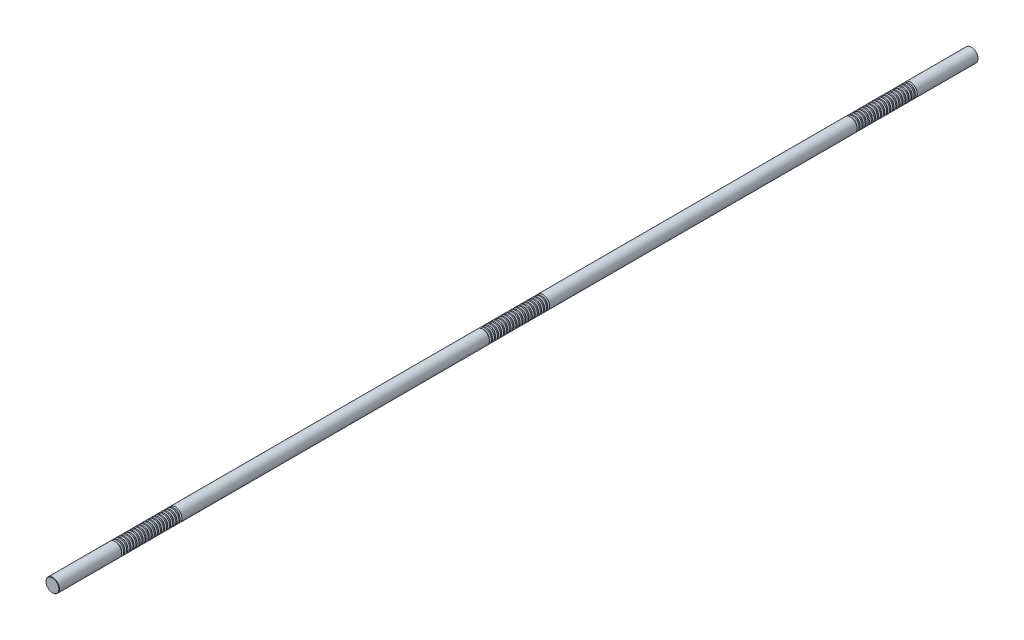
ISO-10303-21;
HEADER;
FILE_DESCRIPTION(('STEP AP214'),'2;1');
FILE_NAME('part.step','',(''),(''),'','','');
FILE_SCHEMA(('AUTOMOTIVE_DESIGN { 1 0 10303 214 1 1 1 1 }'));
ENDSEC;
DATA;
#1=APPLICATION_CONTEXT('core data for automotive mechanical design processes');
#2=APPLICATION_PROTOCOL_DEFINITION('international standard','automotive_design',2000,#1);
#3=PRODUCT_CONTEXT('',#1,'mechanical');
#4=PRODUCT('Part','Part','',(#3));
#5=PRODUCT_RELATED_PRODUCT_CATEGORY('part','',(#4));
#6=PRODUCT_DEFINITION_FORMATION('','',#4);
#7=PRODUCT_DEFINITION_CONTEXT('part definition',#1,'design');
#8=PRODUCT_DEFINITION('design','',#6,#7);
#9=PRODUCT_DEFINITION_SHAPE('','',#8);
#10=(LENGTH_UNIT() NAMED_UNIT(*) SI_UNIT(.MILLI.,.METRE.));
#11=(NAMED_UNIT(*) PLANE_ANGLE_UNIT() SI_UNIT($,.RADIAN.));
#12=(NAMED_UNIT(*) SI_UNIT($,.STERADIAN.) SOLID_ANGLE_UNIT());
#13=UNCERTAINTY_MEASURE_WITH_UNIT(LENGTH_MEASURE(1.E-05),#10,'distance_accuracy_value','');
#14=(GEOMETRIC_REPRESENTATION_CONTEXT(3) GLOBAL_UNCERTAINTY_ASSIGNED_CONTEXT((#13)) GLOBAL_UNIT_ASSIGNED_CONTEXT((#10,
#11,#12)) REPRESENTATION_CONTEXT('',''));
#15=CARTESIAN_POINT('',(0.,0.,0.));
#16=DIRECTION('',(0.,0.,1.));
#17=DIRECTION('',(1.,0.,0.));
#18=AXIS2_PLACEMENT_3D('',#15,#16,#17);
#19=CARTESIAN_POINT('',(0.,0.,750.));
#20=DIRECTION('',(0.,0.,-1.));
#21=DIRECTION('',(-1.,0.,0.));
#22=AXIS2_PLACEMENT_3D('',#19,#20,#21);
#23=CYLINDRICAL_SURFACE('',#22,11.);
#24=CARTESIAN_POINT('',(0.,0.,642.868430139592));
#25=DIRECTION('',(0.,0.,1.));
#26=DIRECTION('',(1.,0.,0.));
#27=AXIS2_PLACEMENT_3D('',#24,#25,#26);
#28=CIRCLE('',#27,11.);
#29=CARTESIAN_POINT('',(11.,0.,642.868430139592));
#30=VERTEX_POINT('',#29);
#31=EDGE_CURVE('E994',#30,#30,#28,.T.);
#32=ORIENTED_EDGE('',*,*,#31,.T.);
#33=EDGE_LOOP('',(#32));
#34=FACE_BOUND('',#33,.T.);
#35=CARTESIAN_POINT('',(0.,0.,644.631569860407));
#36=DIRECTION('',(0.,0.,1.));
#37=DIRECTION('',(1.,0.,0.));
#38=AXIS2_PLACEMENT_3D('',#35,#36,#37);
#39=CIRCLE('',#38,11.);
#40=CARTESIAN_POINT('',(11.,0.,644.631569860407));
#41=VERTEX_POINT('',#40);
#42=EDGE_CURVE('E1005',#41,#41,#39,.T.);
#43=ORIENTED_EDGE('',*,*,#42,.F.);
#44=EDGE_LOOP('',(#43));
#45=FACE_BOUND('',#44,.T.);
#46=ADVANCED_FACE('F37',(#34,#45),#23,.T.);
#47=CARTESIAN_POINT('',(0.,0.,637.868430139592));
#48=DIRECTION('',(0.,0.,1.));
#49=DIRECTION('',(1.,0.,0.));
#50=AXIS2_PLACEMENT_3D('',#47,#48,#49);
#51=CIRCLE('',#50,11.);
#52=CARTESIAN_POINT('',(11.,0.,637.868430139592));
#53=VERTEX_POINT('',#52);
#54=EDGE_CURVE('E978',#53,#53,#51,.T.);
#55=ORIENTED_EDGE('',*,*,#54,.T.);
#56=EDGE_LOOP('',(#55));
#57=FACE_BOUND('',#56,.T.);
#58=CARTESIAN_POINT('',(0.,0.,639.631569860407));
#59=DIRECTION('',(0.,0.,1.));
#60=DIRECTION('',(1.,0.,0.));
#61=AXIS2_PLACEMENT_3D('',#58,#59,#60);
#62=CIRCLE('',#61,11.);
#63=CARTESIAN_POINT('',(11.,0.,639.631569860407));
#64=VERTEX_POINT('',#63);
#65=EDGE_CURVE('E990',#64,#64,#62,.T.);
#66=ORIENTED_EDGE('',*,*,#65,.F.);
#67=EDGE_LOOP('',(#66));
#68=FACE_BOUND('',#67,.T.);
#69=ADVANCED_FACE('F1041',(#57,#68),#23,.T.);
#70=CARTESIAN_POINT('',(0.,0.,632.868430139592));
#71=DIRECTION('',(0.,0.,1.));
#72=DIRECTION('',(1.,0.,0.));
#73=AXIS2_PLACEMENT_3D('',#70,#71,#72);
#74=CIRCLE('',#73,11.);
#75=CARTESIAN_POINT('',(11.,0.,632.868430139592));
#76=VERTEX_POINT('',#75);
#77=EDGE_CURVE('E962',#76,#76,#74,.T.);
#78=ORIENTED_EDGE('',*,*,#77,.T.);
#79=EDGE_LOOP('',(#78));
#80=FACE_BOUND('',#79,.T.);
#81=CARTESIAN_POINT('',(0.,0.,634.631569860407));
#82=DIRECTION('',(0.,0.,1.));
#83=DIRECTION('',(1.,0.,0.));
#84=AXIS2_PLACEMENT_3D('',#81,#82,#83);
#85=CIRCLE('',#84,11.);
#86=CARTESIAN_POINT('',(11.,0.,634.631569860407));
#87=VERTEX_POINT('',#86);
#88=EDGE_CURVE('E974',#87,#87,#85,.T.);
#89=ORIENTED_EDGE('',*,*,#88,.F.);
#90=EDGE_LOOP('',(#89));
#91=FACE_BOUND('',#90,.T.);
#92=ADVANCED_FACE('F1049',(#80,#91),#23,.T.);
#93=CARTESIAN_POINT('',(0.,0.,627.868430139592));
#94=DIRECTION('',(0.,0.,1.));
#95=DIRECTION('',(1.,0.,0.));
#96=AXIS2_PLACEMENT_3D('',#93,#94,#95);
#97=CIRCLE('',#96,11.);
#98=CARTESIAN_POINT('',(11.,0.,627.868430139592));
#99=VERTEX_POINT('',#98);
#100=EDGE_CURVE('E946',#99,#99,#97,.T.);
#101=ORIENTED_EDGE('',*,*,#100,.T.);
#102=EDGE_LOOP('',(#101));
#103=FACE_BOUND('',#102,.T.);
#104=CARTESIAN_POINT('',(0.,0.,629.631569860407));
#105=DIRECTION('',(0.,0.,1.));
#106=DIRECTION('',(1.,0.,0.));
#107=AXIS2_PLACEMENT_3D('',#104,#105,#106);
#108=CIRCLE('',#107,11.);
#109=CARTESIAN_POINT('',(11.,0.,629.631569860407));
#110=VERTEX_POINT('',#109);
#111=EDGE_CURVE('E958',#110,#110,#108,.T.);
#112=ORIENTED_EDGE('',*,*,#111,.F.);
#113=EDGE_LOOP('',(#112));
#114=FACE_BOUND('',#113,.T.);
#115=ADVANCED_FACE('F2332',(#103,#114),#23,.T.);
#116=CARTESIAN_POINT('',(0.,0.,622.868430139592));
#117=DIRECTION('',(0.,0.,1.));
#118=DIRECTION('',(1.,0.,0.));
#119=AXIS2_PLACEMENT_3D('',#116,#117,#118);
#120=CIRCLE('',#119,11.);
#121=CARTESIAN_POINT('',(11.,0.,622.868430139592));
#122=VERTEX_POINT('',#121);
#123=EDGE_CURVE('E930',#122,#122,#120,.T.);
#124=ORIENTED_EDGE('',*,*,#123,.T.);
#125=EDGE_LOOP('',(#124));
#126=FACE_BOUND('',#125,.T.);
#127=CARTESIAN_POINT('',(0.,0.,624.631569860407));
#128=DIRECTION('',(0.,0.,1.));
#129=DIRECTION('',(1.,0.,0.));
#130=AXIS2_PLACEMENT_3D('',#127,#128,#129);
#131=CIRCLE('',#130,11.);
#132=CARTESIAN_POINT('',(11.,0.,624.631569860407));
#133=VERTEX_POINT('',#132);
#134=EDGE_CURVE('E942',#133,#133,#131,.T.);
#135=ORIENTED_EDGE('',*,*,#134,.F.);
#136=EDGE_LOOP('',(#135));
#137=FACE_BOUND('',#136,.T.);
#138=ADVANCED_FACE('F2309',(#126,#137),#23,.T.);
#139=CARTESIAN_POINT('',(0.,0.,617.868430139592));
#140=DIRECTION('',(0.,0.,1.));
#141=DIRECTION('',(1.,0.,0.));
#142=AXIS2_PLACEMENT_3D('',#139,#140,#141);
#143=CIRCLE('',#142,11.);
#144=CARTESIAN_POINT('',(11.,0.,617.868430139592));
#145=VERTEX_POINT('',#144);
#146=EDGE_CURVE('E914',#145,#145,#143,.T.);
#147=ORIENTED_EDGE('',*,*,#146,.T.);
#148=EDGE_LOOP('',(#147));
#149=FACE_BOUND('',#148,.T.);
#150=CARTESIAN_POINT('',(0.,0.,619.631569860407));
#151=DIRECTION('',(0.,0.,1.));
#152=DIRECTION('',(1.,0.,0.));
#153=AXIS2_PLACEMENT_3D('',#150,#151,#152);
#154=CIRCLE('',#153,11.);
#155=CARTESIAN_POINT('',(11.,0.,619.631569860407));
#156=VERTEX_POINT('',#155);
#157=EDGE_CURVE('E926',#156,#156,#154,.T.);
#158=ORIENTED_EDGE('',*,*,#157,.F.);
#159=EDGE_LOOP('',(#158));
#160=FACE_BOUND('',#159,.T.);
#161=ADVANCED_FACE('F2286',(#149,#160),#23,.T.);
#162=CARTESIAN_POINT('',(0.,0.,612.868430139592));
#163=DIRECTION('',(0.,0.,1.));
#164=DIRECTION('',(1.,0.,0.));
#165=AXIS2_PLACEMENT_3D('',#162,#163,#164);
#166=CIRCLE('',#165,11.);
#167=CARTESIAN_POINT('',(11.,0.,612.868430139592));
#168=VERTEX_POINT('',#167);
#169=EDGE_CURVE('E899',#168,#168,#166,.T.);
#170=ORIENTED_EDGE('',*,*,#169,.T.);
#171=EDGE_LOOP('',(#170));
#172=FACE_BOUND('',#171,.T.);
#173=CARTESIAN_POINT('',(0.,0.,614.631569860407));
#174=DIRECTION('',(0.,0.,1.));
#175=DIRECTION('',(1.,0.,0.));
#176=AXIS2_PLACEMENT_3D('',#173,#174,#175);
#177=CIRCLE('',#176,11.);
#178=CARTESIAN_POINT('',(11.,0.,614.631569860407));
#179=VERTEX_POINT('',#178);
#180=EDGE_CURVE('E911',#179,#179,#177,.T.);
#181=ORIENTED_EDGE('',*,*,#180,.F.);
#182=EDGE_LOOP('',(#181));
#183=FACE_BOUND('',#182,.T.);
#184=ADVANCED_FACE('F2263',(#172,#183),#23,.T.);
#185=CARTESIAN_POINT('',(0.,0.,607.868430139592));
#186=DIRECTION('',(0.,0.,1.));
#187=DIRECTION('',(1.,0.,0.));
#188=AXIS2_PLACEMENT_3D('',#185,#186,#187);
#189=CIRCLE('',#188,11.);
#190=CARTESIAN_POINT('',(11.,0.,607.868430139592));
#191=VERTEX_POINT('',#190);
#192=EDGE_CURVE('E883',#191,#191,#189,.T.);
#193=ORIENTED_EDGE('',*,*,#192,.T.);
#194=EDGE_LOOP('',(#193));
#195=FACE_BOUND('',#194,.T.);
#196=CARTESIAN_POINT('',(0.,0.,609.631569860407));
#197=DIRECTION('',(0.,0.,1.));
#198=DIRECTION('',(1.,0.,0.));
#199=AXIS2_PLACEMENT_3D('',#196,#197,#198);
#200=CIRCLE('',#199,11.);
#201=CARTESIAN_POINT('',(11.,0.,609.631569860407));
#202=VERTEX_POINT('',#201);
#203=EDGE_CURVE('E895',#202,#202,#200,.T.);
#204=ORIENTED_EDGE('',*,*,#203,.F.);
#205=EDGE_LOOP('',(#204));
#206=FACE_BOUND('',#205,.T.);
#207=ADVANCED_FACE('F2240',(#195,#206),#23,.T.);
#208=CARTESIAN_POINT('',(0.,0.,602.868430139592));
#209=DIRECTION('',(0.,0.,1.));
#210=DIRECTION('',(1.,0.,0.));
#211=AXIS2_PLACEMENT_3D('',#208,#209,#210);
#212=CIRCLE('',#211,11.);
#213=CARTESIAN_POINT('',(11.,0.,602.868430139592));
#214=VERTEX_POINT('',#213);
#215=EDGE_CURVE('E867',#214,#214,#212,.T.);
#216=ORIENTED_EDGE('',*,*,#215,.T.);
#217=EDGE_LOOP('',(#216));
#218=FACE_BOUND('',#217,.T.);
#219=CARTESIAN_POINT('',(0.,0.,604.631569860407));
#220=DIRECTION('',(0.,0.,1.));
#221=DIRECTION('',(1.,0.,0.));
#222=AXIS2_PLACEMENT_3D('',#219,#220,#221);
#223=CIRCLE('',#222,11.);
#224=CARTESIAN_POINT('',(11.,0.,604.631569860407));
#225=VERTEX_POINT('',#224);
#226=EDGE_CURVE('E879',#225,#225,#223,.T.);
#227=ORIENTED_EDGE('',*,*,#226,.F.);
#228=EDGE_LOOP('',(#227));
#229=FACE_BOUND('',#228,.T.);
#230=ADVANCED_FACE('F2217',(#218,#229),#23,.T.);
#231=CARTESIAN_POINT('',(0.,0.,597.868430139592));
#232=DIRECTION('',(0.,0.,1.));
#233=DIRECTION('',(1.,0.,0.));
#234=AXIS2_PLACEMENT_3D('',#231,#232,#233);
#235=CIRCLE('',#234,11.);
#236=CARTESIAN_POINT('',(11.,0.,597.868430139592));
#237=VERTEX_POINT('',#236);
#238=EDGE_CURVE('E851',#237,#237,#235,.T.);
#239=ORIENTED_EDGE('',*,*,#238,.T.);
#240=EDGE_LOOP('',(#239));
#241=FACE_BOUND('',#240,.T.);
#242=CARTESIAN_POINT('',(0.,0.,599.631569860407));
#243=DIRECTION('',(0.,0.,1.));
#244=DIRECTION('',(1.,0.,0.));
#245=AXIS2_PLACEMENT_3D('',#242,#243,#244);
#246=CIRCLE('',#245,11.);
#247=CARTESIAN_POINT('',(11.,0.,599.631569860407));
#248=VERTEX_POINT('',#247);
#249=EDGE_CURVE('E863',#248,#248,#246,.T.);
#250=ORIENTED_EDGE('',*,*,#249,.F.);
#251=EDGE_LOOP('',(#250));
#252=FACE_BOUND('',#251,.T.);
#253=ADVANCED_FACE('F2194',(#241,#252),#23,.T.);
#254=CARTESIAN_POINT('',(0.,0.,592.868430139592));
#255=DIRECTION('',(0.,0.,1.));
#256=DIRECTION('',(1.,0.,0.));
#257=AXIS2_PLACEMENT_3D('',#254,#255,#256);
#258=CIRCLE('',#257,11.);
#259=CARTESIAN_POINT('',(11.,0.,592.868430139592));
#260=VERTEX_POINT('',#259);
#261=EDGE_CURVE('E835',#260,#260,#258,.T.);
#262=ORIENTED_EDGE('',*,*,#261,.T.);
#263=EDGE_LOOP('',(#262));
#264=FACE_BOUND('',#263,.T.);
#265=CARTESIAN_POINT('',(0.,0.,594.631569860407));
#266=DIRECTION('',(0.,0.,1.));
#267=DIRECTION('',(1.,0.,0.));
#268=AXIS2_PLACEMENT_3D('',#265,#266,#267);
#269=CIRCLE('',#268,11.);
#270=CARTESIAN_POINT('',(11.,0.,594.631569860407));
#271=VERTEX_POINT('',#270);
#272=EDGE_CURVE('E847',#271,#271,#269,.T.);
#273=ORIENTED_EDGE('',*,*,#272,.F.);
#274=EDGE_LOOP('',(#273));
#275=FACE_BOUND('',#274,.T.);
#276=ADVANCED_FACE('F2171',(#264,#275),#23,.T.);
#277=CARTESIAN_POINT('',(0.,0.,587.868430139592));
#278=DIRECTION('',(0.,0.,1.));
#279=DIRECTION('',(1.,0.,0.));
#280=AXIS2_PLACEMENT_3D('',#277,#278,#279);
#281=CIRCLE('',#280,11.);
#282=CARTESIAN_POINT('',(11.,0.,587.868430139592));
#283=VERTEX_POINT('',#282);
#284=EDGE_CURVE('E819',#283,#283,#281,.T.);
#285=ORIENTED_EDGE('',*,*,#284,.T.);
#286=EDGE_LOOP('',(#285));
#287=FACE_BOUND('',#286,.T.);
#288=CARTESIAN_POINT('',(0.,0.,589.631569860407));
#289=DIRECTION('',(0.,0.,1.));
#290=DIRECTION('',(1.,0.,0.));
#291=AXIS2_PLACEMENT_3D('',#288,#289,#290);
#292=CIRCLE('',#291,11.);
#293=CARTESIAN_POINT('',(11.,0.,589.631569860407));
#294=VERTEX_POINT('',#293);
#295=EDGE_CURVE('E831',#294,#294,#292,.T.);
#296=ORIENTED_EDGE('',*,*,#295,.F.);
#297=EDGE_LOOP('',(#296));
#298=FACE_BOUND('',#297,.T.);
#299=ADVANCED_FACE('F2148',(#287,#298),#23,.T.);
#300=CARTESIAN_POINT('',(0.,0.,582.868430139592));
#301=DIRECTION('',(0.,0.,1.));
#302=DIRECTION('',(1.,0.,0.));
#303=AXIS2_PLACEMENT_3D('',#300,#301,#302);
#304=CIRCLE('',#303,11.);
#305=CARTESIAN_POINT('',(11.,0.,582.868430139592));
#306=VERTEX_POINT('',#305);
#307=EDGE_CURVE('E803',#306,#306,#304,.T.);
#308=ORIENTED_EDGE('',*,*,#307,.T.);
#309=EDGE_LOOP('',(#308));
#310=FACE_BOUND('',#309,.T.);
#311=CARTESIAN_POINT('',(0.,0.,584.631569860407));
#312=DIRECTION('',(0.,0.,1.));
#313=DIRECTION('',(1.,0.,0.));
#314=AXIS2_PLACEMENT_3D('',#311,#312,#313);
#315=CIRCLE('',#314,11.);
#316=CARTESIAN_POINT('',(11.,0.,584.631569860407));
#317=VERTEX_POINT('',#316);
#318=EDGE_CURVE('E815',#317,#317,#315,.T.);
#319=ORIENTED_EDGE('',*,*,#318,.F.);
#320=EDGE_LOOP('',(#319));
#321=FACE_BOUND('',#320,.T.);
#322=ADVANCED_FACE('F2125',(#310,#321),#23,.T.);
#323=CARTESIAN_POINT('',(0.,0.,577.868430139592));
#324=DIRECTION('',(0.,0.,1.));
#325=DIRECTION('',(1.,0.,0.));
#326=AXIS2_PLACEMENT_3D('',#323,#324,#325);
#327=CIRCLE('',#326,11.);
#328=CARTESIAN_POINT('',(11.,0.,577.868430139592));
#329=VERTEX_POINT('',#328);
#330=EDGE_CURVE('E787',#329,#329,#327,.T.);
#331=ORIENTED_EDGE('',*,*,#330,.T.);
#332=EDGE_LOOP('',(#331));
#333=FACE_BOUND('',#332,.T.);
#334=CARTESIAN_POINT('',(0.,0.,579.631569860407));
#335=DIRECTION('',(0.,0.,1.));
#336=DIRECTION('',(1.,0.,0.));
#337=AXIS2_PLACEMENT_3D('',#334,#335,#336);
#338=CIRCLE('',#337,11.);
#339=CARTESIAN_POINT('',(11.,0.,579.631569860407));
#340=VERTEX_POINT('',#339);
#341=EDGE_CURVE('E799',#340,#340,#338,.T.);
#342=ORIENTED_EDGE('',*,*,#341,.F.);
#343=EDGE_LOOP('',(#342));
#344=FACE_BOUND('',#343,.T.);
#345=ADVANCED_FACE('F2102',(#333,#344),#23,.T.);
#346=CARTESIAN_POINT('',(0.,0.,572.868430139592));
#347=DIRECTION('',(0.,0.,1.));
#348=DIRECTION('',(1.,0.,0.));
#349=AXIS2_PLACEMENT_3D('',#346,#347,#348);
#350=CIRCLE('',#349,11.);
#351=CARTESIAN_POINT('',(11.,0.,572.868430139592));
#352=VERTEX_POINT('',#351);
#353=EDGE_CURVE('E771',#352,#352,#350,.T.);
#354=ORIENTED_EDGE('',*,*,#353,.T.);
#355=EDGE_LOOP('',(#354));
#356=FACE_BOUND('',#355,.T.);
#357=CARTESIAN_POINT('',(0.,0.,574.631569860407));
#358=DIRECTION('',(0.,0.,1.));
#359=DIRECTION('',(1.,0.,0.));
#360=AXIS2_PLACEMENT_3D('',#357,#358,#359);
#361=CIRCLE('',#360,11.);
#362=CARTESIAN_POINT('',(11.,0.,574.631569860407));
#363=VERTEX_POINT('',#362);
#364=EDGE_CURVE('E783',#363,#363,#361,.T.);
#365=ORIENTED_EDGE('',*,*,#364,.F.);
#366=EDGE_LOOP('',(#365));
#367=FACE_BOUND('',#366,.T.);
#368=ADVANCED_FACE('F2079',(#356,#367),#23,.T.);
#369=CARTESIAN_POINT('',(0.,0.,567.868430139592));
#370=DIRECTION('',(0.,0.,1.));
#371=DIRECTION('',(1.,0.,0.));
#372=AXIS2_PLACEMENT_3D('',#369,#370,#371);
#373=CIRCLE('',#372,11.);
#374=CARTESIAN_POINT('',(11.,0.,567.868430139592));
#375=VERTEX_POINT('',#374);
#376=EDGE_CURVE('E755',#375,#375,#373,.T.);
#377=ORIENTED_EDGE('',*,*,#376,.T.);
#378=EDGE_LOOP('',(#377));
#379=FACE_BOUND('',#378,.T.);
#380=CARTESIAN_POINT('',(0.,0.,569.631569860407));
#381=DIRECTION('',(0.,0.,1.));
#382=DIRECTION('',(1.,0.,0.));
#383=AXIS2_PLACEMENT_3D('',#380,#381,#382);
#384=CIRCLE('',#383,11.);
#385=CARTESIAN_POINT('',(11.,0.,569.631569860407));
#386=VERTEX_POINT('',#385);
#387=EDGE_CURVE('E767',#386,#386,#384,.T.);
#388=ORIENTED_EDGE('',*,*,#387,.F.);
#389=EDGE_LOOP('',(#388));
#390=FACE_BOUND('',#389,.T.);
#391=ADVANCED_FACE('F2056',(#379,#390),#23,.T.);
#392=CARTESIAN_POINT('',(0.,0.,562.868430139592));
#393=DIRECTION('',(0.,0.,1.));
#394=DIRECTION('',(1.,0.,0.));
#395=AXIS2_PLACEMENT_3D('',#392,#393,#394);
#396=CIRCLE('',#395,11.);
#397=CARTESIAN_POINT('',(11.,0.,562.868430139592));
#398=VERTEX_POINT('',#397);
#399=EDGE_CURVE('E739',#398,#398,#396,.T.);
#400=ORIENTED_EDGE('',*,*,#399,.T.);
#401=EDGE_LOOP('',(#400));
#402=FACE_BOUND('',#401,.T.);
#403=CARTESIAN_POINT('',(0.,0.,564.631569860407));
#404=DIRECTION('',(0.,0.,1.));
#405=DIRECTION('',(1.,0.,0.));
#406=AXIS2_PLACEMENT_3D('',#403,#404,#405);
#407=CIRCLE('',#406,11.);
#408=CARTESIAN_POINT('',(11.,0.,564.631569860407));
#409=VERTEX_POINT('',#408);
#410=EDGE_CURVE('E751',#409,#409,#407,.T.);
#411=ORIENTED_EDGE('',*,*,#410,.F.);
#412=EDGE_LOOP('',(#411));
#413=FACE_BOUND('',#412,.T.);
#414=ADVANCED_FACE('F2033',(#402,#413),#23,.T.);
#415=CARTESIAN_POINT('',(0.,0.,557.868430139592));
#416=DIRECTION('',(0.,0.,1.));
#417=DIRECTION('',(1.,0.,0.));
#418=AXIS2_PLACEMENT_3D('',#415,#416,#417);
#419=CIRCLE('',#418,11.);
#420=CARTESIAN_POINT('',(11.,0.,557.868430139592));
#421=VERTEX_POINT('',#420);
#422=EDGE_CURVE('E723',#421,#421,#419,.T.);
#423=ORIENTED_EDGE('',*,*,#422,.T.);
#424=EDGE_LOOP('',(#423));
#425=FACE_BOUND('',#424,.T.);
#426=CARTESIAN_POINT('',(0.,0.,559.631569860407));
#427=DIRECTION('',(0.,0.,1.));
#428=DIRECTION('',(1.,0.,0.));
#429=AXIS2_PLACEMENT_3D('',#426,#427,#428);
#430=CIRCLE('',#429,11.);
#431=CARTESIAN_POINT('',(11.,0.,559.631569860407));
#432=VERTEX_POINT('',#431);
#433=EDGE_CURVE('E735',#432,#432,#430,.T.);
#434=ORIENTED_EDGE('',*,*,#433,.F.);
#435=EDGE_LOOP('',(#434));
#436=FACE_BOUND('',#435,.T.);
#437=ADVANCED_FACE('F2014',(#425,#436),#23,.T.);
#438=CARTESIAN_POINT('',(0.,0.,552.868430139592));
#439=DIRECTION('',(0.,0.,1.));
#440=DIRECTION('',(1.,0.,0.));
#441=AXIS2_PLACEMENT_3D('',#438,#439,#440);
#442=CIRCLE('',#441,11.);
#443=CARTESIAN_POINT('',(11.,0.,552.868430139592));
#444=VERTEX_POINT('',#443);
#445=EDGE_CURVE('E403',#444,#444,#442,.T.);
#446=ORIENTED_EDGE('',*,*,#445,.T.);
#447=EDGE_LOOP('',(#446));
#448=FACE_BOUND('',#447,.T.);
#449=CARTESIAN_POINT('',(0.,0.,554.631569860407));
#450=DIRECTION('',(0.,0.,1.));
#451=DIRECTION('',(1.,0.,0.));
#452=AXIS2_PLACEMENT_3D('',#449,#450,#451);
#453=CIRCLE('',#452,11.);
#454=CARTESIAN_POINT('',(11.,0.,554.631569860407));
#455=VERTEX_POINT('',#454);
#456=EDGE_CURVE('E719',#455,#455,#453,.T.);
#457=ORIENTED_EDGE('',*,*,#456,.F.);
#458=EDGE_LOOP('',(#457));
#459=FACE_BOUND('',#458,.T.);
#460=ADVANCED_FACE('F1963',(#448,#459),#23,.T.);
#461=CARTESIAN_POINT('',(0.,0.,42.8684301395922));
#462=DIRECTION('',(0.,0.,1.));
#463=DIRECTION('',(1.,0.,0.));
#464=AXIS2_PLACEMENT_3D('',#461,#462,#463);
#465=CIRCLE('',#464,11.);
#466=CARTESIAN_POINT('',(11.,0.,42.8684301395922));
#467=VERTEX_POINT('',#466);
#468=EDGE_CURVE('E691',#467,#467,#465,.T.);
#469=ORIENTED_EDGE('',*,*,#468,.T.);
#470=EDGE_LOOP('',(#469));
#471=FACE_BOUND('',#470,.T.);
#472=CARTESIAN_POINT('',(0.,0.,44.6315698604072));
#473=DIRECTION('',(0.,0.,1.));
#474=DIRECTION('',(1.,0.,0.));
#475=AXIS2_PLACEMENT_3D('',#472,#473,#474);
#476=CIRCLE('',#475,11.);
#477=CARTESIAN_POINT('',(11.,0.,44.6315698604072));
#478=VERTEX_POINT('',#477);
#479=EDGE_CURVE('E703',#478,#478,#476,.T.);
#480=ORIENTED_EDGE('',*,*,#479,.F.);
#481=EDGE_LOOP('',(#480));
#482=FACE_BOUND('',#481,.T.);
#483=ADVANCED_FACE('F1939',(#471,#482),#23,.T.);
#484=CARTESIAN_POINT('',(0.,0.,37.8684301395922));
#485=DIRECTION('',(0.,0.,1.));
#486=DIRECTION('',(1.,0.,0.));
#487=AXIS2_PLACEMENT_3D('',#484,#485,#486);
#488=CIRCLE('',#487,11.);
#489=CARTESIAN_POINT('',(11.,0.,37.8684301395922));
#490=VERTEX_POINT('',#489);
#491=EDGE_CURVE('E675',#490,#490,#488,.T.);
#492=ORIENTED_EDGE('',*,*,#491,.T.);
#493=EDGE_LOOP('',(#492));
#494=FACE_BOUND('',#493,.T.);
#495=CARTESIAN_POINT('',(0.,0.,39.6315698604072));
#496=DIRECTION('',(0.,0.,1.));
#497=DIRECTION('',(1.,0.,0.));
#498=AXIS2_PLACEMENT_3D('',#495,#496,#497);
#499=CIRCLE('',#498,11.);
#500=CARTESIAN_POINT('',(11.,0.,39.6315698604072));
#501=VERTEX_POINT('',#500);
#502=EDGE_CURVE('E687',#501,#501,#499,.T.);
#503=ORIENTED_EDGE('',*,*,#502,.F.);
#504=EDGE_LOOP('',(#503));
#505=FACE_BOUND('',#504,.T.);
#506=ADVANCED_FACE('F1916',(#494,#505),#23,.T.);
#507=CARTESIAN_POINT('',(0.,0.,32.8684301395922));
#508=DIRECTION('',(0.,0.,1.));
#509=DIRECTION('',(1.,0.,0.));
#510=AXIS2_PLACEMENT_3D('',#507,#508,#509);
#511=CIRCLE('',#510,11.);
#512=CARTESIAN_POINT('',(11.,0.,32.8684301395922));
#513=VERTEX_POINT('',#512);
#514=EDGE_CURVE('E659',#513,#513,#511,.T.);
#515=ORIENTED_EDGE('',*,*,#514,.T.);
#516=EDGE_LOOP('',(#515));
#517=FACE_BOUND('',#516,.T.);
#518=CARTESIAN_POINT('',(0.,0.,34.6315698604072));
#519=DIRECTION('',(0.,0.,1.));
#520=DIRECTION('',(1.,0.,0.));
#521=AXIS2_PLACEMENT_3D('',#518,#519,#520);
#522=CIRCLE('',#521,11.);
#523=CARTESIAN_POINT('',(11.,0.,34.6315698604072));
#524=VERTEX_POINT('',#523);
#525=EDGE_CURVE('E671',#524,#524,#522,.T.);
#526=ORIENTED_EDGE('',*,*,#525,.F.);
#527=EDGE_LOOP('',(#526));
#528=FACE_BOUND('',#527,.T.);
#529=ADVANCED_FACE('F1893',(#517,#528),#23,.T.);
#530=CARTESIAN_POINT('',(0.,0.,27.8684301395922));
#531=DIRECTION('',(0.,0.,1.));
#532=DIRECTION('',(1.,0.,0.));
#533=AXIS2_PLACEMENT_3D('',#530,#531,#532);
#534=CIRCLE('',#533,11.);
#535=CARTESIAN_POINT('',(11.,0.,27.8684301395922));
#536=VERTEX_POINT('',#535);
#537=EDGE_CURVE('E643',#536,#536,#534,.T.);
#538=ORIENTED_EDGE('',*,*,#537,.T.);
#539=EDGE_LOOP('',(#538));
#540=FACE_BOUND('',#539,.T.);
#541=CARTESIAN_POINT('',(0.,0.,29.6315698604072));
#542=DIRECTION('',(0.,0.,1.));
#543=DIRECTION('',(1.,0.,0.));
#544=AXIS2_PLACEMENT_3D('',#541,#542,#543);
#545=CIRCLE('',#544,11.);
#546=CARTESIAN_POINT('',(11.,0.,29.6315698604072));
#547=VERTEX_POINT('',#546);
#548=EDGE_CURVE('E655',#547,#547,#545,.T.);
#549=ORIENTED_EDGE('',*,*,#548,.F.);
#550=EDGE_LOOP('',(#549));
#551=FACE_BOUND('',#550,.T.);
#552=ADVANCED_FACE('F1870',(#540,#551),#23,.T.);
#553=CARTESIAN_POINT('',(0.,0.,22.8684301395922));
#554=DIRECTION('',(0.,0.,1.));
#555=DIRECTION('',(1.,0.,0.));
#556=AXIS2_PLACEMENT_3D('',#553,#554,#555);
#557=CIRCLE('',#556,11.);
#558=CARTESIAN_POINT('',(11.,0.,22.8684301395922));
#559=VERTEX_POINT('',#558);
#560=EDGE_CURVE('E627',#559,#559,#557,.T.);
#561=ORIENTED_EDGE('',*,*,#560,.T.);
#562=EDGE_LOOP('',(#561));
#563=FACE_BOUND('',#562,.T.);
#564=CARTESIAN_POINT('',(0.,0.,24.6315698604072));
#565=DIRECTION('',(0.,0.,1.));
#566=DIRECTION('',(1.,0.,0.));
#567=AXIS2_PLACEMENT_3D('',#564,#565,#566);
#568=CIRCLE('',#567,11.);
#569=CARTESIAN_POINT('',(11.,0.,24.6315698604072));
#570=VERTEX_POINT('',#569);
#571=EDGE_CURVE('E639',#570,#570,#568,.T.);
#572=ORIENTED_EDGE('',*,*,#571,.F.);
#573=EDGE_LOOP('',(#572));
#574=FACE_BOUND('',#573,.T.);
#575=ADVANCED_FACE('F1847',(#563,#574),#23,.T.);
#576=CARTESIAN_POINT('',(0.,0.,17.8684301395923));
#577=DIRECTION('',(0.,0.,1.));
#578=DIRECTION('',(1.,0.,0.));
#579=AXIS2_PLACEMENT_3D('',#576,#577,#578);
#580=CIRCLE('',#579,11.);
#581=CARTESIAN_POINT('',(11.,0.,17.8684301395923));
#582=VERTEX_POINT('',#581);
#583=EDGE_CURVE('E611',#582,#582,#580,.T.);
#584=ORIENTED_EDGE('',*,*,#583,.T.);
#585=EDGE_LOOP('',(#584));
#586=FACE_BOUND('',#585,.T.);
#587=CARTESIAN_POINT('',(0.,0.,19.6315698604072));
#588=DIRECTION('',(0.,0.,1.));
#589=DIRECTION('',(1.,0.,0.));
#590=AXIS2_PLACEMENT_3D('',#587,#588,#589);
#591=CIRCLE('',#590,11.);
#592=CARTESIAN_POINT('',(11.,0.,19.6315698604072));
#593=VERTEX_POINT('',#592);
#594=EDGE_CURVE('E623',#593,#593,#591,.T.);
#595=ORIENTED_EDGE('',*,*,#594,.F.);
#596=EDGE_LOOP('',(#595));
#597=FACE_BOUND('',#596,.T.);
#598=ADVANCED_FACE('F1824',(#586,#597),#23,.T.);
#599=CARTESIAN_POINT('',(0.,0.,12.8684301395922));
#600=DIRECTION('',(0.,0.,1.));
#601=DIRECTION('',(1.,0.,0.));
#602=AXIS2_PLACEMENT_3D('',#599,#600,#601);
#603=CIRCLE('',#602,11.);
#604=CARTESIAN_POINT('',(11.,0.,12.8684301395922));
#605=VERTEX_POINT('',#604);
#606=EDGE_CURVE('E595',#605,#605,#603,.T.);
#607=ORIENTED_EDGE('',*,*,#606,.T.);
#608=EDGE_LOOP('',(#607));
#609=FACE_BOUND('',#608,.T.);
#610=CARTESIAN_POINT('',(0.,0.,14.6315698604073));
#611=DIRECTION('',(0.,0.,1.));
#612=DIRECTION('',(1.,0.,0.));
#613=AXIS2_PLACEMENT_3D('',#610,#611,#612);
#614=CIRCLE('',#613,11.);
#615=CARTESIAN_POINT('',(11.,0.,14.6315698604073));
#616=VERTEX_POINT('',#615);
#617=EDGE_CURVE('E607',#616,#616,#614,.T.);
#618=ORIENTED_EDGE('',*,*,#617,.F.);
#619=EDGE_LOOP('',(#618));
#620=FACE_BOUND('',#619,.T.);
#621=ADVANCED_FACE('F1801',(#609,#620),#23,.T.);
#622=CARTESIAN_POINT('',(0.,0.,7.86843013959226));
#623=DIRECTION('',(0.,0.,1.));
#624=DIRECTION('',(1.,0.,0.));
#625=AXIS2_PLACEMENT_3D('',#622,#623,#624);
#626=CIRCLE('',#625,11.);
#627=CARTESIAN_POINT('',(11.,0.,7.86843013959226));
#628=VERTEX_POINT('',#627);
#629=EDGE_CURVE('E579',#628,#628,#626,.T.);
#630=ORIENTED_EDGE('',*,*,#629,.T.);
#631=EDGE_LOOP('',(#630));
#632=FACE_BOUND('',#631,.T.);
#633=CARTESIAN_POINT('',(0.,0.,9.63156986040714));
#634=DIRECTION('',(0.,0.,1.));
#635=DIRECTION('',(1.,0.,0.));
#636=AXIS2_PLACEMENT_3D('',#633,#634,#635);
#637=CIRCLE('',#636,11.);
#638=CARTESIAN_POINT('',(11.,0.,9.63156986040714));
#639=VERTEX_POINT('',#638);
#640=EDGE_CURVE('E591',#639,#639,#637,.T.);
#641=ORIENTED_EDGE('',*,*,#640,.F.);
#642=EDGE_LOOP('',(#641));
#643=FACE_BOUND('',#642,.T.);
#644=ADVANCED_FACE('F1778',(#632,#643),#23,.T.);
#645=CARTESIAN_POINT('',(0.,0.,2.86843013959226));
#646=DIRECTION('',(0.,0.,1.));
#647=DIRECTION('',(1.,0.,0.));
#648=AXIS2_PLACEMENT_3D('',#645,#646,#647);
#649=CIRCLE('',#648,11.);
#650=CARTESIAN_POINT('',(11.,0.,2.86843013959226));
#651=VERTEX_POINT('',#650);
#652=EDGE_CURVE('E563',#651,#651,#649,.T.);
#653=ORIENTED_EDGE('',*,*,#652,.T.);
#654=EDGE_LOOP('',(#653));
#655=FACE_BOUND('',#654,.T.);
#656=CARTESIAN_POINT('',(0.,0.,4.63156986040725));
#657=DIRECTION('',(0.,0.,1.));
#658=DIRECTION('',(1.,0.,0.));
#659=AXIS2_PLACEMENT_3D('',#656,#657,#658);
#660=CIRCLE('',#659,11.);
#661=CARTESIAN_POINT('',(11.,0.,4.63156986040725));
#662=VERTEX_POINT('',#661);
#663=EDGE_CURVE('E575',#662,#662,#660,.T.);
#664=ORIENTED_EDGE('',*,*,#663,.F.);
#665=EDGE_LOOP('',(#664));
#666=FACE_BOUND('',#665,.T.);
#667=ADVANCED_FACE('F1755',(#655,#666),#23,.T.);
#668=CARTESIAN_POINT('',(0.,0.,-2.13156986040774));
#669=DIRECTION('',(0.,0.,1.));
#670=DIRECTION('',(1.,0.,0.));
#671=AXIS2_PLACEMENT_3D('',#668,#669,#670);
#672=CIRCLE('',#671,11.);
#673=CARTESIAN_POINT('',(11.,0.,-2.13156986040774));
#674=VERTEX_POINT('',#673);
#675=EDGE_CURVE('E547',#674,#674,#672,.T.);
#676=ORIENTED_EDGE('',*,*,#675,.T.);
#677=EDGE_LOOP('',(#676));
#678=FACE_BOUND('',#677,.T.);
#679=CARTESIAN_POINT('',(0.,0.,-0.368430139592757));
#680=DIRECTION('',(0.,0.,1.));
#681=DIRECTION('',(1.,0.,0.));
#682=AXIS2_PLACEMENT_3D('',#679,#680,#681);
#683=CIRCLE('',#682,11.);
#684=CARTESIAN_POINT('',(11.,0.,-0.368430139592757));
#685=VERTEX_POINT('',#684);
#686=EDGE_CURVE('E559',#685,#685,#683,.T.);
#687=ORIENTED_EDGE('',*,*,#686,.F.);
#688=EDGE_LOOP('',(#687));
#689=FACE_BOUND('',#688,.T.);
#690=ADVANCED_FACE('F1732',(#678,#689),#23,.T.);
#691=CARTESIAN_POINT('',(0.,0.,-7.13156986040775));
#692=DIRECTION('',(0.,0.,1.));
#693=DIRECTION('',(1.,0.,0.));
#694=AXIS2_PLACEMENT_3D('',#691,#692,#693);
#695=CIRCLE('',#694,11.);
#696=CARTESIAN_POINT('',(11.,0.,-7.13156986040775));
#697=VERTEX_POINT('',#696);
#698=EDGE_CURVE('E531',#697,#697,#695,.T.);
#699=ORIENTED_EDGE('',*,*,#698,.T.);
#700=EDGE_LOOP('',(#699));
#701=FACE_BOUND('',#700,.T.);
#702=CARTESIAN_POINT('',(0.,0.,-5.36843013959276));
#703=DIRECTION('',(0.,0.,1.));
#704=DIRECTION('',(1.,0.,0.));
#705=AXIS2_PLACEMENT_3D('',#702,#703,#704);
#706=CIRCLE('',#705,11.);
#707=CARTESIAN_POINT('',(11.,0.,-5.36843013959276));
#708=VERTEX_POINT('',#707);
#709=EDGE_CURVE('E543',#708,#708,#706,.T.);
#710=ORIENTED_EDGE('',*,*,#709,.F.);
#711=EDGE_LOOP('',(#710));
#712=FACE_BOUND('',#711,.T.);
#713=ADVANCED_FACE('F1709',(#701,#712),#23,.T.);
#714=CARTESIAN_POINT('',(0.,0.,-12.1315698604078));
#715=DIRECTION('',(0.,0.,1.));
#716=DIRECTION('',(1.,0.,0.));
#717=AXIS2_PLACEMENT_3D('',#714,#715,#716);
#718=CIRCLE('',#717,11.);
#719=CARTESIAN_POINT('',(11.,0.,-12.1315698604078));
#720=VERTEX_POINT('',#719);
#721=EDGE_CURVE('E515',#720,#720,#718,.T.);
#722=ORIENTED_EDGE('',*,*,#721,.T.);
#723=EDGE_LOOP('',(#722));
#724=FACE_BOUND('',#723,.T.);
#725=CARTESIAN_POINT('',(0.,0.,-10.3684301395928));
#726=DIRECTION('',(0.,0.,1.));
#727=DIRECTION('',(1.,0.,0.));
#728=AXIS2_PLACEMENT_3D('',#725,#726,#727);
#729=CIRCLE('',#728,11.);
#730=CARTESIAN_POINT('',(11.,0.,-10.3684301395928));
#731=VERTEX_POINT('',#730);
#732=EDGE_CURVE('E527',#731,#731,#729,.T.);
#733=ORIENTED_EDGE('',*,*,#732,.F.);
#734=EDGE_LOOP('',(#733));
#735=FACE_BOUND('',#734,.T.);
#736=ADVANCED_FACE('F1686',(#724,#735),#23,.T.);
#737=CARTESIAN_POINT('',(0.,0.,-17.1315698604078));
#738=DIRECTION('',(0.,0.,1.));
#739=DIRECTION('',(1.,0.,0.));
#740=AXIS2_PLACEMENT_3D('',#737,#738,#739);
#741=CIRCLE('',#740,11.);
#742=CARTESIAN_POINT('',(11.,0.,-17.1315698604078));
#743=VERTEX_POINT('',#742);
#744=EDGE_CURVE('E499',#743,#743,#741,.T.);
#745=ORIENTED_EDGE('',*,*,#744,.T.);
#746=EDGE_LOOP('',(#745));
#747=FACE_BOUND('',#746,.T.);
#748=CARTESIAN_POINT('',(0.,0.,-15.3684301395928));
#749=DIRECTION('',(0.,0.,1.));
#750=DIRECTION('',(1.,0.,0.));
#751=AXIS2_PLACEMENT_3D('',#748,#749,#750);
#752=CIRCLE('',#751,11.);
#753=CARTESIAN_POINT('',(11.,0.,-15.3684301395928));
#754=VERTEX_POINT('',#753);
#755=EDGE_CURVE('E511',#754,#754,#752,.T.);
#756=ORIENTED_EDGE('',*,*,#755,.F.);
#757=EDGE_LOOP('',(#756));
#758=FACE_BOUND('',#757,.T.);
#759=ADVANCED_FACE('F1663',(#747,#758),#23,.T.);
#760=CARTESIAN_POINT('',(0.,0.,-22.1315698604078));
#761=DIRECTION('',(0.,0.,1.));
#762=DIRECTION('',(1.,0.,0.));
#763=AXIS2_PLACEMENT_3D('',#760,#761,#762);
#764=CIRCLE('',#763,11.);
#765=CARTESIAN_POINT('',(11.,0.,-22.1315698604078));
#766=VERTEX_POINT('',#765);
#767=EDGE_CURVE('E483',#766,#766,#764,.T.);
#768=ORIENTED_EDGE('',*,*,#767,.T.);
#769=EDGE_LOOP('',(#768));
#770=FACE_BOUND('',#769,.T.);
#771=CARTESIAN_POINT('',(0.,0.,-20.3684301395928));
#772=DIRECTION('',(0.,0.,1.));
#773=DIRECTION('',(1.,0.,0.));
#774=AXIS2_PLACEMENT_3D('',#771,#772,#773);
#775=CIRCLE('',#774,11.);
#776=CARTESIAN_POINT('',(11.,0.,-20.3684301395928));
#777=VERTEX_POINT('',#776);
#778=EDGE_CURVE('E495',#777,#777,#775,.T.);
#779=ORIENTED_EDGE('',*,*,#778,.F.);
#780=EDGE_LOOP('',(#779));
#781=FACE_BOUND('',#780,.T.);
#782=ADVANCED_FACE('F1640',(#770,#781),#23,.T.);
#783=CARTESIAN_POINT('',(0.,0.,-27.1315698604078));
#784=DIRECTION('',(0.,0.,1.));
#785=DIRECTION('',(1.,0.,0.));
#786=AXIS2_PLACEMENT_3D('',#783,#784,#785);
#787=CIRCLE('',#786,11.);
#788=CARTESIAN_POINT('',(11.,0.,-27.1315698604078));
#789=VERTEX_POINT('',#788);
#790=EDGE_CURVE('E467',#789,#789,#787,.T.);
#791=ORIENTED_EDGE('',*,*,#790,.T.);
#792=EDGE_LOOP('',(#791));
#793=FACE_BOUND('',#792,.T.);
#794=CARTESIAN_POINT('',(0.,0.,-25.3684301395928));
#795=DIRECTION('',(0.,0.,1.));
#796=DIRECTION('',(1.,0.,0.));
#797=AXIS2_PLACEMENT_3D('',#794,#795,#796);
#798=CIRCLE('',#797,11.);
#799=CARTESIAN_POINT('',(11.,0.,-25.3684301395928));
#800=VERTEX_POINT('',#799);
#801=EDGE_CURVE('E479',#800,#800,#798,.T.);
#802=ORIENTED_EDGE('',*,*,#801,.F.);
#803=EDGE_LOOP('',(#802));
#804=FACE_BOUND('',#803,.T.);
#805=ADVANCED_FACE('F1617',(#793,#804),#23,.T.);
#806=CARTESIAN_POINT('',(0.,0.,-32.1315698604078));
#807=DIRECTION('',(0.,0.,1.));
#808=DIRECTION('',(1.,0.,0.));
#809=AXIS2_PLACEMENT_3D('',#806,#807,#808);
#810=CIRCLE('',#809,11.);
#811=CARTESIAN_POINT('',(11.,0.,-32.1315698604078));
#812=VERTEX_POINT('',#811);
#813=EDGE_CURVE('E451',#812,#812,#810,.T.);
#814=ORIENTED_EDGE('',*,*,#813,.T.);
#815=EDGE_LOOP('',(#814));
#816=FACE_BOUND('',#815,.T.);
#817=CARTESIAN_POINT('',(0.,0.,-30.3684301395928));
#818=DIRECTION('',(0.,0.,1.));
#819=DIRECTION('',(1.,0.,0.));
#820=AXIS2_PLACEMENT_3D('',#817,#818,#819);
#821=CIRCLE('',#820,11.);
#822=CARTESIAN_POINT('',(11.,0.,-30.3684301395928));
#823=VERTEX_POINT('',#822);
#824=EDGE_CURVE('E463',#823,#823,#821,.T.);
#825=ORIENTED_EDGE('',*,*,#824,.F.);
#826=EDGE_LOOP('',(#825));
#827=FACE_BOUND('',#826,.T.);
#828=ADVANCED_FACE('F1594',(#816,#827),#23,.T.);
#829=CARTESIAN_POINT('',(0.,0.,-37.1315698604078));
#830=DIRECTION('',(0.,0.,1.));
#831=DIRECTION('',(1.,0.,0.));
#832=AXIS2_PLACEMENT_3D('',#829,#830,#831);
#833=CIRCLE('',#832,11.);
#834=CARTESIAN_POINT('',(11.,0.,-37.1315698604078));
#835=VERTEX_POINT('',#834);
#836=EDGE_CURVE('E435',#835,#835,#833,.T.);
#837=ORIENTED_EDGE('',*,*,#836,.T.);
#838=EDGE_LOOP('',(#837));
#839=FACE_BOUND('',#838,.T.);
#840=CARTESIAN_POINT('',(0.,0.,-35.3684301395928));
#841=DIRECTION('',(0.,0.,1.));
#842=DIRECTION('',(1.,0.,0.));
#843=AXIS2_PLACEMENT_3D('',#840,#841,#842);
#844=CIRCLE('',#843,11.);
#845=CARTESIAN_POINT('',(11.,0.,-35.3684301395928));
#846=VERTEX_POINT('',#845);
#847=EDGE_CURVE('E447',#846,#846,#844,.T.);
#848=ORIENTED_EDGE('',*,*,#847,.F.);
#849=EDGE_LOOP('',(#848));
#850=FACE_BOUND('',#849,.T.);
#851=ADVANCED_FACE('F1571',(#839,#850),#23,.T.);
#852=CARTESIAN_POINT('',(0.,0.,-42.1315698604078));
#853=DIRECTION('',(0.,0.,1.));
#854=DIRECTION('',(1.,0.,0.));
#855=AXIS2_PLACEMENT_3D('',#852,#853,#854);
#856=CIRCLE('',#855,11.);
#857=CARTESIAN_POINT('',(11.,0.,-42.1315698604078));
#858=VERTEX_POINT('',#857);
#859=EDGE_CURVE('E419',#858,#858,#856,.T.);
#860=ORIENTED_EDGE('',*,*,#859,.T.);
#861=EDGE_LOOP('',(#860));
#862=FACE_BOUND('',#861,.T.);
#863=CARTESIAN_POINT('',(0.,0.,-40.3684301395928));
#864=DIRECTION('',(0.,0.,1.));
#865=DIRECTION('',(1.,0.,0.));
#866=AXIS2_PLACEMENT_3D('',#863,#864,#865);
#867=CIRCLE('',#866,11.);
#868=CARTESIAN_POINT('',(11.,0.,-40.3684301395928));
#869=VERTEX_POINT('',#868);
#870=EDGE_CURVE('E431',#869,#869,#867,.T.);
#871=ORIENTED_EDGE('',*,*,#870,.F.);
#872=EDGE_LOOP('',(#871));
#873=FACE_BOUND('',#872,.T.);
#874=ADVANCED_FACE('F1548',(#862,#873),#23,.T.);
#875=CARTESIAN_POINT('',(0.,0.,-47.1315698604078));
#876=DIRECTION('',(0.,0.,1.));
#877=DIRECTION('',(1.,0.,0.));
#878=AXIS2_PLACEMENT_3D('',#875,#876,#877);
#879=CIRCLE('',#878,11.);
#880=CARTESIAN_POINT('',(11.,0.,-47.1315698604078));
#881=VERTEX_POINT('',#880);
#882=EDGE_CURVE('E387',#881,#881,#879,.T.);
#883=ORIENTED_EDGE('',*,*,#882,.T.);
#884=EDGE_LOOP('',(#883));
#885=FACE_BOUND('',#884,.T.);
#886=CARTESIAN_POINT('',(0.,0.,-45.3684301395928));
#887=DIRECTION('',(0.,0.,1.));
#888=DIRECTION('',(1.,0.,0.));
#889=AXIS2_PLACEMENT_3D('',#886,#887,#888);
#890=CIRCLE('',#889,11.);
#891=CARTESIAN_POINT('',(11.,0.,-45.3684301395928));
#892=VERTEX_POINT('',#891);
#893=EDGE_CURVE('E415',#892,#892,#890,.T.);
#894=ORIENTED_EDGE('',*,*,#893,.F.);
#895=EDGE_LOOP('',(#894));
#896=FACE_BOUND('',#895,.T.);
#897=ADVANCED_FACE('F1525',(#885,#896),#23,.T.);
#898=CARTESIAN_POINT('',(0.,0.,-552.131569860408));
#899=DIRECTION('',(0.,0.,1.));
#900=DIRECTION('',(1.,0.,0.));
#901=AXIS2_PLACEMENT_3D('',#898,#899,#900);
#902=CIRCLE('',#901,11.);
#903=CARTESIAN_POINT('',(11.,0.,-552.131569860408));
#904=VERTEX_POINT('',#903);
#905=EDGE_CURVE('E371',#904,#904,#902,.T.);
#906=ORIENTED_EDGE('',*,*,#905,.T.);
#907=EDGE_LOOP('',(#906));
#908=FACE_BOUND('',#907,.T.);
#909=CARTESIAN_POINT('',(0.,0.,-50.3684301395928));
#910=DIRECTION('',(0.,0.,1.));
#911=DIRECTION('',(1.,0.,0.));
#912=AXIS2_PLACEMENT_3D('',#909,#910,#911);
#913=CIRCLE('',#912,11.);
#914=CARTESIAN_POINT('',(11.,0.,-50.3684301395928));
#915=VERTEX_POINT('',#914);
#916=EDGE_CURVE('E383',#915,#915,#913,.T.);
#917=ORIENTED_EDGE('',*,*,#916,.F.);
#918=EDGE_LOOP('',(#917));
#919=FACE_BOUND('',#918,.T.);
#920=ADVANCED_FACE('F1502',(#908,#919),#23,.T.);
#921=CARTESIAN_POINT('',(0.,0.,-557.131569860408));
#922=DIRECTION('',(0.,0.,1.));
#923=DIRECTION('',(1.,0.,0.));
#924=AXIS2_PLACEMENT_3D('',#921,#922,#923);
#925=CIRCLE('',#924,11.);
#926=CARTESIAN_POINT('',(11.,0.,-557.131569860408));
#927=VERTEX_POINT('',#926);
#928=EDGE_CURVE('E355',#927,#927,#925,.T.);
#929=ORIENTED_EDGE('',*,*,#928,.T.);
#930=EDGE_LOOP('',(#929));
#931=FACE_BOUND('',#930,.T.);
#932=CARTESIAN_POINT('',(0.,0.,-555.368430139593));
#933=DIRECTION('',(0.,0.,1.));
#934=DIRECTION('',(1.,0.,0.));
#935=AXIS2_PLACEMENT_3D('',#932,#933,#934);
#936=CIRCLE('',#935,11.);
#937=CARTESIAN_POINT('',(11.,0.,-555.368430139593));
#938=VERTEX_POINT('',#937);
#939=EDGE_CURVE('E367',#938,#938,#936,.T.);
#940=ORIENTED_EDGE('',*,*,#939,.F.);
#941=EDGE_LOOP('',(#940));
#942=FACE_BOUND('',#941,.T.);
#943=ADVANCED_FACE('F1479',(#931,#942),#23,.T.);
#944=CARTESIAN_POINT('',(0.,0.,-562.131569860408));
#945=DIRECTION('',(0.,0.,1.));
#946=DIRECTION('',(1.,0.,0.));
#947=AXIS2_PLACEMENT_3D('',#944,#945,#946);
#948=CIRCLE('',#947,11.);
#949=CARTESIAN_POINT('',(11.,0.,-562.131569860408));
#950=VERTEX_POINT('',#949);
#951=EDGE_CURVE('E339',#950,#950,#948,.T.);
#952=ORIENTED_EDGE('',*,*,#951,.T.);
#953=EDGE_LOOP('',(#952));
#954=FACE_BOUND('',#953,.T.);
#955=CARTESIAN_POINT('',(0.,0.,-560.368430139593));
#956=DIRECTION('',(0.,0.,1.));
#957=DIRECTION('',(1.,0.,0.));
#958=AXIS2_PLACEMENT_3D('',#955,#956,#957);
#959=CIRCLE('',#958,11.);
#960=CARTESIAN_POINT('',(11.,0.,-560.368430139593));
#961=VERTEX_POINT('',#960);
#962=EDGE_CURVE('E351',#961,#961,#959,.T.);
#963=ORIENTED_EDGE('',*,*,#962,.F.);
#964=EDGE_LOOP('',(#963));
#965=FACE_BOUND('',#964,.T.);
#966=ADVANCED_FACE('F1456',(#954,#965),#23,.T.);
#967=CARTESIAN_POINT('',(0.,0.,-567.131569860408));
#968=DIRECTION('',(0.,0.,1.));
#969=DIRECTION('',(1.,0.,0.));
#970=AXIS2_PLACEMENT_3D('',#967,#968,#969);
#971=CIRCLE('',#970,11.);
#972=CARTESIAN_POINT('',(11.,0.,-567.131569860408));
#973=VERTEX_POINT('',#972);
#974=EDGE_CURVE('E323',#973,#973,#971,.T.);
#975=ORIENTED_EDGE('',*,*,#974,.T.);
#976=EDGE_LOOP('',(#975));
#977=FACE_BOUND('',#976,.T.);
#978=CARTESIAN_POINT('',(0.,0.,-565.368430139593));
#979=DIRECTION('',(0.,0.,1.));
#980=DIRECTION('',(1.,0.,0.));
#981=AXIS2_PLACEMENT_3D('',#978,#979,#980);
#982=CIRCLE('',#981,11.);
#983=CARTESIAN_POINT('',(11.,0.,-565.368430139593));
#984=VERTEX_POINT('',#983);
#985=EDGE_CURVE('E335',#984,#984,#982,.T.);
#986=ORIENTED_EDGE('',*,*,#985,.F.);
#987=EDGE_LOOP('',(#986));
#988=FACE_BOUND('',#987,.T.);
#989=ADVANCED_FACE('F1433',(#977,#988),#23,.T.);
#990=CARTESIAN_POINT('',(0.,0.,-572.131569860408));
#991=DIRECTION('',(0.,0.,1.));
#992=DIRECTION('',(1.,0.,0.));
#993=AXIS2_PLACEMENT_3D('',#990,#991,#992);
#994=CIRCLE('',#993,11.);
#995=CARTESIAN_POINT('',(11.,0.,-572.131569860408));
#996=VERTEX_POINT('',#995);
#997=EDGE_CURVE('E307',#996,#996,#994,.T.);
#998=ORIENTED_EDGE('',*,*,#997,.T.);
#999=EDGE_LOOP('',(#998));
#1000=FACE_BOUND('',#999,.T.);
#1001=CARTESIAN_POINT('',(0.,0.,-570.368430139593));
#1002=DIRECTION('',(0.,0.,1.));
#1003=DIRECTION('',(1.,0.,0.));
#1004=AXIS2_PLACEMENT_3D('',#1001,#1002,#1003);
#1005=CIRCLE('',#1004,11.);
#1006=CARTESIAN_POINT('',(11.,0.,-570.368430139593));
#1007=VERTEX_POINT('',#1006);
#1008=EDGE_CURVE('E319',#1007,#1007,#1005,.T.);
#1009=ORIENTED_EDGE('',*,*,#1008,.F.);
#1010=EDGE_LOOP('',(#1009));
#1011=FACE_BOUND('',#1010,.T.);
#1012=ADVANCED_FACE('F1410',(#1000,#1011),#23,.T.);
#1013=CARTESIAN_POINT('',(0.,0.,-577.131569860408));
#1014=DIRECTION('',(0.,0.,1.));
#1015=DIRECTION('',(1.,0.,0.));
#1016=AXIS2_PLACEMENT_3D('',#1013,#1014,#1015);
#1017=CIRCLE('',#1016,11.);
#1018=CARTESIAN_POINT('',(11.,0.,-577.131569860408));
#1019=VERTEX_POINT('',#1018);
#1020=EDGE_CURVE('E291',#1019,#1019,#1017,.T.);
#1021=ORIENTED_EDGE('',*,*,#1020,.T.);
#1022=EDGE_LOOP('',(#1021));
#1023=FACE_BOUND('',#1022,.T.);
#1024=CARTESIAN_POINT('',(0.,0.,-575.368430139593));
#1025=DIRECTION('',(0.,0.,1.));
#1026=DIRECTION('',(1.,0.,0.));
#1027=AXIS2_PLACEMENT_3D('',#1024,#1025,#1026);
#1028=CIRCLE('',#1027,11.);
#1029=CARTESIAN_POINT('',(11.,0.,-575.368430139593));
#1030=VERTEX_POINT('',#1029);
#1031=EDGE_CURVE('E303',#1030,#1030,#1028,.T.);
#1032=ORIENTED_EDGE('',*,*,#1031,.F.);
#1033=EDGE_LOOP('',(#1032));
#1034=FACE_BOUND('',#1033,.T.);
#1035=ADVANCED_FACE('F1387',(#1023,#1034),#23,.T.);
#1036=CARTESIAN_POINT('',(0.,0.,-582.131569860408));
#1037=DIRECTION('',(0.,0.,1.));
#1038=DIRECTION('',(1.,0.,0.));
#1039=AXIS2_PLACEMENT_3D('',#1036,#1037,#1038);
#1040=CIRCLE('',#1039,11.);
#1041=CARTESIAN_POINT('',(11.,0.,-582.131569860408));
#1042=VERTEX_POINT('',#1041);
#1043=EDGE_CURVE('E275',#1042,#1042,#1040,.T.);
#1044=ORIENTED_EDGE('',*,*,#1043,.T.);
#1045=EDGE_LOOP('',(#1044));
#1046=FACE_BOUND('',#1045,.T.);
#1047=CARTESIAN_POINT('',(0.,0.,-580.368430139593));
#1048=DIRECTION('',(0.,0.,1.));
#1049=DIRECTION('',(1.,0.,0.));
#1050=AXIS2_PLACEMENT_3D('',#1047,#1048,#1049);
#1051=CIRCLE('',#1050,11.);
#1052=CARTESIAN_POINT('',(11.,0.,-580.368430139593));
#1053=VERTEX_POINT('',#1052);
#1054=EDGE_CURVE('E287',#1053,#1053,#1051,.T.);
#1055=ORIENTED_EDGE('',*,*,#1054,.F.);
#1056=EDGE_LOOP('',(#1055));
#1057=FACE_BOUND('',#1056,.T.);
#1058=ADVANCED_FACE('F1364',(#1046,#1057),#23,.T.);
#1059=CARTESIAN_POINT('',(0.,0.,-587.131569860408));
#1060=DIRECTION('',(0.,0.,1.));
#1061=DIRECTION('',(1.,0.,0.));
#1062=AXIS2_PLACEMENT_3D('',#1059,#1060,#1061);
#1063=CIRCLE('',#1062,11.);
#1064=CARTESIAN_POINT('',(11.,0.,-587.131569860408));
#1065=VERTEX_POINT('',#1064);
#1066=EDGE_CURVE('E259',#1065,#1065,#1063,.T.);
#1067=ORIENTED_EDGE('',*,*,#1066,.T.);
#1068=EDGE_LOOP('',(#1067));
#1069=FACE_BOUND('',#1068,.T.);
#1070=CARTESIAN_POINT('',(0.,0.,-585.368430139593));
#1071=DIRECTION('',(0.,0.,1.));
#1072=DIRECTION('',(1.,0.,0.));
#1073=AXIS2_PLACEMENT_3D('',#1070,#1071,#1072);
#1074=CIRCLE('',#1073,11.);
#1075=CARTESIAN_POINT('',(11.,0.,-585.368430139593));
#1076=VERTEX_POINT('',#1075);
#1077=EDGE_CURVE('E271',#1076,#1076,#1074,.T.);
#1078=ORIENTED_EDGE('',*,*,#1077,.F.);
#1079=EDGE_LOOP('',(#1078));
#1080=FACE_BOUND('',#1079,.T.);
#1081=ADVANCED_FACE('F1341',(#1069,#1080),#23,.T.);
#1082=CARTESIAN_POINT('',(0.,0.,-592.131569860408));
#1083=DIRECTION('',(0.,0.,1.));
#1084=DIRECTION('',(1.,0.,0.));
#1085=AXIS2_PLACEMENT_3D('',#1082,#1083,#1084);
#1086=CIRCLE('',#1085,11.);
#1087=CARTESIAN_POINT('',(11.,0.,-592.131569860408));
#1088=VERTEX_POINT('',#1087);
#1089=EDGE_CURVE('E243',#1088,#1088,#1086,.T.);
#1090=ORIENTED_EDGE('',*,*,#1089,.T.);
#1091=EDGE_LOOP('',(#1090));
#1092=FACE_BOUND('',#1091,.T.);
#1093=CARTESIAN_POINT('',(0.,0.,-590.368430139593));
#1094=DIRECTION('',(0.,0.,1.));
#1095=DIRECTION('',(1.,0.,0.));
#1096=AXIS2_PLACEMENT_3D('',#1093,#1094,#1095);
#1097=CIRCLE('',#1096,11.);
#1098=CARTESIAN_POINT('',(11.,0.,-590.368430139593));
#1099=VERTEX_POINT('',#1098);
#1100=EDGE_CURVE('E255',#1099,#1099,#1097,.T.);
#1101=ORIENTED_EDGE('',*,*,#1100,.F.);
#1102=EDGE_LOOP('',(#1101));
#1103=FACE_BOUND('',#1102,.T.);
#1104=ADVANCED_FACE('F1318',(#1092,#1103),#23,.T.);
#1105=CARTESIAN_POINT('',(0.,0.,-597.131569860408));
#1106=DIRECTION('',(0.,0.,1.));
#1107=DIRECTION('',(1.,0.,0.));
#1108=AXIS2_PLACEMENT_3D('',#1105,#1106,#1107);
#1109=CIRCLE('',#1108,11.);
#1110=CARTESIAN_POINT('',(11.,0.,-597.131569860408));
#1111=VERTEX_POINT('',#1110);
#1112=EDGE_CURVE('E227',#1111,#1111,#1109,.T.);
#1113=ORIENTED_EDGE('',*,*,#1112,.T.);
#1114=EDGE_LOOP('',(#1113));
#1115=FACE_BOUND('',#1114,.T.);
#1116=CARTESIAN_POINT('',(0.,0.,-595.368430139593));
#1117=DIRECTION('',(0.,0.,1.));
#1118=DIRECTION('',(1.,0.,0.));
#1119=AXIS2_PLACEMENT_3D('',#1116,#1117,#1118);
#1120=CIRCLE('',#1119,11.);
#1121=CARTESIAN_POINT('',(11.,0.,-595.368430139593));
#1122=VERTEX_POINT('',#1121);
#1123=EDGE_CURVE('E239',#1122,#1122,#1120,.T.);
#1124=ORIENTED_EDGE('',*,*,#1123,.F.);
#1125=EDGE_LOOP('',(#1124));
#1126=FACE_BOUND('',#1125,.T.);
#1127=ADVANCED_FACE('F1295',(#1115,#1126),#23,.T.);
#1128=CARTESIAN_POINT('',(0.,0.,-602.131569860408));
#1129=DIRECTION('',(0.,0.,1.));
#1130=DIRECTION('',(1.,0.,0.));
#1131=AXIS2_PLACEMENT_3D('',#1128,#1129,#1130);
#1132=CIRCLE('',#1131,11.);
#1133=CARTESIAN_POINT('',(11.,0.,-602.131569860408));
#1134=VERTEX_POINT('',#1133);
#1135=EDGE_CURVE('E211',#1134,#1134,#1132,.T.);
#1136=ORIENTED_EDGE('',*,*,#1135,.T.);
#1137=EDGE_LOOP('',(#1136));
#1138=FACE_BOUND('',#1137,.T.);
#1139=CARTESIAN_POINT('',(0.,0.,-600.368430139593));
#1140=DIRECTION('',(0.,0.,1.));
#1141=DIRECTION('',(1.,0.,0.));
#1142=AXIS2_PLACEMENT_3D('',#1139,#1140,#1141);
#1143=CIRCLE('',#1142,11.);
#1144=CARTESIAN_POINT('',(11.,0.,-600.368430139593));
#1145=VERTEX_POINT('',#1144);
#1146=EDGE_CURVE('E223',#1145,#1145,#1143,.T.);
#1147=ORIENTED_EDGE('',*,*,#1146,.F.);
#1148=EDGE_LOOP('',(#1147));
#1149=FACE_BOUND('',#1148,.T.);
#1150=ADVANCED_FACE('F1272',(#1138,#1149),#23,.T.);
#1151=CARTESIAN_POINT('',(0.,0.,-607.131569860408));
#1152=DIRECTION('',(0.,0.,1.));
#1153=DIRECTION('',(1.,0.,0.));
#1154=AXIS2_PLACEMENT_3D('',#1151,#1152,#1153);
#1155=CIRCLE('',#1154,11.);
#1156=CARTESIAN_POINT('',(11.,0.,-607.131569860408));
#1157=VERTEX_POINT('',#1156);
#1158=EDGE_CURVE('E196',#1157,#1157,#1155,.T.);
#1159=ORIENTED_EDGE('',*,*,#1158,.T.);
#1160=EDGE_LOOP('',(#1159));
#1161=FACE_BOUND('',#1160,.T.);
#1162=CARTESIAN_POINT('',(0.,0.,-605.368430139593));
#1163=DIRECTION('',(0.,0.,1.));
#1164=DIRECTION('',(1.,0.,0.));
#1165=AXIS2_PLACEMENT_3D('',#1162,#1163,#1164);
#1166=CIRCLE('',#1165,11.);
#1167=CARTESIAN_POINT('',(11.,0.,-605.368430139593));
#1168=VERTEX_POINT('',#1167);
#1169=EDGE_CURVE('E207',#1168,#1168,#1166,.T.);
#1170=ORIENTED_EDGE('',*,*,#1169,.F.);
#1171=EDGE_LOOP('',(#1170));
#1172=FACE_BOUND('',#1171,.T.);
#1173=ADVANCED_FACE('F1249',(#1161,#1172),#23,.T.);
#1174=CARTESIAN_POINT('',(0.,0.,-612.131569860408));
#1175=DIRECTION('',(0.,0.,1.));
#1176=DIRECTION('',(1.,0.,0.));
#1177=AXIS2_PLACEMENT_3D('',#1174,#1175,#1176);
#1178=CIRCLE('',#1177,11.);
#1179=CARTESIAN_POINT('',(11.,0.,-612.131569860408));
#1180=VERTEX_POINT('',#1179);
#1181=EDGE_CURVE('E180',#1180,#1180,#1178,.T.);
#1182=ORIENTED_EDGE('',*,*,#1181,.T.);
#1183=EDGE_LOOP('',(#1182));
#1184=FACE_BOUND('',#1183,.T.);
#1185=CARTESIAN_POINT('',(0.,0.,-610.368430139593));
#1186=DIRECTION('',(0.,0.,1.));
#1187=DIRECTION('',(1.,0.,0.));
#1188=AXIS2_PLACEMENT_3D('',#1185,#1186,#1187);
#1189=CIRCLE('',#1188,11.);
#1190=CARTESIAN_POINT('',(11.,0.,-610.368430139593));
#1191=VERTEX_POINT('',#1190);
#1192=EDGE_CURVE('E192',#1191,#1191,#1189,.T.);
#1193=ORIENTED_EDGE('',*,*,#1192,.F.);
#1194=EDGE_LOOP('',(#1193));
#1195=FACE_BOUND('',#1194,.T.);
#1196=ADVANCED_FACE('F1226',(#1184,#1195),#23,.T.);
#1197=CARTESIAN_POINT('',(0.,0.,-617.131569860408));
#1198=DIRECTION('',(0.,0.,1.));
#1199=DIRECTION('',(1.,0.,0.));
#1200=AXIS2_PLACEMENT_3D('',#1197,#1198,#1199);
#1201=CIRCLE('',#1200,11.);
#1202=CARTESIAN_POINT('',(11.,0.,-617.131569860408));
#1203=VERTEX_POINT('',#1202);
#1204=EDGE_CURVE('E164',#1203,#1203,#1201,.T.);
#1205=ORIENTED_EDGE('',*,*,#1204,.T.);
#1206=EDGE_LOOP('',(#1205));
#1207=FACE_BOUND('',#1206,.T.);
#1208=CARTESIAN_POINT('',(0.,0.,-615.368430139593));
#1209=DIRECTION('',(0.,0.,1.));
#1210=DIRECTION('',(1.,0.,0.));
#1211=AXIS2_PLACEMENT_3D('',#1208,#1209,#1210);
#1212=CIRCLE('',#1211,11.);
#1213=CARTESIAN_POINT('',(11.,0.,-615.368430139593));
#1214=VERTEX_POINT('',#1213);
#1215=EDGE_CURVE('E176',#1214,#1214,#1212,.T.);
#1216=ORIENTED_EDGE('',*,*,#1215,.F.);
#1217=EDGE_LOOP('',(#1216));
#1218=FACE_BOUND('',#1217,.T.);
#1219=ADVANCED_FACE('F1203',(#1207,#1218),#23,.T.);
#1220=CARTESIAN_POINT('',(0.,0.,-622.131569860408));
#1221=DIRECTION('',(0.,0.,1.));
#1222=DIRECTION('',(1.,0.,0.));
#1223=AXIS2_PLACEMENT_3D('',#1220,#1221,#1222);
#1224=CIRCLE('',#1223,11.);
#1225=CARTESIAN_POINT('',(11.,0.,-622.131569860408));
#1226=VERTEX_POINT('',#1225);
#1227=EDGE_CURVE('E149',#1226,#1226,#1224,.T.);
#1228=ORIENTED_EDGE('',*,*,#1227,.T.);
#1229=EDGE_LOOP('',(#1228));
#1230=FACE_BOUND('',#1229,.T.);
#1231=CARTESIAN_POINT('',(0.,0.,-620.368430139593));
#1232=DIRECTION('',(0.,0.,1.));
#1233=DIRECTION('',(1.,0.,0.));
#1234=AXIS2_PLACEMENT_3D('',#1231,#1232,#1233);
#1235=CIRCLE('',#1234,11.);
#1236=CARTESIAN_POINT('',(11.,0.,-620.368430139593));
#1237=VERTEX_POINT('',#1236);
#1238=EDGE_CURVE('E161',#1237,#1237,#1235,.T.);
#1239=ORIENTED_EDGE('',*,*,#1238,.F.);
#1240=EDGE_LOOP('',(#1239));
#1241=FACE_BOUND('',#1240,.T.);
#1242=ADVANCED_FACE('F1180',(#1230,#1241),#23,.T.);
#1243=CARTESIAN_POINT('',(0.,0.,-627.131569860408));
#1244=DIRECTION('',(0.,0.,1.));
#1245=DIRECTION('',(1.,0.,0.));
#1246=AXIS2_PLACEMENT_3D('',#1243,#1244,#1245);
#1247=CIRCLE('',#1246,11.);
#1248=CARTESIAN_POINT('',(11.,0.,-627.131569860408));
#1249=VERTEX_POINT('',#1248);
#1250=EDGE_CURVE('E133',#1249,#1249,#1247,.T.);
#1251=ORIENTED_EDGE('',*,*,#1250,.T.);
#1252=EDGE_LOOP('',(#1251));
#1253=FACE_BOUND('',#1252,.T.);
#1254=CARTESIAN_POINT('',(0.,0.,-625.368430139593));
#1255=DIRECTION('',(0.,0.,1.));
#1256=DIRECTION('',(1.,0.,0.));
#1257=AXIS2_PLACEMENT_3D('',#1254,#1255,#1256);
#1258=CIRCLE('',#1257,11.);
#1259=CARTESIAN_POINT('',(11.,0.,-625.368430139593));
#1260=VERTEX_POINT('',#1259);
#1261=EDGE_CURVE('E145',#1260,#1260,#1258,.T.);
#1262=ORIENTED_EDGE('',*,*,#1261,.F.);
#1263=EDGE_LOOP('',(#1262));
#1264=FACE_BOUND('',#1263,.T.);
#1265=ADVANCED_FACE('F1157',(#1253,#1264),#23,.T.);
#1266=CARTESIAN_POINT('',(0.,0.,-632.131569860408));
#1267=DIRECTION('',(0.,0.,1.));
#1268=DIRECTION('',(1.,0.,0.));
#1269=AXIS2_PLACEMENT_3D('',#1266,#1267,#1268);
#1270=CIRCLE('',#1269,11.);
#1271=CARTESIAN_POINT('',(11.,0.,-632.131569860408));
#1272=VERTEX_POINT('',#1271);
#1273=EDGE_CURVE('E117',#1272,#1272,#1270,.T.);
#1274=ORIENTED_EDGE('',*,*,#1273,.T.);
#1275=EDGE_LOOP('',(#1274));
#1276=FACE_BOUND('',#1275,.T.);
#1277=CARTESIAN_POINT('',(0.,0.,-630.368430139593));
#1278=DIRECTION('',(0.,0.,1.));
#1279=DIRECTION('',(1.,0.,0.));
#1280=AXIS2_PLACEMENT_3D('',#1277,#1278,#1279);
#1281=CIRCLE('',#1280,11.);
#1282=CARTESIAN_POINT('',(11.,0.,-630.368430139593));
#1283=VERTEX_POINT('',#1282);
#1284=EDGE_CURVE('E129',#1283,#1283,#1281,.T.);
#1285=ORIENTED_EDGE('',*,*,#1284,.F.);
#1286=EDGE_LOOP('',(#1285));
#1287=FACE_BOUND('',#1286,.T.);
#1288=ADVANCED_FACE('F1134',(#1276,#1287),#23,.T.);
#1289=CARTESIAN_POINT('',(0.,0.,-637.131569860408));
#1290=DIRECTION('',(0.,0.,1.));
#1291=DIRECTION('',(1.,0.,0.));
#1292=AXIS2_PLACEMENT_3D('',#1289,#1290,#1291);
#1293=CIRCLE('',#1292,11.);
#1294=CARTESIAN_POINT('',(11.,0.,-637.131569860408));
#1295=VERTEX_POINT('',#1294);
#1296=EDGE_CURVE('E101',#1295,#1295,#1293,.T.);
#1297=ORIENTED_EDGE('',*,*,#1296,.T.);
#1298=EDGE_LOOP('',(#1297));
#1299=FACE_BOUND('',#1298,.T.);
#1300=CARTESIAN_POINT('',(0.,0.,-635.368430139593));
#1301=DIRECTION('',(0.,0.,1.));
#1302=DIRECTION('',(1.,0.,0.));
#1303=AXIS2_PLACEMENT_3D('',#1300,#1301,#1302);
#1304=CIRCLE('',#1303,11.);
#1305=CARTESIAN_POINT('',(11.,0.,-635.368430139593));
#1306=VERTEX_POINT('',#1305);
#1307=EDGE_CURVE('E113',#1306,#1306,#1304,.T.);
#1308=ORIENTED_EDGE('',*,*,#1307,.F.);
#1309=EDGE_LOOP('',(#1308));
#1310=FACE_BOUND('',#1309,.T.);
#1311=ADVANCED_FACE('F1111',(#1299,#1310),#23,.T.);
#1312=CARTESIAN_POINT('',(0.,0.,-642.131569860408));
#1313=DIRECTION('',(0.,0.,1.));
#1314=DIRECTION('',(1.,0.,0.));
#1315=AXIS2_PLACEMENT_3D('',#1312,#1313,#1314);
#1316=CIRCLE('',#1315,11.);
#1317=CARTESIAN_POINT('',(11.,0.,-642.131569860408));
#1318=VERTEX_POINT('',#1317);
#1319=EDGE_CURVE('E85',#1318,#1318,#1316,.T.);
#1320=ORIENTED_EDGE('',*,*,#1319,.T.);
#1321=EDGE_LOOP('',(#1320));
#1322=FACE_BOUND('',#1321,.T.);
#1323=CARTESIAN_POINT('',(0.,0.,-640.368430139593));
#1324=DIRECTION('',(0.,0.,1.));
#1325=DIRECTION('',(1.,0.,0.));
#1326=AXIS2_PLACEMENT_3D('',#1323,#1324,#1325);
#1327=CIRCLE('',#1326,11.);
#1328=CARTESIAN_POINT('',(11.,0.,-640.368430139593));
#1329=VERTEX_POINT('',#1328);
#1330=EDGE_CURVE('E97',#1329,#1329,#1327,.T.);
#1331=ORIENTED_EDGE('',*,*,#1330,.F.);
#1332=EDGE_LOOP('',(#1331));
#1333=FACE_BOUND('',#1332,.T.);
#1334=ADVANCED_FACE('F1064',(#1322,#1333),#23,.T.);
#1335=CARTESIAN_POINT('',(0.,0.,-647.131569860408));
#1336=DIRECTION('',(0.,0.,1.));
#1337=DIRECTION('',(1.,0.,0.));
#1338=AXIS2_PLACEMENT_3D('',#1335,#1336,#1337);
#1339=CIRCLE('',#1338,11.);
#1340=CARTESIAN_POINT('',(11.,0.,-647.131569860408));
#1341=VERTEX_POINT('',#1340);
#1342=EDGE_CURVE('E69',#1341,#1341,#1339,.T.);
#1343=ORIENTED_EDGE('',*,*,#1342,.T.);
#1344=EDGE_LOOP('',(#1343));
#1345=FACE_BOUND('',#1344,.T.);
#1346=CARTESIAN_POINT('',(0.,0.,-645.368430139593));
#1347=DIRECTION('',(0.,0.,1.));
#1348=DIRECTION('',(1.,0.,0.));
#1349=AXIS2_PLACEMENT_3D('',#1346,#1347,#1348);
#1350=CIRCLE('',#1349,11.);
#1351=CARTESIAN_POINT('',(11.,0.,-645.368430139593));
#1352=VERTEX_POINT('',#1351);
#1353=EDGE_CURVE('E81',#1352,#1352,#1350,.T.);
#1354=ORIENTED_EDGE('',*,*,#1353,.F.);
#1355=EDGE_LOOP('',(#1354));
#1356=FACE_BOUND('',#1355,.T.);
#1357=ADVANCED_FACE('F1057',(#1345,#1356),#23,.T.);
#1358=CARTESIAN_POINT('',(0.,0.,-749.45));
#1359=DIRECTION('',(0.,0.,1.));
#1360=DIRECTION('',(1.,0.,0.));
#1361=AXIS2_PLACEMENT_3D('',#1358,#1359,#1360);
#1362=CIRCLE('',#1361,11.);
#1363=CARTESIAN_POINT('',(11.,0.,-749.45));
#1364=VERTEX_POINT('',#1363);
#1365=EDGE_CURVE('E52',#1364,#1364,#1362,.T.);
#1366=ORIENTED_EDGE('',*,*,#1365,.T.);
#1367=EDGE_LOOP('',(#1366));
#1368=FACE_BOUND('',#1367,.T.);
#1369=CARTESIAN_POINT('',(0.,0.,-650.368430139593));
#1370=DIRECTION('',(0.,0.,1.));
#1371=DIRECTION('',(1.,0.,0.));
#1372=AXIS2_PLACEMENT_3D('',#1369,#1370,#1371);
#1373=CIRCLE('',#1372,11.);
#1374=CARTESIAN_POINT('',(11.,0.,-650.368430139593));
#1375=VERTEX_POINT('',#1374);
#1376=EDGE_CURVE('E65',#1375,#1375,#1373,.T.);
#1377=ORIENTED_EDGE('',*,*,#1376,.F.);
#1378=EDGE_LOOP('',(#1377));
#1379=FACE_BOUND('',#1378,.T.);
#1380=ADVANCED_FACE('F1045',(#1368,#1379),#23,.T.);
#1381=CARTESIAN_POINT('',(0.,0.,-750.));
#1382=DIRECTION('',(0.,0.,1.));
#1383=DIRECTION('',(1.,0.,0.));
#1384=AXIS2_PLACEMENT_3D('',#1381,#1382,#1383);
#1385=PLANE('',#1384);
#1386=CARTESIAN_POINT('',(0.,0.,-750.));
#1387=DIRECTION('',(0.,0.,1.));
#1388=DIRECTION('',(1.,0.,0.));
#1389=AXIS2_PLACEMENT_3D('',#1386,#1387,#1388);
#1390=CIRCLE('',#1389,10.4500000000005);
#1391=CARTESIAN_POINT('',(10.4500000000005,0.,-750.));
#1392=VERTEX_POINT('',#1391);
#1393=EDGE_CURVE('E45',#1392,#1392,#1390,.F.);
#1394=ORIENTED_EDGE('',*,*,#1393,.T.);
#1395=EDGE_LOOP('',(#1394));
#1396=FACE_BOUND('',#1395,.T.);
#1397=ADVANCED_FACE('F1056',(#1396),#1385,.F.);
#1398=CARTESIAN_POINT('',(0.,0.,-749.45));
#1399=DIRECTION('',(0.,0.,1.));
#1400=DIRECTION('',(1.,0.,0.));
#1401=AXIS2_PLACEMENT_3D('',#1398,#1399,#1400);
#1402=CONICAL_SURFACE('',#1401,11.,0.785398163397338);
#1403=ORIENTED_EDGE('',*,*,#1393,.F.);
#1404=EDGE_LOOP('',(#1403));
#1405=FACE_BOUND('',#1404,.T.);
#1406=ORIENTED_EDGE('',*,*,#1365,.F.);
#1407=EDGE_LOOP('',(#1406));
#1408=FACE_BOUND('',#1407,.T.);
#1409=ADVANCED_FACE('F1063',(#1405,#1408),#1402,.T.);
#1410=CARTESIAN_POINT('',(0.,0.,-649.631569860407));
#1411=DIRECTION('',(0.,0.,-1.));
#1412=DIRECTION('',(-1.,0.,0.));
#1413=AXIS2_PLACEMENT_3D('',#1410,#1411,#1412);
#1414=CONICAL_SURFACE('',#1413,8.25,1.3089969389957);
#1415=ORIENTED_EDGE('',*,*,#1376,.T.);
#1416=EDGE_LOOP('',(#1415));
#1417=FACE_BOUND('',#1416,.T.);
#1418=CARTESIAN_POINT('',(0.,0.,-649.631569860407));
#1419=DIRECTION('',(0.,0.,1.));
#1420=DIRECTION('',(1.,0.,0.));
#1421=AXIS2_PLACEMENT_3D('',#1418,#1419,#1420);
#1422=CIRCLE('',#1421,8.25);
#1423=CARTESIAN_POINT('',(8.25,0.,-649.631569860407));
#1424=VERTEX_POINT('',#1423);
#1425=EDGE_CURVE('E77',#1424,#1424,#1422,.T.);
#1426=ORIENTED_EDGE('',*,*,#1425,.F.);
#1427=EDGE_LOOP('',(#1426));
#1428=FACE_BOUND('',#1427,.T.);
#1429=ADVANCED_FACE('F1070',(#1417,#1428),#1414,.T.);
#1430=CARTESIAN_POINT('',(0.,0.,-647.131569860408));
#1431=DIRECTION('',(0.,0.,1.));
#1432=DIRECTION('',(1.,0.,0.));
#1433=AXIS2_PLACEMENT_3D('',#1430,#1431,#1432);
#1434=CONICAL_SURFACE('',#1433,11.,1.3089969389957);
#1435=CARTESIAN_POINT('',(0.,0.,-647.868430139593));
#1436=DIRECTION('',(0.,0.,1.));
#1437=DIRECTION('',(1.,0.,0.));
#1438=AXIS2_PLACEMENT_3D('',#1435,#1436,#1437);
#1439=CIRCLE('',#1438,8.25);
#1440=CARTESIAN_POINT('',(8.25,0.,-647.868430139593));
#1441=VERTEX_POINT('',#1440);
#1442=EDGE_CURVE('E73',#1441,#1441,#1439,.T.);
#1443=ORIENTED_EDGE('',*,*,#1442,.T.);
#1444=EDGE_LOOP('',(#1443));
#1445=FACE_BOUND('',#1444,.T.);
#1446=ORIENTED_EDGE('',*,*,#1342,.F.);
#1447=EDGE_LOOP('',(#1446));
#1448=FACE_BOUND('',#1447,.T.);
#1449=ADVANCED_FACE('F1073',(#1445,#1448),#1434,.T.);
#1450=CARTESIAN_POINT('',(0.,0.,749.45));
#1451=DIRECTION('',(0.,0.,1.));
#1452=DIRECTION('',(1.,0.,0.));
#1453=AXIS2_PLACEMENT_3D('',#1450,#1451,#1452);
#1454=CYLINDRICAL_SURFACE('',#1453,8.25);
#1455=ORIENTED_EDGE('',*,*,#1425,.T.);
#1456=EDGE_LOOP('',(#1455));
#1457=FACE_BOUND('',#1456,.T.);
#1458=ORIENTED_EDGE('',*,*,#1442,.F.);
#1459=EDGE_LOOP('',(#1458));
#1460=FACE_BOUND('',#1459,.T.);
#1461=ADVANCED_FACE('F1077',(#1457,#1460),#1454,.T.);
#1462=CARTESIAN_POINT('',(0.,0.,-644.631569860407));
#1463=DIRECTION('',(0.,0.,-1.));
#1464=DIRECTION('',(-1.,0.,0.));
#1465=AXIS2_PLACEMENT_3D('',#1462,#1463,#1464);
#1466=CONICAL_SURFACE('',#1465,8.25,1.30899693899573);
#1467=ORIENTED_EDGE('',*,*,#1353,.T.);
#1468=EDGE_LOOP('',(#1467));
#1469=FACE_BOUND('',#1468,.T.);
#1470=CARTESIAN_POINT('',(0.,0.,-644.631569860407));
#1471=DIRECTION('',(0.,0.,1.));
#1472=DIRECTION('',(1.,0.,0.));
#1473=AXIS2_PLACEMENT_3D('',#1470,#1471,#1472);
#1474=CIRCLE('',#1473,8.25);
#1475=CARTESIAN_POINT('',(8.25,0.,-644.631569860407));
#1476=VERTEX_POINT('',#1475);
#1477=EDGE_CURVE('E93',#1476,#1476,#1474,.T.);
#1478=ORIENTED_EDGE('',*,*,#1477,.F.);
#1479=EDGE_LOOP('',(#1478));
#1480=FACE_BOUND('',#1479,.T.);
#1481=ADVANCED_FACE('F1080',(#1469,#1480),#1466,.T.);
#1482=CARTESIAN_POINT('',(0.,0.,-642.131569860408));
#1483=DIRECTION('',(0.,0.,1.));
#1484=DIRECTION('',(1.,0.,0.));
#1485=AXIS2_PLACEMENT_3D('',#1482,#1483,#1484);
#1486=CONICAL_SURFACE('',#1485,11.,1.30899693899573);
#1487=CARTESIAN_POINT('',(0.,0.,-642.868430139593));
#1488=DIRECTION('',(0.,0.,1.));
#1489=DIRECTION('',(1.,0.,0.));
#1490=AXIS2_PLACEMENT_3D('',#1487,#1488,#1489);
#1491=CIRCLE('',#1490,8.25);
#1492=CARTESIAN_POINT('',(8.25,0.,-642.868430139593));
#1493=VERTEX_POINT('',#1492);
#1494=EDGE_CURVE('E89',#1493,#1493,#1491,.T.);
#1495=ORIENTED_EDGE('',*,*,#1494,.T.);
#1496=EDGE_LOOP('',(#1495));
#1497=FACE_BOUND('',#1496,.T.);
#1498=ORIENTED_EDGE('',*,*,#1319,.F.);
#1499=EDGE_LOOP('',(#1498));
#1500=FACE_BOUND('',#1499,.T.);
#1501=ADVANCED_FACE('F1093',(#1497,#1500),#1486,.T.);
#1502=CARTESIAN_POINT('',(0.,0.,-645.368430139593));
#1503=DIRECTION('',(0.,0.,1.));
#1504=DIRECTION('',(1.,0.,0.));
#1505=AXIS2_PLACEMENT_3D('',#1502,#1503,#1504);
#1506=CYLINDRICAL_SURFACE('',#1505,8.25);
#1507=ORIENTED_EDGE('',*,*,#1477,.T.);
#1508=EDGE_LOOP('',(#1507));
#1509=FACE_BOUND('',#1508,.T.);
#1510=ORIENTED_EDGE('',*,*,#1494,.F.);
#1511=EDGE_LOOP('',(#1510));
#1512=FACE_BOUND('',#1511,.T.);
#1513=ADVANCED_FACE('F1097',(#1509,#1512),#1506,.T.);
#1514=CARTESIAN_POINT('',(0.,0.,-639.631569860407));
#1515=DIRECTION('',(0.,0.,-1.));
#1516=DIRECTION('',(-1.,0.,0.));
#1517=AXIS2_PLACEMENT_3D('',#1514,#1515,#1516);
#1518=CONICAL_SURFACE('',#1517,8.25,1.30899693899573);
#1519=ORIENTED_EDGE('',*,*,#1330,.T.);
#1520=EDGE_LOOP('',(#1519));
#1521=FACE_BOUND('',#1520,.T.);
#1522=CARTESIAN_POINT('',(0.,0.,-639.631569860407));
#1523=DIRECTION('',(0.,0.,1.));
#1524=DIRECTION('',(1.,0.,0.));
#1525=AXIS2_PLACEMENT_3D('',#1522,#1523,#1524);
#1526=CIRCLE('',#1525,8.25);
#1527=CARTESIAN_POINT('',(8.25,0.,-639.631569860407));
#1528=VERTEX_POINT('',#1527);
#1529=EDGE_CURVE('E109',#1528,#1528,#1526,.T.);
#1530=ORIENTED_EDGE('',*,*,#1529,.F.);
#1531=EDGE_LOOP('',(#1530));
#1532=FACE_BOUND('',#1531,.T.);
#1533=ADVANCED_FACE('F1100',(#1521,#1532),#1518,.T.);
#1534=CARTESIAN_POINT('',(0.,0.,-637.131569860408));
#1535=DIRECTION('',(0.,0.,1.));
#1536=DIRECTION('',(1.,0.,0.));
#1537=AXIS2_PLACEMENT_3D('',#1534,#1535,#1536);
#1538=CONICAL_SURFACE('',#1537,11.,1.30899693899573);
#1539=CARTESIAN_POINT('',(0.,0.,-637.868430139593));
#1540=DIRECTION('',(0.,0.,1.));
#1541=DIRECTION('',(1.,0.,0.));
#1542=AXIS2_PLACEMENT_3D('',#1539,#1540,#1541);
#1543=CIRCLE('',#1542,8.25);
#1544=CARTESIAN_POINT('',(8.25,0.,-637.868430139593));
#1545=VERTEX_POINT('',#1544);
#1546=EDGE_CURVE('E105',#1545,#1545,#1543,.T.);
#1547=ORIENTED_EDGE('',*,*,#1546,.T.);
#1548=EDGE_LOOP('',(#1547));
#1549=FACE_BOUND('',#1548,.T.);
#1550=ORIENTED_EDGE('',*,*,#1296,.F.);
#1551=EDGE_LOOP('',(#1550));
#1552=FACE_BOUND('',#1551,.T.);
#1553=ADVANCED_FACE('F1116',(#1549,#1552),#1538,.T.);
#1554=CARTESIAN_POINT('',(0.,0.,-640.368430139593));
#1555=DIRECTION('',(0.,0.,1.));
#1556=DIRECTION('',(1.,0.,0.));
#1557=AXIS2_PLACEMENT_3D('',#1554,#1555,#1556);
#1558=CYLINDRICAL_SURFACE('',#1557,8.25);
#1559=ORIENTED_EDGE('',*,*,#1529,.T.);
#1560=EDGE_LOOP('',(#1559));
#1561=FACE_BOUND('',#1560,.T.);
#1562=ORIENTED_EDGE('',*,*,#1546,.F.);
#1563=EDGE_LOOP('',(#1562));
#1564=FACE_BOUND('',#1563,.T.);
#1565=ADVANCED_FACE('F1120',(#1561,#1564),#1558,.T.);
#1566=CARTESIAN_POINT('',(0.,0.,-634.631569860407));
#1567=DIRECTION('',(0.,0.,-1.));
#1568=DIRECTION('',(-1.,0.,0.));
#1569=AXIS2_PLACEMENT_3D('',#1566,#1567,#1568);
#1570=CONICAL_SURFACE('',#1569,8.25,1.30899693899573);
#1571=ORIENTED_EDGE('',*,*,#1307,.T.);
#1572=EDGE_LOOP('',(#1571));
#1573=FACE_BOUND('',#1572,.T.);
#1574=CARTESIAN_POINT('',(0.,0.,-634.631569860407));
#1575=DIRECTION('',(0.,0.,1.));
#1576=DIRECTION('',(1.,0.,0.));
#1577=AXIS2_PLACEMENT_3D('',#1574,#1575,#1576);
#1578=CIRCLE('',#1577,8.25);
#1579=CARTESIAN_POINT('',(8.25,0.,-634.631569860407));
#1580=VERTEX_POINT('',#1579);
#1581=EDGE_CURVE('E125',#1580,#1580,#1578,.T.);
#1582=ORIENTED_EDGE('',*,*,#1581,.F.);
#1583=EDGE_LOOP('',(#1582));
#1584=FACE_BOUND('',#1583,.T.);
#1585=ADVANCED_FACE('F1123',(#1573,#1584),#1570,.T.);
#1586=CARTESIAN_POINT('',(0.,0.,-632.131569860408));
#1587=DIRECTION('',(0.,0.,1.));
#1588=DIRECTION('',(1.,0.,0.));
#1589=AXIS2_PLACEMENT_3D('',#1586,#1587,#1588);
#1590=CONICAL_SURFACE('',#1589,11.,1.30899693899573);
#1591=CARTESIAN_POINT('',(0.,0.,-632.868430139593));
#1592=DIRECTION('',(0.,0.,1.));
#1593=DIRECTION('',(1.,0.,0.));
#1594=AXIS2_PLACEMENT_3D('',#1591,#1592,#1593);
#1595=CIRCLE('',#1594,8.25);
#1596=CARTESIAN_POINT('',(8.25,0.,-632.868430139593));
#1597=VERTEX_POINT('',#1596);
#1598=EDGE_CURVE('E121',#1597,#1597,#1595,.T.);
#1599=ORIENTED_EDGE('',*,*,#1598,.T.);
#1600=EDGE_LOOP('',(#1599));
#1601=FACE_BOUND('',#1600,.T.);
#1602=ORIENTED_EDGE('',*,*,#1273,.F.);
#1603=EDGE_LOOP('',(#1602));
#1604=FACE_BOUND('',#1603,.T.);
#1605=ADVANCED_FACE('F1139',(#1601,#1604),#1590,.T.);
#1606=CARTESIAN_POINT('',(0.,0.,-635.368430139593));
#1607=DIRECTION('',(0.,0.,1.));
#1608=DIRECTION('',(1.,0.,0.));
#1609=AXIS2_PLACEMENT_3D('',#1606,#1607,#1608);
#1610=CYLINDRICAL_SURFACE('',#1609,8.25);
#1611=ORIENTED_EDGE('',*,*,#1581,.T.);
#1612=EDGE_LOOP('',(#1611));
#1613=FACE_BOUND('',#1612,.T.);
#1614=ORIENTED_EDGE('',*,*,#1598,.F.);
#1615=EDGE_LOOP('',(#1614));
#1616=FACE_BOUND('',#1615,.T.);
#1617=ADVANCED_FACE('F1143',(#1613,#1616),#1610,.T.);
#1618=CARTESIAN_POINT('',(0.,0.,-629.631569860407));
#1619=DIRECTION('',(0.,0.,-1.));
#1620=DIRECTION('',(-1.,0.,0.));
#1621=AXIS2_PLACEMENT_3D('',#1618,#1619,#1620);
#1622=CONICAL_SURFACE('',#1621,8.25,1.30899693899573);
#1623=ORIENTED_EDGE('',*,*,#1284,.T.);
#1624=EDGE_LOOP('',(#1623));
#1625=FACE_BOUND('',#1624,.T.);
#1626=CARTESIAN_POINT('',(0.,0.,-629.631569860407));
#1627=DIRECTION('',(0.,0.,1.));
#1628=DIRECTION('',(1.,0.,0.));
#1629=AXIS2_PLACEMENT_3D('',#1626,#1627,#1628);
#1630=CIRCLE('',#1629,8.25);
#1631=CARTESIAN_POINT('',(8.25,0.,-629.631569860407));
#1632=VERTEX_POINT('',#1631);
#1633=EDGE_CURVE('E141',#1632,#1632,#1630,.T.);
#1634=ORIENTED_EDGE('',*,*,#1633,.F.);
#1635=EDGE_LOOP('',(#1634));
#1636=FACE_BOUND('',#1635,.T.);
#1637=ADVANCED_FACE('F1146',(#1625,#1636),#1622,.T.);
#1638=CARTESIAN_POINT('',(0.,0.,-627.131569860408));
#1639=DIRECTION('',(0.,0.,1.));
#1640=DIRECTION('',(1.,0.,0.));
#1641=AXIS2_PLACEMENT_3D('',#1638,#1639,#1640);
#1642=CONICAL_SURFACE('',#1641,11.,1.30899693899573);
#1643=CARTESIAN_POINT('',(0.,0.,-627.868430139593));
#1644=DIRECTION('',(0.,0.,1.));
#1645=DIRECTION('',(1.,0.,0.));
#1646=AXIS2_PLACEMENT_3D('',#1643,#1644,#1645);
#1647=CIRCLE('',#1646,8.25);
#1648=CARTESIAN_POINT('',(8.25,0.,-627.868430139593));
#1649=VERTEX_POINT('',#1648);
#1650=EDGE_CURVE('E137',#1649,#1649,#1647,.T.);
#1651=ORIENTED_EDGE('',*,*,#1650,.T.);
#1652=EDGE_LOOP('',(#1651));
#1653=FACE_BOUND('',#1652,.T.);
#1654=ORIENTED_EDGE('',*,*,#1250,.F.);
#1655=EDGE_LOOP('',(#1654));
#1656=FACE_BOUND('',#1655,.T.);
#1657=ADVANCED_FACE('F1162',(#1653,#1656),#1642,.T.);
#1658=CARTESIAN_POINT('',(0.,0.,-630.368430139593));
#1659=DIRECTION('',(0.,0.,1.));
#1660=DIRECTION('',(1.,0.,0.));
#1661=AXIS2_PLACEMENT_3D('',#1658,#1659,#1660);
#1662=CYLINDRICAL_SURFACE('',#1661,8.25);
#1663=ORIENTED_EDGE('',*,*,#1633,.T.);
#1664=EDGE_LOOP('',(#1663));
#1665=FACE_BOUND('',#1664,.T.);
#1666=ORIENTED_EDGE('',*,*,#1650,.F.);
#1667=EDGE_LOOP('',(#1666));
#1668=FACE_BOUND('',#1667,.T.);
#1669=ADVANCED_FACE('F1166',(#1665,#1668),#1662,.T.);
#1670=CARTESIAN_POINT('',(0.,0.,-624.631569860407));
#1671=DIRECTION('',(0.,0.,-1.));
#1672=DIRECTION('',(-1.,0.,0.));
#1673=AXIS2_PLACEMENT_3D('',#1670,#1671,#1672);
#1674=CONICAL_SURFACE('',#1673,8.25,1.30899693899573);
#1675=ORIENTED_EDGE('',*,*,#1261,.T.);
#1676=EDGE_LOOP('',(#1675));
#1677=FACE_BOUND('',#1676,.T.);
#1678=CARTESIAN_POINT('',(0.,0.,-624.631569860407));
#1679=DIRECTION('',(0.,0.,1.));
#1680=DIRECTION('',(1.,0.,0.));
#1681=AXIS2_PLACEMENT_3D('',#1678,#1679,#1680);
#1682=CIRCLE('',#1681,8.25);
#1683=CARTESIAN_POINT('',(8.25,0.,-624.631569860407));
#1684=VERTEX_POINT('',#1683);
#1685=EDGE_CURVE('E157',#1684,#1684,#1682,.T.);
#1686=ORIENTED_EDGE('',*,*,#1685,.F.);
#1687=EDGE_LOOP('',(#1686));
#1688=FACE_BOUND('',#1687,.T.);
#1689=ADVANCED_FACE('F1169',(#1677,#1688),#1674,.T.);
#1690=CARTESIAN_POINT('',(0.,0.,-622.131569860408));
#1691=DIRECTION('',(0.,0.,1.));
#1692=DIRECTION('',(1.,0.,0.));
#1693=AXIS2_PLACEMENT_3D('',#1690,#1691,#1692);
#1694=CONICAL_SURFACE('',#1693,11.,1.30899693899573);
#1695=CARTESIAN_POINT('',(0.,0.,-622.868430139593));
#1696=DIRECTION('',(0.,0.,1.));
#1697=DIRECTION('',(1.,0.,0.));
#1698=AXIS2_PLACEMENT_3D('',#1695,#1696,#1697);
#1699=CIRCLE('',#1698,8.25);
#1700=CARTESIAN_POINT('',(8.25,0.,-622.868430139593));
#1701=VERTEX_POINT('',#1700);
#1702=EDGE_CURVE('E153',#1701,#1701,#1699,.T.);
#1703=ORIENTED_EDGE('',*,*,#1702,.T.);
#1704=EDGE_LOOP('',(#1703));
#1705=FACE_BOUND('',#1704,.T.);
#1706=ORIENTED_EDGE('',*,*,#1227,.F.);
#1707=EDGE_LOOP('',(#1706));
#1708=FACE_BOUND('',#1707,.T.);
#1709=ADVANCED_FACE('F1185',(#1705,#1708),#1694,.T.);
#1710=CARTESIAN_POINT('',(0.,0.,-625.368430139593));
#1711=DIRECTION('',(0.,0.,1.));
#1712=DIRECTION('',(1.,0.,0.));
#1713=AXIS2_PLACEMENT_3D('',#1710,#1711,#1712);
#1714=CYLINDRICAL_SURFACE('',#1713,8.25);
#1715=ORIENTED_EDGE('',*,*,#1685,.T.);
#1716=EDGE_LOOP('',(#1715));
#1717=FACE_BOUND('',#1716,.T.);
#1718=ORIENTED_EDGE('',*,*,#1702,.F.);
#1719=EDGE_LOOP('',(#1718));
#1720=FACE_BOUND('',#1719,.T.);
#1721=ADVANCED_FACE('F1189',(#1717,#1720),#1714,.T.);
#1722=CARTESIAN_POINT('',(0.,0.,-619.631569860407));
#1723=DIRECTION('',(0.,0.,-1.));
#1724=DIRECTION('',(-1.,0.,0.));
#1725=AXIS2_PLACEMENT_3D('',#1722,#1723,#1724);
#1726=CONICAL_SURFACE('',#1725,8.25,1.30899693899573);
#1727=ORIENTED_EDGE('',*,*,#1238,.T.);
#1728=EDGE_LOOP('',(#1727));
#1729=FACE_BOUND('',#1728,.T.);
#1730=CARTESIAN_POINT('',(0.,0.,-619.631569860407));
#1731=DIRECTION('',(0.,0.,1.));
#1732=DIRECTION('',(1.,0.,0.));
#1733=AXIS2_PLACEMENT_3D('',#1730,#1731,#1732);
#1734=CIRCLE('',#1733,8.25);
#1735=CARTESIAN_POINT('',(8.25,0.,-619.631569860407));
#1736=VERTEX_POINT('',#1735);
#1737=EDGE_CURVE('E172',#1736,#1736,#1734,.T.);
#1738=ORIENTED_EDGE('',*,*,#1737,.F.);
#1739=EDGE_LOOP('',(#1738));
#1740=FACE_BOUND('',#1739,.T.);
#1741=ADVANCED_FACE('F1192',(#1729,#1740),#1726,.T.);
#1742=CARTESIAN_POINT('',(0.,0.,-617.131569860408));
#1743=DIRECTION('',(0.,0.,1.));
#1744=DIRECTION('',(1.,0.,0.));
#1745=AXIS2_PLACEMENT_3D('',#1742,#1743,#1744);
#1746=CONICAL_SURFACE('',#1745,11.,1.30899693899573);
#1747=CARTESIAN_POINT('',(0.,0.,-617.868430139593));
#1748=DIRECTION('',(0.,0.,1.));
#1749=DIRECTION('',(1.,0.,0.));
#1750=AXIS2_PLACEMENT_3D('',#1747,#1748,#1749);
#1751=CIRCLE('',#1750,8.25);
#1752=CARTESIAN_POINT('',(8.25,0.,-617.868430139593));
#1753=VERTEX_POINT('',#1752);
#1754=EDGE_CURVE('E168',#1753,#1753,#1751,.T.);
#1755=ORIENTED_EDGE('',*,*,#1754,.T.);
#1756=EDGE_LOOP('',(#1755));
#1757=FACE_BOUND('',#1756,.T.);
#1758=ORIENTED_EDGE('',*,*,#1204,.F.);
#1759=EDGE_LOOP('',(#1758));
#1760=FACE_BOUND('',#1759,.T.);
#1761=ADVANCED_FACE('F1208',(#1757,#1760),#1746,.T.);
#1762=CARTESIAN_POINT('',(0.,0.,-620.368430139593));
#1763=DIRECTION('',(0.,0.,1.));
#1764=DIRECTION('',(1.,0.,0.));
#1765=AXIS2_PLACEMENT_3D('',#1762,#1763,#1764);
#1766=CYLINDRICAL_SURFACE('',#1765,8.25);
#1767=ORIENTED_EDGE('',*,*,#1737,.T.);
#1768=EDGE_LOOP('',(#1767));
#1769=FACE_BOUND('',#1768,.T.);
#1770=ORIENTED_EDGE('',*,*,#1754,.F.);
#1771=EDGE_LOOP('',(#1770));
#1772=FACE_BOUND('',#1771,.T.);
#1773=ADVANCED_FACE('F1212',(#1769,#1772),#1766,.T.);
#1774=CARTESIAN_POINT('',(0.,0.,-614.631569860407));
#1775=DIRECTION('',(0.,0.,-1.));
#1776=DIRECTION('',(-1.,0.,0.));
#1777=AXIS2_PLACEMENT_3D('',#1774,#1775,#1776);
#1778=CONICAL_SURFACE('',#1777,8.25,1.30899693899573);
#1779=ORIENTED_EDGE('',*,*,#1215,.T.);
#1780=EDGE_LOOP('',(#1779));
#1781=FACE_BOUND('',#1780,.T.);
#1782=CARTESIAN_POINT('',(0.,0.,-614.631569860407));
#1783=DIRECTION('',(0.,0.,1.));
#1784=DIRECTION('',(1.,0.,0.));
#1785=AXIS2_PLACEMENT_3D('',#1782,#1783,#1784);
#1786=CIRCLE('',#1785,8.25);
#1787=CARTESIAN_POINT('',(8.25,0.,-614.631569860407));
#1788=VERTEX_POINT('',#1787);
#1789=EDGE_CURVE('E188',#1788,#1788,#1786,.T.);
#1790=ORIENTED_EDGE('',*,*,#1789,.F.);
#1791=EDGE_LOOP('',(#1790));
#1792=FACE_BOUND('',#1791,.T.);
#1793=ADVANCED_FACE('F1215',(#1781,#1792),#1778,.T.);
#1794=CARTESIAN_POINT('',(0.,0.,-612.131569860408));
#1795=DIRECTION('',(0.,0.,1.));
#1796=DIRECTION('',(1.,0.,0.));
#1797=AXIS2_PLACEMENT_3D('',#1794,#1795,#1796);
#1798=CONICAL_SURFACE('',#1797,11.,1.30899693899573);
#1799=CARTESIAN_POINT('',(0.,0.,-612.868430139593));
#1800=DIRECTION('',(0.,0.,1.));
#1801=DIRECTION('',(1.,0.,0.));
#1802=AXIS2_PLACEMENT_3D('',#1799,#1800,#1801);
#1803=CIRCLE('',#1802,8.25);
#1804=CARTESIAN_POINT('',(8.25,0.,-612.868430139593));
#1805=VERTEX_POINT('',#1804);
#1806=EDGE_CURVE('E184',#1805,#1805,#1803,.T.);
#1807=ORIENTED_EDGE('',*,*,#1806,.T.);
#1808=EDGE_LOOP('',(#1807));
#1809=FACE_BOUND('',#1808,.T.);
#1810=ORIENTED_EDGE('',*,*,#1181,.F.);
#1811=EDGE_LOOP('',(#1810));
#1812=FACE_BOUND('',#1811,.T.);
#1813=ADVANCED_FACE('F1231',(#1809,#1812),#1798,.T.);
#1814=CARTESIAN_POINT('',(0.,0.,-615.368430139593));
#1815=DIRECTION('',(0.,0.,1.));
#1816=DIRECTION('',(1.,0.,0.));
#1817=AXIS2_PLACEMENT_3D('',#1814,#1815,#1816);
#1818=CYLINDRICAL_SURFACE('',#1817,8.25);
#1819=ORIENTED_EDGE('',*,*,#1789,.T.);
#1820=EDGE_LOOP('',(#1819));
#1821=FACE_BOUND('',#1820,.T.);
#1822=ORIENTED_EDGE('',*,*,#1806,.F.);
#1823=EDGE_LOOP('',(#1822));
#1824=FACE_BOUND('',#1823,.T.);
#1825=ADVANCED_FACE('F1235',(#1821,#1824),#1818,.T.);
#1826=CARTESIAN_POINT('',(0.,0.,-609.631569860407));
#1827=DIRECTION('',(0.,0.,-1.));
#1828=DIRECTION('',(-1.,0.,0.));
#1829=AXIS2_PLACEMENT_3D('',#1826,#1827,#1828);
#1830=CONICAL_SURFACE('',#1829,8.25,1.30899693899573);
#1831=ORIENTED_EDGE('',*,*,#1192,.T.);
#1832=EDGE_LOOP('',(#1831));
#1833=FACE_BOUND('',#1832,.T.);
#1834=CARTESIAN_POINT('',(0.,0.,-609.631569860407));
#1835=DIRECTION('',(0.,0.,1.));
#1836=DIRECTION('',(1.,0.,0.));
#1837=AXIS2_PLACEMENT_3D('',#1834,#1835,#1836);
#1838=CIRCLE('',#1837,8.25);
#1839=CARTESIAN_POINT('',(8.25,0.,-609.631569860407));
#1840=VERTEX_POINT('',#1839);
#1841=EDGE_CURVE('E203',#1840,#1840,#1838,.T.);
#1842=ORIENTED_EDGE('',*,*,#1841,.F.);
#1843=EDGE_LOOP('',(#1842));
#1844=FACE_BOUND('',#1843,.T.);
#1845=ADVANCED_FACE('F1238',(#1833,#1844),#1830,.T.);
#1846=CARTESIAN_POINT('',(0.,0.,-607.131569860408));
#1847=DIRECTION('',(0.,0.,1.));
#1848=DIRECTION('',(1.,0.,0.));
#1849=AXIS2_PLACEMENT_3D('',#1846,#1847,#1848);
#1850=CONICAL_SURFACE('',#1849,11.,1.30899693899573);
#1851=CARTESIAN_POINT('',(0.,0.,-607.868430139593));
#1852=DIRECTION('',(0.,0.,1.));
#1853=DIRECTION('',(1.,0.,0.));
#1854=AXIS2_PLACEMENT_3D('',#1851,#1852,#1853);
#1855=CIRCLE('',#1854,8.25);
#1856=CARTESIAN_POINT('',(8.25,0.,-607.868430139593));
#1857=VERTEX_POINT('',#1856);
#1858=EDGE_CURVE('E200',#1857,#1857,#1855,.T.);
#1859=ORIENTED_EDGE('',*,*,#1858,.T.);
#1860=EDGE_LOOP('',(#1859));
#1861=FACE_BOUND('',#1860,.T.);
#1862=ORIENTED_EDGE('',*,*,#1158,.F.);
#1863=EDGE_LOOP('',(#1862));
#1864=FACE_BOUND('',#1863,.T.);
#1865=ADVANCED_FACE('F1254',(#1861,#1864),#1850,.T.);
#1866=CARTESIAN_POINT('',(0.,0.,-610.368430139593));
#1867=DIRECTION('',(0.,0.,1.));
#1868=DIRECTION('',(1.,0.,0.));
#1869=AXIS2_PLACEMENT_3D('',#1866,#1867,#1868);
#1870=CYLINDRICAL_SURFACE('',#1869,8.25);
#1871=ORIENTED_EDGE('',*,*,#1841,.T.);
#1872=EDGE_LOOP('',(#1871));
#1873=FACE_BOUND('',#1872,.T.);
#1874=ORIENTED_EDGE('',*,*,#1858,.F.);
#1875=EDGE_LOOP('',(#1874));
#1876=FACE_BOUND('',#1875,.T.);
#1877=ADVANCED_FACE('F1258',(#1873,#1876),#1870,.T.);
#1878=CARTESIAN_POINT('',(0.,0.,-604.631569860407));
#1879=DIRECTION('',(0.,0.,-1.));
#1880=DIRECTION('',(-1.,0.,0.));
#1881=AXIS2_PLACEMENT_3D('',#1878,#1879,#1880);
#1882=CONICAL_SURFACE('',#1881,8.25,1.30899693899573);
#1883=ORIENTED_EDGE('',*,*,#1169,.T.);
#1884=EDGE_LOOP('',(#1883));
#1885=FACE_BOUND('',#1884,.T.);
#1886=CARTESIAN_POINT('',(0.,0.,-604.631569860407));
#1887=DIRECTION('',(0.,0.,1.));
#1888=DIRECTION('',(1.,0.,0.));
#1889=AXIS2_PLACEMENT_3D('',#1886,#1887,#1888);
#1890=CIRCLE('',#1889,8.25);
#1891=CARTESIAN_POINT('',(8.25,0.,-604.631569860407));
#1892=VERTEX_POINT('',#1891);
#1893=EDGE_CURVE('E219',#1892,#1892,#1890,.T.);
#1894=ORIENTED_EDGE('',*,*,#1893,.F.);
#1895=EDGE_LOOP('',(#1894));
#1896=FACE_BOUND('',#1895,.T.);
#1897=ADVANCED_FACE('F1261',(#1885,#1896),#1882,.T.);
#1898=CARTESIAN_POINT('',(0.,0.,-602.131569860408));
#1899=DIRECTION('',(0.,0.,1.));
#1900=DIRECTION('',(1.,0.,0.));
#1901=AXIS2_PLACEMENT_3D('',#1898,#1899,#1900);
#1902=CONICAL_SURFACE('',#1901,11.,1.30899693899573);
#1903=CARTESIAN_POINT('',(0.,0.,-602.868430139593));
#1904=DIRECTION('',(0.,0.,1.));
#1905=DIRECTION('',(1.,0.,0.));
#1906=AXIS2_PLACEMENT_3D('',#1903,#1904,#1905);
#1907=CIRCLE('',#1906,8.25);
#1908=CARTESIAN_POINT('',(8.25,0.,-602.868430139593));
#1909=VERTEX_POINT('',#1908);
#1910=EDGE_CURVE('E215',#1909,#1909,#1907,.T.);
#1911=ORIENTED_EDGE('',*,*,#1910,.T.);
#1912=EDGE_LOOP('',(#1911));
#1913=FACE_BOUND('',#1912,.T.);
#1914=ORIENTED_EDGE('',*,*,#1135,.F.);
#1915=EDGE_LOOP('',(#1914));
#1916=FACE_BOUND('',#1915,.T.);
#1917=ADVANCED_FACE('F1277',(#1913,#1916),#1902,.T.);
#1918=CARTESIAN_POINT('',(0.,0.,-605.368430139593));
#1919=DIRECTION('',(0.,0.,1.));
#1920=DIRECTION('',(1.,0.,0.));
#1921=AXIS2_PLACEMENT_3D('',#1918,#1919,#1920);
#1922=CYLINDRICAL_SURFACE('',#1921,8.25);
#1923=ORIENTED_EDGE('',*,*,#1893,.T.);
#1924=EDGE_LOOP('',(#1923));
#1925=FACE_BOUND('',#1924,.T.);
#1926=ORIENTED_EDGE('',*,*,#1910,.F.);
#1927=EDGE_LOOP('',(#1926));
#1928=FACE_BOUND('',#1927,.T.);
#1929=ADVANCED_FACE('F1281',(#1925,#1928),#1922,.T.);
#1930=CARTESIAN_POINT('',(0.,0.,-599.631569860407));
#1931=DIRECTION('',(0.,0.,-1.));
#1932=DIRECTION('',(-1.,0.,0.));
#1933=AXIS2_PLACEMENT_3D('',#1930,#1931,#1932);
#1934=CONICAL_SURFACE('',#1933,8.25,1.30899693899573);
#1935=ORIENTED_EDGE('',*,*,#1146,.T.);
#1936=EDGE_LOOP('',(#1935));
#1937=FACE_BOUND('',#1936,.T.);
#1938=CARTESIAN_POINT('',(0.,0.,-599.631569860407));
#1939=DIRECTION('',(0.,0.,1.));
#1940=DIRECTION('',(1.,0.,0.));
#1941=AXIS2_PLACEMENT_3D('',#1938,#1939,#1940);
#1942=CIRCLE('',#1941,8.25);
#1943=CARTESIAN_POINT('',(8.25,0.,-599.631569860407));
#1944=VERTEX_POINT('',#1943);
#1945=EDGE_CURVE('E235',#1944,#1944,#1942,.T.);
#1946=ORIENTED_EDGE('',*,*,#1945,.F.);
#1947=EDGE_LOOP('',(#1946));
#1948=FACE_BOUND('',#1947,.T.);
#1949=ADVANCED_FACE('F1284',(#1937,#1948),#1934,.T.);
#1950=CARTESIAN_POINT('',(0.,0.,-597.131569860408));
#1951=DIRECTION('',(0.,0.,1.));
#1952=DIRECTION('',(1.,0.,0.));
#1953=AXIS2_PLACEMENT_3D('',#1950,#1951,#1952);
#1954=CONICAL_SURFACE('',#1953,11.,1.30899693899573);
#1955=CARTESIAN_POINT('',(0.,0.,-597.868430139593));
#1956=DIRECTION('',(0.,0.,1.));
#1957=DIRECTION('',(1.,0.,0.));
#1958=AXIS2_PLACEMENT_3D('',#1955,#1956,#1957);
#1959=CIRCLE('',#1958,8.25);
#1960=CARTESIAN_POINT('',(8.25,0.,-597.868430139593));
#1961=VERTEX_POINT('',#1960);
#1962=EDGE_CURVE('E231',#1961,#1961,#1959,.T.);
#1963=ORIENTED_EDGE('',*,*,#1962,.T.);
#1964=EDGE_LOOP('',(#1963));
#1965=FACE_BOUND('',#1964,.T.);
#1966=ORIENTED_EDGE('',*,*,#1112,.F.);
#1967=EDGE_LOOP('',(#1966));
#1968=FACE_BOUND('',#1967,.T.);
#1969=ADVANCED_FACE('F1300',(#1965,#1968),#1954,.T.);
#1970=CARTESIAN_POINT('',(0.,0.,-600.368430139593));
#1971=DIRECTION('',(0.,0.,1.));
#1972=DIRECTION('',(1.,0.,0.));
#1973=AXIS2_PLACEMENT_3D('',#1970,#1971,#1972);
#1974=CYLINDRICAL_SURFACE('',#1973,8.25);
#1975=ORIENTED_EDGE('',*,*,#1945,.T.);
#1976=EDGE_LOOP('',(#1975));
#1977=FACE_BOUND('',#1976,.T.);
#1978=ORIENTED_EDGE('',*,*,#1962,.F.);
#1979=EDGE_LOOP('',(#1978));
#1980=FACE_BOUND('',#1979,.T.);
#1981=ADVANCED_FACE('F1304',(#1977,#1980),#1974,.T.);
#1982=CARTESIAN_POINT('',(0.,0.,-594.631569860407));
#1983=DIRECTION('',(0.,0.,-1.));
#1984=DIRECTION('',(-1.,0.,0.));
#1985=AXIS2_PLACEMENT_3D('',#1982,#1983,#1984);
#1986=CONICAL_SURFACE('',#1985,8.25,1.30899693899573);
#1987=ORIENTED_EDGE('',*,*,#1123,.T.);
#1988=EDGE_LOOP('',(#1987));
#1989=FACE_BOUND('',#1988,.T.);
#1990=CARTESIAN_POINT('',(0.,0.,-594.631569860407));
#1991=DIRECTION('',(0.,0.,1.));
#1992=DIRECTION('',(1.,0.,0.));
#1993=AXIS2_PLACEMENT_3D('',#1990,#1991,#1992);
#1994=CIRCLE('',#1993,8.25);
#1995=CARTESIAN_POINT('',(8.25,0.,-594.631569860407));
#1996=VERTEX_POINT('',#1995);
#1997=EDGE_CURVE('E251',#1996,#1996,#1994,.T.);
#1998=ORIENTED_EDGE('',*,*,#1997,.F.);
#1999=EDGE_LOOP('',(#1998));
#2000=FACE_BOUND('',#1999,.T.);
#2001=ADVANCED_FACE('F1307',(#1989,#2000),#1986,.T.);
#2002=CARTESIAN_POINT('',(0.,0.,-592.131569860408));
#2003=DIRECTION('',(0.,0.,1.));
#2004=DIRECTION('',(1.,0.,0.));
#2005=AXIS2_PLACEMENT_3D('',#2002,#2003,#2004);
#2006=CONICAL_SURFACE('',#2005,11.,1.30899693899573);
#2007=CARTESIAN_POINT('',(0.,0.,-592.868430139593));
#2008=DIRECTION('',(0.,0.,1.));
#2009=DIRECTION('',(1.,0.,0.));
#2010=AXIS2_PLACEMENT_3D('',#2007,#2008,#2009);
#2011=CIRCLE('',#2010,8.25);
#2012=CARTESIAN_POINT('',(8.25,0.,-592.868430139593));
#2013=VERTEX_POINT('',#2012);
#2014=EDGE_CURVE('E247',#2013,#2013,#2011,.T.);
#2015=ORIENTED_EDGE('',*,*,#2014,.T.);
#2016=EDGE_LOOP('',(#2015));
#2017=FACE_BOUND('',#2016,.T.);
#2018=ORIENTED_EDGE('',*,*,#1089,.F.);
#2019=EDGE_LOOP('',(#2018));
#2020=FACE_BOUND('',#2019,.T.);
#2021=ADVANCED_FACE('F1323',(#2017,#2020),#2006,.T.);
#2022=CARTESIAN_POINT('',(0.,0.,-595.368430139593));
#2023=DIRECTION('',(0.,0.,1.));
#2024=DIRECTION('',(1.,0.,0.));
#2025=AXIS2_PLACEMENT_3D('',#2022,#2023,#2024);
#2026=CYLINDRICAL_SURFACE('',#2025,8.25);
#2027=ORIENTED_EDGE('',*,*,#1997,.T.);
#2028=EDGE_LOOP('',(#2027));
#2029=FACE_BOUND('',#2028,.T.);
#2030=ORIENTED_EDGE('',*,*,#2014,.F.);
#2031=EDGE_LOOP('',(#2030));
#2032=FACE_BOUND('',#2031,.T.);
#2033=ADVANCED_FACE('F1327',(#2029,#2032),#2026,.T.);
#2034=CARTESIAN_POINT('',(0.,0.,-589.631569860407));
#2035=DIRECTION('',(0.,0.,-1.));
#2036=DIRECTION('',(-1.,0.,0.));
#2037=AXIS2_PLACEMENT_3D('',#2034,#2035,#2036);
#2038=CONICAL_SURFACE('',#2037,8.25,1.30899693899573);
#2039=ORIENTED_EDGE('',*,*,#1100,.T.);
#2040=EDGE_LOOP('',(#2039));
#2041=FACE_BOUND('',#2040,.T.);
#2042=CARTESIAN_POINT('',(0.,0.,-589.631569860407));
#2043=DIRECTION('',(0.,0.,1.));
#2044=DIRECTION('',(1.,0.,0.));
#2045=AXIS2_PLACEMENT_3D('',#2042,#2043,#2044);
#2046=CIRCLE('',#2045,8.25);
#2047=CARTESIAN_POINT('',(8.25,0.,-589.631569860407));
#2048=VERTEX_POINT('',#2047);
#2049=EDGE_CURVE('E267',#2048,#2048,#2046,.T.);
#2050=ORIENTED_EDGE('',*,*,#2049,.F.);
#2051=EDGE_LOOP('',(#2050));
#2052=FACE_BOUND('',#2051,.T.);
#2053=ADVANCED_FACE('F1330',(#2041,#2052),#2038,.T.);
#2054=CARTESIAN_POINT('',(0.,0.,-587.131569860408));
#2055=DIRECTION('',(0.,0.,1.));
#2056=DIRECTION('',(1.,0.,0.));
#2057=AXIS2_PLACEMENT_3D('',#2054,#2055,#2056);
#2058=CONICAL_SURFACE('',#2057,11.,1.30899693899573);
#2059=CARTESIAN_POINT('',(0.,0.,-587.868430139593));
#2060=DIRECTION('',(0.,0.,1.));
#2061=DIRECTION('',(1.,0.,0.));
#2062=AXIS2_PLACEMENT_3D('',#2059,#2060,#2061);
#2063=CIRCLE('',#2062,8.25);
#2064=CARTESIAN_POINT('',(8.25,0.,-587.868430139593));
#2065=VERTEX_POINT('',#2064);
#2066=EDGE_CURVE('E263',#2065,#2065,#2063,.T.);
#2067=ORIENTED_EDGE('',*,*,#2066,.T.);
#2068=EDGE_LOOP('',(#2067));
#2069=FACE_BOUND('',#2068,.T.);
#2070=ORIENTED_EDGE('',*,*,#1066,.F.);
#2071=EDGE_LOOP('',(#2070));
#2072=FACE_BOUND('',#2071,.T.);
#2073=ADVANCED_FACE('F1346',(#2069,#2072),#2058,.T.);
#2074=CARTESIAN_POINT('',(0.,0.,-590.368430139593));
#2075=DIRECTION('',(0.,0.,1.));
#2076=DIRECTION('',(1.,0.,0.));
#2077=AXIS2_PLACEMENT_3D('',#2074,#2075,#2076);
#2078=CYLINDRICAL_SURFACE('',#2077,8.25);
#2079=ORIENTED_EDGE('',*,*,#2049,.T.);
#2080=EDGE_LOOP('',(#2079));
#2081=FACE_BOUND('',#2080,.T.);
#2082=ORIENTED_EDGE('',*,*,#2066,.F.);
#2083=EDGE_LOOP('',(#2082));
#2084=FACE_BOUND('',#2083,.T.);
#2085=ADVANCED_FACE('F1350',(#2081,#2084),#2078,.T.);
#2086=CARTESIAN_POINT('',(0.,0.,-584.631569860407));
#2087=DIRECTION('',(0.,0.,-1.));
#2088=DIRECTION('',(-1.,0.,0.));
#2089=AXIS2_PLACEMENT_3D('',#2086,#2087,#2088);
#2090=CONICAL_SURFACE('',#2089,8.25,1.30899693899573);
#2091=ORIENTED_EDGE('',*,*,#1077,.T.);
#2092=EDGE_LOOP('',(#2091));
#2093=FACE_BOUND('',#2092,.T.);
#2094=CARTESIAN_POINT('',(0.,0.,-584.631569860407));
#2095=DIRECTION('',(0.,0.,1.));
#2096=DIRECTION('',(1.,0.,0.));
#2097=AXIS2_PLACEMENT_3D('',#2094,#2095,#2096);
#2098=CIRCLE('',#2097,8.25);
#2099=CARTESIAN_POINT('',(8.25,0.,-584.631569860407));
#2100=VERTEX_POINT('',#2099);
#2101=EDGE_CURVE('E283',#2100,#2100,#2098,.T.);
#2102=ORIENTED_EDGE('',*,*,#2101,.F.);
#2103=EDGE_LOOP('',(#2102));
#2104=FACE_BOUND('',#2103,.T.);
#2105=ADVANCED_FACE('F1353',(#2093,#2104),#2090,.T.);
#2106=CARTESIAN_POINT('',(0.,0.,-582.131569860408));
#2107=DIRECTION('',(0.,0.,1.));
#2108=DIRECTION('',(1.,0.,0.));
#2109=AXIS2_PLACEMENT_3D('',#2106,#2107,#2108);
#2110=CONICAL_SURFACE('',#2109,11.,1.30899693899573);
#2111=CARTESIAN_POINT('',(0.,0.,-582.868430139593));
#2112=DIRECTION('',(0.,0.,1.));
#2113=DIRECTION('',(1.,0.,0.));
#2114=AXIS2_PLACEMENT_3D('',#2111,#2112,#2113);
#2115=CIRCLE('',#2114,8.25);
#2116=CARTESIAN_POINT('',(8.25,0.,-582.868430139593));
#2117=VERTEX_POINT('',#2116);
#2118=EDGE_CURVE('E279',#2117,#2117,#2115,.T.);
#2119=ORIENTED_EDGE('',*,*,#2118,.T.);
#2120=EDGE_LOOP('',(#2119));
#2121=FACE_BOUND('',#2120,.T.);
#2122=ORIENTED_EDGE('',*,*,#1043,.F.);
#2123=EDGE_LOOP('',(#2122));
#2124=FACE_BOUND('',#2123,.T.);
#2125=ADVANCED_FACE('F1369',(#2121,#2124),#2110,.T.);
#2126=CARTESIAN_POINT('',(0.,0.,-585.368430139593));
#2127=DIRECTION('',(0.,0.,1.));
#2128=DIRECTION('',(1.,0.,0.));
#2129=AXIS2_PLACEMENT_3D('',#2126,#2127,#2128);
#2130=CYLINDRICAL_SURFACE('',#2129,8.25);
#2131=ORIENTED_EDGE('',*,*,#2101,.T.);
#2132=EDGE_LOOP('',(#2131));
#2133=FACE_BOUND('',#2132,.T.);
#2134=ORIENTED_EDGE('',*,*,#2118,.F.);
#2135=EDGE_LOOP('',(#2134));
#2136=FACE_BOUND('',#2135,.T.);
#2137=ADVANCED_FACE('F1373',(#2133,#2136),#2130,.T.);
#2138=CARTESIAN_POINT('',(0.,0.,-579.631569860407));
#2139=DIRECTION('',(0.,0.,-1.));
#2140=DIRECTION('',(-1.,0.,0.));
#2141=AXIS2_PLACEMENT_3D('',#2138,#2139,#2140);
#2142=CONICAL_SURFACE('',#2141,8.25,1.30899693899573);
#2143=ORIENTED_EDGE('',*,*,#1054,.T.);
#2144=EDGE_LOOP('',(#2143));
#2145=FACE_BOUND('',#2144,.T.);
#2146=CARTESIAN_POINT('',(0.,0.,-579.631569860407));
#2147=DIRECTION('',(0.,0.,1.));
#2148=DIRECTION('',(1.,0.,0.));
#2149=AXIS2_PLACEMENT_3D('',#2146,#2147,#2148);
#2150=CIRCLE('',#2149,8.25);
#2151=CARTESIAN_POINT('',(8.25,0.,-579.631569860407));
#2152=VERTEX_POINT('',#2151);
#2153=EDGE_CURVE('E299',#2152,#2152,#2150,.T.);
#2154=ORIENTED_EDGE('',*,*,#2153,.F.);
#2155=EDGE_LOOP('',(#2154));
#2156=FACE_BOUND('',#2155,.T.);
#2157=ADVANCED_FACE('F1376',(#2145,#2156),#2142,.T.);
#2158=CARTESIAN_POINT('',(0.,0.,-577.131569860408));
#2159=DIRECTION('',(0.,0.,1.));
#2160=DIRECTION('',(1.,0.,0.));
#2161=AXIS2_PLACEMENT_3D('',#2158,#2159,#2160);
#2162=CONICAL_SURFACE('',#2161,11.,1.30899693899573);
#2163=CARTESIAN_POINT('',(0.,0.,-577.868430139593));
#2164=DIRECTION('',(0.,0.,1.));
#2165=DIRECTION('',(1.,0.,0.));
#2166=AXIS2_PLACEMENT_3D('',#2163,#2164,#2165);
#2167=CIRCLE('',#2166,8.25);
#2168=CARTESIAN_POINT('',(8.25,0.,-577.868430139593));
#2169=VERTEX_POINT('',#2168);
#2170=EDGE_CURVE('E295',#2169,#2169,#2167,.T.);
#2171=ORIENTED_EDGE('',*,*,#2170,.T.);
#2172=EDGE_LOOP('',(#2171));
#2173=FACE_BOUND('',#2172,.T.);
#2174=ORIENTED_EDGE('',*,*,#1020,.F.);
#2175=EDGE_LOOP('',(#2174));
#2176=FACE_BOUND('',#2175,.T.);
#2177=ADVANCED_FACE('F1392',(#2173,#2176),#2162,.T.);
#2178=CARTESIAN_POINT('',(0.,0.,-580.368430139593));
#2179=DIRECTION('',(0.,0.,1.));
#2180=DIRECTION('',(1.,0.,0.));
#2181=AXIS2_PLACEMENT_3D('',#2178,#2179,#2180);
#2182=CYLINDRICAL_SURFACE('',#2181,8.25);
#2183=ORIENTED_EDGE('',*,*,#2153,.T.);
#2184=EDGE_LOOP('',(#2183));
#2185=FACE_BOUND('',#2184,.T.);
#2186=ORIENTED_EDGE('',*,*,#2170,.F.);
#2187=EDGE_LOOP('',(#2186));
#2188=FACE_BOUND('',#2187,.T.);
#2189=ADVANCED_FACE('F1396',(#2185,#2188),#2182,.T.);
#2190=CARTESIAN_POINT('',(0.,0.,-574.631569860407));
#2191=DIRECTION('',(0.,0.,-1.));
#2192=DIRECTION('',(-1.,0.,0.));
#2193=AXIS2_PLACEMENT_3D('',#2190,#2191,#2192);
#2194=CONICAL_SURFACE('',#2193,8.25,1.30899693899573);
#2195=ORIENTED_EDGE('',*,*,#1031,.T.);
#2196=EDGE_LOOP('',(#2195));
#2197=FACE_BOUND('',#2196,.T.);
#2198=CARTESIAN_POINT('',(0.,0.,-574.631569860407));
#2199=DIRECTION('',(0.,0.,1.));
#2200=DIRECTION('',(1.,0.,0.));
#2201=AXIS2_PLACEMENT_3D('',#2198,#2199,#2200);
#2202=CIRCLE('',#2201,8.25);
#2203=CARTESIAN_POINT('',(8.25,0.,-574.631569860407));
#2204=VERTEX_POINT('',#2203);
#2205=EDGE_CURVE('E315',#2204,#2204,#2202,.T.);
#2206=ORIENTED_EDGE('',*,*,#2205,.F.);
#2207=EDGE_LOOP('',(#2206));
#2208=FACE_BOUND('',#2207,.T.);
#2209=ADVANCED_FACE('F1399',(#2197,#2208),#2194,.T.);
#2210=CARTESIAN_POINT('',(0.,0.,-572.131569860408));
#2211=DIRECTION('',(0.,0.,1.));
#2212=DIRECTION('',(1.,0.,0.));
#2213=AXIS2_PLACEMENT_3D('',#2210,#2211,#2212);
#2214=CONICAL_SURFACE('',#2213,11.,1.30899693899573);
#2215=CARTESIAN_POINT('',(0.,0.,-572.868430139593));
#2216=DIRECTION('',(0.,0.,1.));
#2217=DIRECTION('',(1.,0.,0.));
#2218=AXIS2_PLACEMENT_3D('',#2215,#2216,#2217);
#2219=CIRCLE('',#2218,8.25);
#2220=CARTESIAN_POINT('',(8.25,0.,-572.868430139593));
#2221=VERTEX_POINT('',#2220);
#2222=EDGE_CURVE('E311',#2221,#2221,#2219,.T.);
#2223=ORIENTED_EDGE('',*,*,#2222,.T.);
#2224=EDGE_LOOP('',(#2223));
#2225=FACE_BOUND('',#2224,.T.);
#2226=ORIENTED_EDGE('',*,*,#997,.F.);
#2227=EDGE_LOOP('',(#2226));
#2228=FACE_BOUND('',#2227,.T.);
#2229=ADVANCED_FACE('F1415',(#2225,#2228),#2214,.T.);
#2230=CARTESIAN_POINT('',(0.,0.,-575.368430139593));
#2231=DIRECTION('',(0.,0.,1.));
#2232=DIRECTION('',(1.,0.,0.));
#2233=AXIS2_PLACEMENT_3D('',#2230,#2231,#2232);
#2234=CYLINDRICAL_SURFACE('',#2233,8.25);
#2235=ORIENTED_EDGE('',*,*,#2205,.T.);
#2236=EDGE_LOOP('',(#2235));
#2237=FACE_BOUND('',#2236,.T.);
#2238=ORIENTED_EDGE('',*,*,#2222,.F.);
#2239=EDGE_LOOP('',(#2238));
#2240=FACE_BOUND('',#2239,.T.);
#2241=ADVANCED_FACE('F1419',(#2237,#2240),#2234,.T.);
#2242=CARTESIAN_POINT('',(0.,0.,-569.631569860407));
#2243=DIRECTION('',(0.,0.,-1.));
#2244=DIRECTION('',(-1.,0.,0.));
#2245=AXIS2_PLACEMENT_3D('',#2242,#2243,#2244);
#2246=CONICAL_SURFACE('',#2245,8.25,1.30899693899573);
#2247=ORIENTED_EDGE('',*,*,#1008,.T.);
#2248=EDGE_LOOP('',(#2247));
#2249=FACE_BOUND('',#2248,.T.);
#2250=CARTESIAN_POINT('',(0.,0.,-569.631569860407));
#2251=DIRECTION('',(0.,0.,1.));
#2252=DIRECTION('',(1.,0.,0.));
#2253=AXIS2_PLACEMENT_3D('',#2250,#2251,#2252);
#2254=CIRCLE('',#2253,8.25);
#2255=CARTESIAN_POINT('',(8.25,0.,-569.631569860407));
#2256=VERTEX_POINT('',#2255);
#2257=EDGE_CURVE('E331',#2256,#2256,#2254,.T.);
#2258=ORIENTED_EDGE('',*,*,#2257,.F.);
#2259=EDGE_LOOP('',(#2258));
#2260=FACE_BOUND('',#2259,.T.);
#2261=ADVANCED_FACE('F1422',(#2249,#2260),#2246,.T.);
#2262=CARTESIAN_POINT('',(0.,0.,-567.131569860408));
#2263=DIRECTION('',(0.,0.,1.));
#2264=DIRECTION('',(1.,0.,0.));
#2265=AXIS2_PLACEMENT_3D('',#2262,#2263,#2264);
#2266=CONICAL_SURFACE('',#2265,11.,1.30899693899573);
#2267=CARTESIAN_POINT('',(0.,0.,-567.868430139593));
#2268=DIRECTION('',(0.,0.,1.));
#2269=DIRECTION('',(1.,0.,0.));
#2270=AXIS2_PLACEMENT_3D('',#2267,#2268,#2269);
#2271=CIRCLE('',#2270,8.25);
#2272=CARTESIAN_POINT('',(8.25,0.,-567.868430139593));
#2273=VERTEX_POINT('',#2272);
#2274=EDGE_CURVE('E327',#2273,#2273,#2271,.T.);
#2275=ORIENTED_EDGE('',*,*,#2274,.T.);
#2276=EDGE_LOOP('',(#2275));
#2277=FACE_BOUND('',#2276,.T.);
#2278=ORIENTED_EDGE('',*,*,#974,.F.);
#2279=EDGE_LOOP('',(#2278));
#2280=FACE_BOUND('',#2279,.T.);
#2281=ADVANCED_FACE('F1438',(#2277,#2280),#2266,.T.);
#2282=CARTESIAN_POINT('',(0.,0.,-570.368430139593));
#2283=DIRECTION('',(0.,0.,1.));
#2284=DIRECTION('',(1.,0.,0.));
#2285=AXIS2_PLACEMENT_3D('',#2282,#2283,#2284);
#2286=CYLINDRICAL_SURFACE('',#2285,8.25);
#2287=ORIENTED_EDGE('',*,*,#2257,.T.);
#2288=EDGE_LOOP('',(#2287));
#2289=FACE_BOUND('',#2288,.T.);
#2290=ORIENTED_EDGE('',*,*,#2274,.F.);
#2291=EDGE_LOOP('',(#2290));
#2292=FACE_BOUND('',#2291,.T.);
#2293=ADVANCED_FACE('F1442',(#2289,#2292),#2286,.T.);
#2294=CARTESIAN_POINT('',(0.,0.,-564.631569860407));
#2295=DIRECTION('',(0.,0.,-1.));
#2296=DIRECTION('',(-1.,0.,0.));
#2297=AXIS2_PLACEMENT_3D('',#2294,#2295,#2296);
#2298=CONICAL_SURFACE('',#2297,8.25,1.30899693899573);
#2299=ORIENTED_EDGE('',*,*,#985,.T.);
#2300=EDGE_LOOP('',(#2299));
#2301=FACE_BOUND('',#2300,.T.);
#2302=CARTESIAN_POINT('',(0.,0.,-564.631569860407));
#2303=DIRECTION('',(0.,0.,1.));
#2304=DIRECTION('',(1.,0.,0.));
#2305=AXIS2_PLACEMENT_3D('',#2302,#2303,#2304);
#2306=CIRCLE('',#2305,8.25);
#2307=CARTESIAN_POINT('',(8.25,0.,-564.631569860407));
#2308=VERTEX_POINT('',#2307);
#2309=EDGE_CURVE('E347',#2308,#2308,#2306,.T.);
#2310=ORIENTED_EDGE('',*,*,#2309,.F.);
#2311=EDGE_LOOP('',(#2310));
#2312=FACE_BOUND('',#2311,.T.);
#2313=ADVANCED_FACE('F1445',(#2301,#2312),#2298,.T.);
#2314=CARTESIAN_POINT('',(0.,0.,-562.131569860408));
#2315=DIRECTION('',(0.,0.,1.));
#2316=DIRECTION('',(1.,0.,0.));
#2317=AXIS2_PLACEMENT_3D('',#2314,#2315,#2316);
#2318=CONICAL_SURFACE('',#2317,11.,1.30899693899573);
#2319=CARTESIAN_POINT('',(0.,0.,-562.868430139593));
#2320=DIRECTION('',(0.,0.,1.));
#2321=DIRECTION('',(1.,0.,0.));
#2322=AXIS2_PLACEMENT_3D('',#2319,#2320,#2321);
#2323=CIRCLE('',#2322,8.25);
#2324=CARTESIAN_POINT('',(8.25,0.,-562.868430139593));
#2325=VERTEX_POINT('',#2324);
#2326=EDGE_CURVE('E343',#2325,#2325,#2323,.T.);
#2327=ORIENTED_EDGE('',*,*,#2326,.T.);
#2328=EDGE_LOOP('',(#2327));
#2329=FACE_BOUND('',#2328,.T.);
#2330=ORIENTED_EDGE('',*,*,#951,.F.);
#2331=EDGE_LOOP('',(#2330));
#2332=FACE_BOUND('',#2331,.T.);
#2333=ADVANCED_FACE('F1461',(#2329,#2332),#2318,.T.);
#2334=CARTESIAN_POINT('',(0.,0.,-565.368430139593));
#2335=DIRECTION('',(0.,0.,1.));
#2336=DIRECTION('',(1.,0.,0.));
#2337=AXIS2_PLACEMENT_3D('',#2334,#2335,#2336);
#2338=CYLINDRICAL_SURFACE('',#2337,8.25);
#2339=ORIENTED_EDGE('',*,*,#2309,.T.);
#2340=EDGE_LOOP('',(#2339));
#2341=FACE_BOUND('',#2340,.T.);
#2342=ORIENTED_EDGE('',*,*,#2326,.F.);
#2343=EDGE_LOOP('',(#2342));
#2344=FACE_BOUND('',#2343,.T.);
#2345=ADVANCED_FACE('F1465',(#2341,#2344),#2338,.T.);
#2346=CARTESIAN_POINT('',(0.,0.,-559.631569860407));
#2347=DIRECTION('',(0.,0.,-1.));
#2348=DIRECTION('',(-1.,0.,0.));
#2349=AXIS2_PLACEMENT_3D('',#2346,#2347,#2348);
#2350=CONICAL_SURFACE('',#2349,8.25,1.30899693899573);
#2351=ORIENTED_EDGE('',*,*,#962,.T.);
#2352=EDGE_LOOP('',(#2351));
#2353=FACE_BOUND('',#2352,.T.);
#2354=CARTESIAN_POINT('',(0.,0.,-559.631569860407));
#2355=DIRECTION('',(0.,0.,1.));
#2356=DIRECTION('',(1.,0.,0.));
#2357=AXIS2_PLACEMENT_3D('',#2354,#2355,#2356);
#2358=CIRCLE('',#2357,8.25);
#2359=CARTESIAN_POINT('',(8.25,0.,-559.631569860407));
#2360=VERTEX_POINT('',#2359);
#2361=EDGE_CURVE('E363',#2360,#2360,#2358,.T.);
#2362=ORIENTED_EDGE('',*,*,#2361,.F.);
#2363=EDGE_LOOP('',(#2362));
#2364=FACE_BOUND('',#2363,.T.);
#2365=ADVANCED_FACE('F1468',(#2353,#2364),#2350,.T.);
#2366=CARTESIAN_POINT('',(0.,0.,-557.131569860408));
#2367=DIRECTION('',(0.,0.,1.));
#2368=DIRECTION('',(1.,0.,0.));
#2369=AXIS2_PLACEMENT_3D('',#2366,#2367,#2368);
#2370=CONICAL_SURFACE('',#2369,11.,1.30899693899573);
#2371=CARTESIAN_POINT('',(0.,0.,-557.868430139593));
#2372=DIRECTION('',(0.,0.,1.));
#2373=DIRECTION('',(1.,0.,0.));
#2374=AXIS2_PLACEMENT_3D('',#2371,#2372,#2373);
#2375=CIRCLE('',#2374,8.25);
#2376=CARTESIAN_POINT('',(8.25,0.,-557.868430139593));
#2377=VERTEX_POINT('',#2376);
#2378=EDGE_CURVE('E359',#2377,#2377,#2375,.T.);
#2379=ORIENTED_EDGE('',*,*,#2378,.T.);
#2380=EDGE_LOOP('',(#2379));
#2381=FACE_BOUND('',#2380,.T.);
#2382=ORIENTED_EDGE('',*,*,#928,.F.);
#2383=EDGE_LOOP('',(#2382));
#2384=FACE_BOUND('',#2383,.T.);
#2385=ADVANCED_FACE('F1484',(#2381,#2384),#2370,.T.);
#2386=CARTESIAN_POINT('',(0.,0.,-560.368430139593));
#2387=DIRECTION('',(0.,0.,1.));
#2388=DIRECTION('',(1.,0.,0.));
#2389=AXIS2_PLACEMENT_3D('',#2386,#2387,#2388);
#2390=CYLINDRICAL_SURFACE('',#2389,8.25);
#2391=ORIENTED_EDGE('',*,*,#2361,.T.);
#2392=EDGE_LOOP('',(#2391));
#2393=FACE_BOUND('',#2392,.T.);
#2394=ORIENTED_EDGE('',*,*,#2378,.F.);
#2395=EDGE_LOOP('',(#2394));
#2396=FACE_BOUND('',#2395,.T.);
#2397=ADVANCED_FACE('F1488',(#2393,#2396),#2390,.T.);
#2398=CARTESIAN_POINT('',(0.,0.,-554.631569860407));
#2399=DIRECTION('',(0.,0.,-1.));
#2400=DIRECTION('',(-1.,0.,0.));
#2401=AXIS2_PLACEMENT_3D('',#2398,#2399,#2400);
#2402=CONICAL_SURFACE('',#2401,8.25,1.30899693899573);
#2403=ORIENTED_EDGE('',*,*,#939,.T.);
#2404=EDGE_LOOP('',(#2403));
#2405=FACE_BOUND('',#2404,.T.);
#2406=CARTESIAN_POINT('',(0.,0.,-554.631569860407));
#2407=DIRECTION('',(0.,0.,1.));
#2408=DIRECTION('',(1.,0.,0.));
#2409=AXIS2_PLACEMENT_3D('',#2406,#2407,#2408);
#2410=CIRCLE('',#2409,8.25);
#2411=CARTESIAN_POINT('',(8.25,0.,-554.631569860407));
#2412=VERTEX_POINT('',#2411);
#2413=EDGE_CURVE('E379',#2412,#2412,#2410,.T.);
#2414=ORIENTED_EDGE('',*,*,#2413,.F.);
#2415=EDGE_LOOP('',(#2414));
#2416=FACE_BOUND('',#2415,.T.);
#2417=ADVANCED_FACE('F1491',(#2405,#2416),#2402,.T.);
#2418=CARTESIAN_POINT('',(0.,0.,-552.131569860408));
#2419=DIRECTION('',(0.,0.,1.));
#2420=DIRECTION('',(1.,0.,0.));
#2421=AXIS2_PLACEMENT_3D('',#2418,#2419,#2420);
#2422=CONICAL_SURFACE('',#2421,11.,1.30899693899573);
#2423=CARTESIAN_POINT('',(0.,0.,-552.868430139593));
#2424=DIRECTION('',(0.,0.,1.));
#2425=DIRECTION('',(1.,0.,0.));
#2426=AXIS2_PLACEMENT_3D('',#2423,#2424,#2425);
#2427=CIRCLE('',#2426,8.25);
#2428=CARTESIAN_POINT('',(8.25,0.,-552.868430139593));
#2429=VERTEX_POINT('',#2428);
#2430=EDGE_CURVE('E375',#2429,#2429,#2427,.T.);
#2431=ORIENTED_EDGE('',*,*,#2430,.T.);
#2432=EDGE_LOOP('',(#2431));
#2433=FACE_BOUND('',#2432,.T.);
#2434=ORIENTED_EDGE('',*,*,#905,.F.);
#2435=EDGE_LOOP('',(#2434));
#2436=FACE_BOUND('',#2435,.T.);
#2437=ADVANCED_FACE('F1507',(#2433,#2436),#2422,.T.);
#2438=CARTESIAN_POINT('',(0.,0.,-555.368430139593));
#2439=DIRECTION('',(0.,0.,1.));
#2440=DIRECTION('',(1.,0.,0.));
#2441=AXIS2_PLACEMENT_3D('',#2438,#2439,#2440);
#2442=CYLINDRICAL_SURFACE('',#2441,8.25);
#2443=ORIENTED_EDGE('',*,*,#2413,.T.);
#2444=EDGE_LOOP('',(#2443));
#2445=FACE_BOUND('',#2444,.T.);
#2446=ORIENTED_EDGE('',*,*,#2430,.F.);
#2447=EDGE_LOOP('',(#2446));
#2448=FACE_BOUND('',#2447,.T.);
#2449=ADVANCED_FACE('F1511',(#2445,#2448),#2442,.T.);
#2450=CARTESIAN_POINT('',(0.,0.,-49.6315698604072));
#2451=DIRECTION('',(0.,0.,-1.));
#2452=DIRECTION('',(-1.,0.,0.));
#2453=AXIS2_PLACEMENT_3D('',#2450,#2451,#2452);
#2454=CONICAL_SURFACE('',#2453,8.25,1.30899693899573);
#2455=ORIENTED_EDGE('',*,*,#916,.T.);
#2456=EDGE_LOOP('',(#2455));
#2457=FACE_BOUND('',#2456,.T.);
#2458=CARTESIAN_POINT('',(0.,0.,-49.6315698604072));
#2459=DIRECTION('',(0.,0.,1.));
#2460=DIRECTION('',(1.,0.,0.));
#2461=AXIS2_PLACEMENT_3D('',#2458,#2459,#2460);
#2462=CIRCLE('',#2461,8.25);
#2463=CARTESIAN_POINT('',(8.25,0.,-49.6315698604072));
#2464=VERTEX_POINT('',#2463);
#2465=EDGE_CURVE('E395',#2464,#2464,#2462,.T.);
#2466=ORIENTED_EDGE('',*,*,#2465,.F.);
#2467=EDGE_LOOP('',(#2466));
#2468=FACE_BOUND('',#2467,.T.);
#2469=ADVANCED_FACE('F1514',(#2457,#2468),#2454,.T.);
#2470=CARTESIAN_POINT('',(0.,0.,-47.1315698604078));
#2471=DIRECTION('',(0.,0.,1.));
#2472=DIRECTION('',(1.,0.,0.));
#2473=AXIS2_PLACEMENT_3D('',#2470,#2471,#2472);
#2474=CONICAL_SURFACE('',#2473,11.,1.30899693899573);
#2475=CARTESIAN_POINT('',(0.,0.,-47.8684301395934));
#2476=DIRECTION('',(0.,0.,1.));
#2477=DIRECTION('',(1.,0.,0.));
#2478=AXIS2_PLACEMENT_3D('',#2475,#2476,#2477);
#2479=CIRCLE('',#2478,8.25);
#2480=CARTESIAN_POINT('',(8.25,0.,-47.8684301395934));
#2481=VERTEX_POINT('',#2480);
#2482=EDGE_CURVE('E391',#2481,#2481,#2479,.T.);
#2483=ORIENTED_EDGE('',*,*,#2482,.T.);
#2484=EDGE_LOOP('',(#2483));
#2485=FACE_BOUND('',#2484,.T.);
#2486=ORIENTED_EDGE('',*,*,#882,.F.);
#2487=EDGE_LOOP('',(#2486));
#2488=FACE_BOUND('',#2487,.T.);
#2489=ADVANCED_FACE('F1530',(#2485,#2488),#2474,.T.);
#2490=CARTESIAN_POINT('',(0.,0.,-50.3684301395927));
#2491=DIRECTION('',(0.,0.,1.));
#2492=DIRECTION('',(1.,0.,0.));
#2493=AXIS2_PLACEMENT_3D('',#2490,#2491,#2492);
#2494=CYLINDRICAL_SURFACE('',#2493,8.25);
#2495=ORIENTED_EDGE('',*,*,#2465,.T.);
#2496=EDGE_LOOP('',(#2495));
#2497=FACE_BOUND('',#2496,.T.);
#2498=ORIENTED_EDGE('',*,*,#2482,.F.);
#2499=EDGE_LOOP('',(#2498));
#2500=FACE_BOUND('',#2499,.T.);
#2501=ADVANCED_FACE('F1534',(#2497,#2500),#2494,.T.);
#2502=CARTESIAN_POINT('',(0.,0.,-44.6315698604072));
#2503=DIRECTION('',(0.,0.,-1.));
#2504=DIRECTION('',(-1.,0.,0.));
#2505=AXIS2_PLACEMENT_3D('',#2502,#2503,#2504);
#2506=CONICAL_SURFACE('',#2505,8.25,1.30899693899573);
#2507=ORIENTED_EDGE('',*,*,#893,.T.);
#2508=EDGE_LOOP('',(#2507));
#2509=FACE_BOUND('',#2508,.T.);
#2510=CARTESIAN_POINT('',(0.,0.,-44.6315698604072));
#2511=DIRECTION('',(0.,0.,1.));
#2512=DIRECTION('',(1.,0.,0.));
#2513=AXIS2_PLACEMENT_3D('',#2510,#2511,#2512);
#2514=CIRCLE('',#2513,8.25);
#2515=CARTESIAN_POINT('',(8.25,0.,-44.6315698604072));
#2516=VERTEX_POINT('',#2515);
#2517=EDGE_CURVE('E427',#2516,#2516,#2514,.T.);
#2518=ORIENTED_EDGE('',*,*,#2517,.F.);
#2519=EDGE_LOOP('',(#2518));
#2520=FACE_BOUND('',#2519,.T.);
#2521=ADVANCED_FACE('F1537',(#2509,#2520),#2506,.T.);
#2522=CARTESIAN_POINT('',(0.,0.,-42.1315698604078));
#2523=DIRECTION('',(0.,0.,1.));
#2524=DIRECTION('',(1.,0.,0.));
#2525=AXIS2_PLACEMENT_3D('',#2522,#2523,#2524);
#2526=CONICAL_SURFACE('',#2525,11.,1.30899693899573);
#2527=CARTESIAN_POINT('',(0.,0.,-42.8684301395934));
#2528=DIRECTION('',(0.,0.,1.));
#2529=DIRECTION('',(1.,0.,0.));
#2530=AXIS2_PLACEMENT_3D('',#2527,#2528,#2529);
#2531=CIRCLE('',#2530,8.25);
#2532=CARTESIAN_POINT('',(8.25,0.,-42.8684301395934));
#2533=VERTEX_POINT('',#2532);
#2534=EDGE_CURVE('E423',#2533,#2533,#2531,.T.);
#2535=ORIENTED_EDGE('',*,*,#2534,.T.);
#2536=EDGE_LOOP('',(#2535));
#2537=FACE_BOUND('',#2536,.T.);
#2538=ORIENTED_EDGE('',*,*,#859,.F.);
#2539=EDGE_LOOP('',(#2538));
#2540=FACE_BOUND('',#2539,.T.);
#2541=ADVANCED_FACE('F1553',(#2537,#2540),#2526,.T.);
#2542=CARTESIAN_POINT('',(0.,0.,-45.3684301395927));
#2543=DIRECTION('',(0.,0.,1.));
#2544=DIRECTION('',(1.,0.,0.));
#2545=AXIS2_PLACEMENT_3D('',#2542,#2543,#2544);
#2546=CYLINDRICAL_SURFACE('',#2545,8.25);
#2547=ORIENTED_EDGE('',*,*,#2517,.T.);
#2548=EDGE_LOOP('',(#2547));
#2549=FACE_BOUND('',#2548,.T.);
#2550=ORIENTED_EDGE('',*,*,#2534,.F.);
#2551=EDGE_LOOP('',(#2550));
#2552=FACE_BOUND('',#2551,.T.);
#2553=ADVANCED_FACE('F1557',(#2549,#2552),#2546,.T.);
#2554=CARTESIAN_POINT('',(0.,0.,-39.6315698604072));
#2555=DIRECTION('',(0.,0.,-1.));
#2556=DIRECTION('',(-1.,0.,0.));
#2557=AXIS2_PLACEMENT_3D('',#2554,#2555,#2556);
#2558=CONICAL_SURFACE('',#2557,8.25,1.30899693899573);
#2559=ORIENTED_EDGE('',*,*,#870,.T.);
#2560=EDGE_LOOP('',(#2559));
#2561=FACE_BOUND('',#2560,.T.);
#2562=CARTESIAN_POINT('',(0.,0.,-39.6315698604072));
#2563=DIRECTION('',(0.,0.,1.));
#2564=DIRECTION('',(1.,0.,0.));
#2565=AXIS2_PLACEMENT_3D('',#2562,#2563,#2564);
#2566=CIRCLE('',#2565,8.25);
#2567=CARTESIAN_POINT('',(8.25,0.,-39.6315698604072));
#2568=VERTEX_POINT('',#2567);
#2569=EDGE_CURVE('E443',#2568,#2568,#2566,.T.);
#2570=ORIENTED_EDGE('',*,*,#2569,.F.);
#2571=EDGE_LOOP('',(#2570));
#2572=FACE_BOUND('',#2571,.T.);
#2573=ADVANCED_FACE('F1560',(#2561,#2572),#2558,.T.);
#2574=CARTESIAN_POINT('',(0.,0.,-37.1315698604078));
#2575=DIRECTION('',(0.,0.,1.));
#2576=DIRECTION('',(1.,0.,0.));
#2577=AXIS2_PLACEMENT_3D('',#2574,#2575,#2576);
#2578=CONICAL_SURFACE('',#2577,11.,1.30899693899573);
#2579=CARTESIAN_POINT('',(0.,0.,-37.8684301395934));
#2580=DIRECTION('',(0.,0.,1.));
#2581=DIRECTION('',(1.,0.,0.));
#2582=AXIS2_PLACEMENT_3D('',#2579,#2580,#2581);
#2583=CIRCLE('',#2582,8.25);
#2584=CARTESIAN_POINT('',(8.25,0.,-37.8684301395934));
#2585=VERTEX_POINT('',#2584);
#2586=EDGE_CURVE('E439',#2585,#2585,#2583,.T.);
#2587=ORIENTED_EDGE('',*,*,#2586,.T.);
#2588=EDGE_LOOP('',(#2587));
#2589=FACE_BOUND('',#2588,.T.);
#2590=ORIENTED_EDGE('',*,*,#836,.F.);
#2591=EDGE_LOOP('',(#2590));
#2592=FACE_BOUND('',#2591,.T.);
#2593=ADVANCED_FACE('F1576',(#2589,#2592),#2578,.T.);
#2594=CARTESIAN_POINT('',(0.,0.,-40.3684301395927));
#2595=DIRECTION('',(0.,0.,1.));
#2596=DIRECTION('',(1.,0.,0.));
#2597=AXIS2_PLACEMENT_3D('',#2594,#2595,#2596);
#2598=CYLINDRICAL_SURFACE('',#2597,8.25);
#2599=ORIENTED_EDGE('',*,*,#2569,.T.);
#2600=EDGE_LOOP('',(#2599));
#2601=FACE_BOUND('',#2600,.T.);
#2602=ORIENTED_EDGE('',*,*,#2586,.F.);
#2603=EDGE_LOOP('',(#2602));
#2604=FACE_BOUND('',#2603,.T.);
#2605=ADVANCED_FACE('F1580',(#2601,#2604),#2598,.T.);
#2606=CARTESIAN_POINT('',(0.,0.,-34.6315698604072));
#2607=DIRECTION('',(0.,0.,-1.));
#2608=DIRECTION('',(-1.,0.,0.));
#2609=AXIS2_PLACEMENT_3D('',#2606,#2607,#2608);
#2610=CONICAL_SURFACE('',#2609,8.25,1.30899693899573);
#2611=ORIENTED_EDGE('',*,*,#847,.T.);
#2612=EDGE_LOOP('',(#2611));
#2613=FACE_BOUND('',#2612,.T.);
#2614=CARTESIAN_POINT('',(0.,0.,-34.6315698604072));
#2615=DIRECTION('',(0.,0.,1.));
#2616=DIRECTION('',(1.,0.,0.));
#2617=AXIS2_PLACEMENT_3D('',#2614,#2615,#2616);
#2618=CIRCLE('',#2617,8.25);
#2619=CARTESIAN_POINT('',(8.25,0.,-34.6315698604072));
#2620=VERTEX_POINT('',#2619);
#2621=EDGE_CURVE('E459',#2620,#2620,#2618,.T.);
#2622=ORIENTED_EDGE('',*,*,#2621,.F.);
#2623=EDGE_LOOP('',(#2622));
#2624=FACE_BOUND('',#2623,.T.);
#2625=ADVANCED_FACE('F1583',(#2613,#2624),#2610,.T.);
#2626=CARTESIAN_POINT('',(0.,0.,-32.1315698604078));
#2627=DIRECTION('',(0.,0.,1.));
#2628=DIRECTION('',(1.,0.,0.));
#2629=AXIS2_PLACEMENT_3D('',#2626,#2627,#2628);
#2630=CONICAL_SURFACE('',#2629,11.,1.30899693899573);
#2631=CARTESIAN_POINT('',(0.,0.,-32.8684301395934));
#2632=DIRECTION('',(0.,0.,1.));
#2633=DIRECTION('',(1.,0.,0.));
#2634=AXIS2_PLACEMENT_3D('',#2631,#2632,#2633);
#2635=CIRCLE('',#2634,8.25);
#2636=CARTESIAN_POINT('',(8.25,0.,-32.8684301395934));
#2637=VERTEX_POINT('',#2636);
#2638=EDGE_CURVE('E455',#2637,#2637,#2635,.T.);
#2639=ORIENTED_EDGE('',*,*,#2638,.T.);
#2640=EDGE_LOOP('',(#2639));
#2641=FACE_BOUND('',#2640,.T.);
#2642=ORIENTED_EDGE('',*,*,#813,.F.);
#2643=EDGE_LOOP('',(#2642));
#2644=FACE_BOUND('',#2643,.T.);
#2645=ADVANCED_FACE('F1599',(#2641,#2644),#2630,.T.);
#2646=CARTESIAN_POINT('',(0.,0.,-35.3684301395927));
#2647=DIRECTION('',(0.,0.,1.));
#2648=DIRECTION('',(1.,0.,0.));
#2649=AXIS2_PLACEMENT_3D('',#2646,#2647,#2648);
#2650=CYLINDRICAL_SURFACE('',#2649,8.25);
#2651=ORIENTED_EDGE('',*,*,#2621,.T.);
#2652=EDGE_LOOP('',(#2651));
#2653=FACE_BOUND('',#2652,.T.);
#2654=ORIENTED_EDGE('',*,*,#2638,.F.);
#2655=EDGE_LOOP('',(#2654));
#2656=FACE_BOUND('',#2655,.T.);
#2657=ADVANCED_FACE('F1603',(#2653,#2656),#2650,.T.);
#2658=CARTESIAN_POINT('',(0.,0.,-29.6315698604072));
#2659=DIRECTION('',(0.,0.,-1.));
#2660=DIRECTION('',(-1.,0.,0.));
#2661=AXIS2_PLACEMENT_3D('',#2658,#2659,#2660);
#2662=CONICAL_SURFACE('',#2661,8.25,1.30899693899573);
#2663=ORIENTED_EDGE('',*,*,#824,.T.);
#2664=EDGE_LOOP('',(#2663));
#2665=FACE_BOUND('',#2664,.T.);
#2666=CARTESIAN_POINT('',(0.,0.,-29.6315698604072));
#2667=DIRECTION('',(0.,0.,1.));
#2668=DIRECTION('',(1.,0.,0.));
#2669=AXIS2_PLACEMENT_3D('',#2666,#2667,#2668);
#2670=CIRCLE('',#2669,8.25);
#2671=CARTESIAN_POINT('',(8.25,0.,-29.6315698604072));
#2672=VERTEX_POINT('',#2671);
#2673=EDGE_CURVE('E475',#2672,#2672,#2670,.T.);
#2674=ORIENTED_EDGE('',*,*,#2673,.F.);
#2675=EDGE_LOOP('',(#2674));
#2676=FACE_BOUND('',#2675,.T.);
#2677=ADVANCED_FACE('F1606',(#2665,#2676),#2662,.T.);
#2678=CARTESIAN_POINT('',(0.,0.,-27.1315698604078));
#2679=DIRECTION('',(0.,0.,1.));
#2680=DIRECTION('',(1.,0.,0.));
#2681=AXIS2_PLACEMENT_3D('',#2678,#2679,#2680);
#2682=CONICAL_SURFACE('',#2681,11.,1.30899693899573);
#2683=CARTESIAN_POINT('',(0.,0.,-27.8684301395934));
#2684=DIRECTION('',(0.,0.,1.));
#2685=DIRECTION('',(1.,0.,0.));
#2686=AXIS2_PLACEMENT_3D('',#2683,#2684,#2685);
#2687=CIRCLE('',#2686,8.25);
#2688=CARTESIAN_POINT('',(8.25,0.,-27.8684301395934));
#2689=VERTEX_POINT('',#2688);
#2690=EDGE_CURVE('E471',#2689,#2689,#2687,.T.);
#2691=ORIENTED_EDGE('',*,*,#2690,.T.);
#2692=EDGE_LOOP('',(#2691));
#2693=FACE_BOUND('',#2692,.T.);
#2694=ORIENTED_EDGE('',*,*,#790,.F.);
#2695=EDGE_LOOP('',(#2694));
#2696=FACE_BOUND('',#2695,.T.);
#2697=ADVANCED_FACE('F1622',(#2693,#2696),#2682,.T.);
#2698=CARTESIAN_POINT('',(0.,0.,-30.3684301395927));
#2699=DIRECTION('',(0.,0.,1.));
#2700=DIRECTION('',(1.,0.,0.));
#2701=AXIS2_PLACEMENT_3D('',#2698,#2699,#2700);
#2702=CYLINDRICAL_SURFACE('',#2701,8.25);
#2703=ORIENTED_EDGE('',*,*,#2673,.T.);
#2704=EDGE_LOOP('',(#2703));
#2705=FACE_BOUND('',#2704,.T.);
#2706=ORIENTED_EDGE('',*,*,#2690,.F.);
#2707=EDGE_LOOP('',(#2706));
#2708=FACE_BOUND('',#2707,.T.);
#2709=ADVANCED_FACE('F1626',(#2705,#2708),#2702,.T.);
#2710=CARTESIAN_POINT('',(0.,0.,-24.6315698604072));
#2711=DIRECTION('',(0.,0.,-1.));
#2712=DIRECTION('',(-1.,0.,0.));
#2713=AXIS2_PLACEMENT_3D('',#2710,#2711,#2712);
#2714=CONICAL_SURFACE('',#2713,8.25,1.30899693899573);
#2715=ORIENTED_EDGE('',*,*,#801,.T.);
#2716=EDGE_LOOP('',(#2715));
#2717=FACE_BOUND('',#2716,.T.);
#2718=CARTESIAN_POINT('',(0.,0.,-24.6315698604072));
#2719=DIRECTION('',(0.,0.,1.));
#2720=DIRECTION('',(1.,0.,0.));
#2721=AXIS2_PLACEMENT_3D('',#2718,#2719,#2720);
#2722=CIRCLE('',#2721,8.25);
#2723=CARTESIAN_POINT('',(8.25,0.,-24.6315698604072));
#2724=VERTEX_POINT('',#2723);
#2725=EDGE_CURVE('E491',#2724,#2724,#2722,.T.);
#2726=ORIENTED_EDGE('',*,*,#2725,.F.);
#2727=EDGE_LOOP('',(#2726));
#2728=FACE_BOUND('',#2727,.T.);
#2729=ADVANCED_FACE('F1629',(#2717,#2728),#2714,.T.);
#2730=CARTESIAN_POINT('',(0.,0.,-22.1315698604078));
#2731=DIRECTION('',(0.,0.,1.));
#2732=DIRECTION('',(1.,0.,0.));
#2733=AXIS2_PLACEMENT_3D('',#2730,#2731,#2732);
#2734=CONICAL_SURFACE('',#2733,11.,1.30899693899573);
#2735=CARTESIAN_POINT('',(0.,0.,-22.8684301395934));
#2736=DIRECTION('',(0.,0.,1.));
#2737=DIRECTION('',(1.,0.,0.));
#2738=AXIS2_PLACEMENT_3D('',#2735,#2736,#2737);
#2739=CIRCLE('',#2738,8.25);
#2740=CARTESIAN_POINT('',(8.25,0.,-22.8684301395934));
#2741=VERTEX_POINT('',#2740);
#2742=EDGE_CURVE('E487',#2741,#2741,#2739,.T.);
#2743=ORIENTED_EDGE('',*,*,#2742,.T.);
#2744=EDGE_LOOP('',(#2743));
#2745=FACE_BOUND('',#2744,.T.);
#2746=ORIENTED_EDGE('',*,*,#767,.F.);
#2747=EDGE_LOOP('',(#2746));
#2748=FACE_BOUND('',#2747,.T.);
#2749=ADVANCED_FACE('F1645',(#2745,#2748),#2734,.T.);
#2750=CARTESIAN_POINT('',(0.,0.,-25.3684301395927));
#2751=DIRECTION('',(0.,0.,1.));
#2752=DIRECTION('',(1.,0.,0.));
#2753=AXIS2_PLACEMENT_3D('',#2750,#2751,#2752);
#2754=CYLINDRICAL_SURFACE('',#2753,8.25);
#2755=ORIENTED_EDGE('',*,*,#2725,.T.);
#2756=EDGE_LOOP('',(#2755));
#2757=FACE_BOUND('',#2756,.T.);
#2758=ORIENTED_EDGE('',*,*,#2742,.F.);
#2759=EDGE_LOOP('',(#2758));
#2760=FACE_BOUND('',#2759,.T.);
#2761=ADVANCED_FACE('F1649',(#2757,#2760),#2754,.T.);
#2762=CARTESIAN_POINT('',(0.,0.,-19.6315698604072));
#2763=DIRECTION('',(0.,0.,-1.));
#2764=DIRECTION('',(-1.,0.,0.));
#2765=AXIS2_PLACEMENT_3D('',#2762,#2763,#2764);
#2766=CONICAL_SURFACE('',#2765,8.25,1.30899693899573);
#2767=ORIENTED_EDGE('',*,*,#778,.T.);
#2768=EDGE_LOOP('',(#2767));
#2769=FACE_BOUND('',#2768,.T.);
#2770=CARTESIAN_POINT('',(0.,0.,-19.6315698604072));
#2771=DIRECTION('',(0.,0.,1.));
#2772=DIRECTION('',(1.,0.,0.));
#2773=AXIS2_PLACEMENT_3D('',#2770,#2771,#2772);
#2774=CIRCLE('',#2773,8.25);
#2775=CARTESIAN_POINT('',(8.25,0.,-19.6315698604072));
#2776=VERTEX_POINT('',#2775);
#2777=EDGE_CURVE('E507',#2776,#2776,#2774,.T.);
#2778=ORIENTED_EDGE('',*,*,#2777,.F.);
#2779=EDGE_LOOP('',(#2778));
#2780=FACE_BOUND('',#2779,.T.);
#2781=ADVANCED_FACE('F1652',(#2769,#2780),#2766,.T.);
#2782=CARTESIAN_POINT('',(0.,0.,-17.1315698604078));
#2783=DIRECTION('',(0.,0.,1.));
#2784=DIRECTION('',(1.,0.,0.));
#2785=AXIS2_PLACEMENT_3D('',#2782,#2783,#2784);
#2786=CONICAL_SURFACE('',#2785,11.,1.30899693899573);
#2787=CARTESIAN_POINT('',(0.,0.,-17.8684301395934));
#2788=DIRECTION('',(0.,0.,1.));
#2789=DIRECTION('',(1.,0.,0.));
#2790=AXIS2_PLACEMENT_3D('',#2787,#2788,#2789);
#2791=CIRCLE('',#2790,8.25);
#2792=CARTESIAN_POINT('',(8.25,0.,-17.8684301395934));
#2793=VERTEX_POINT('',#2792);
#2794=EDGE_CURVE('E503',#2793,#2793,#2791,.T.);
#2795=ORIENTED_EDGE('',*,*,#2794,.T.);
#2796=EDGE_LOOP('',(#2795));
#2797=FACE_BOUND('',#2796,.T.);
#2798=ORIENTED_EDGE('',*,*,#744,.F.);
#2799=EDGE_LOOP('',(#2798));
#2800=FACE_BOUND('',#2799,.T.);
#2801=ADVANCED_FACE('F1668',(#2797,#2800),#2786,.T.);
#2802=CARTESIAN_POINT('',(0.,0.,-20.3684301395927));
#2803=DIRECTION('',(0.,0.,1.));
#2804=DIRECTION('',(1.,0.,0.));
#2805=AXIS2_PLACEMENT_3D('',#2802,#2803,#2804);
#2806=CYLINDRICAL_SURFACE('',#2805,8.25);
#2807=ORIENTED_EDGE('',*,*,#2777,.T.);
#2808=EDGE_LOOP('',(#2807));
#2809=FACE_BOUND('',#2808,.T.);
#2810=ORIENTED_EDGE('',*,*,#2794,.F.);
#2811=EDGE_LOOP('',(#2810));
#2812=FACE_BOUND('',#2811,.T.);
#2813=ADVANCED_FACE('F1672',(#2809,#2812),#2806,.T.);
#2814=CARTESIAN_POINT('',(0.,0.,-14.6315698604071));
#2815=DIRECTION('',(0.,0.,-1.));
#2816=DIRECTION('',(-1.,0.,0.));
#2817=AXIS2_PLACEMENT_3D('',#2814,#2815,#2816);
#2818=CONICAL_SURFACE('',#2817,8.25,1.30899693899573);
#2819=ORIENTED_EDGE('',*,*,#755,.T.);
#2820=EDGE_LOOP('',(#2819));
#2821=FACE_BOUND('',#2820,.T.);
#2822=CARTESIAN_POINT('',(0.,0.,-14.6315698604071));
#2823=DIRECTION('',(0.,0.,1.));
#2824=DIRECTION('',(1.,0.,0.));
#2825=AXIS2_PLACEMENT_3D('',#2822,#2823,#2824);
#2826=CIRCLE('',#2825,8.25);
#2827=CARTESIAN_POINT('',(8.25,0.,-14.6315698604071));
#2828=VERTEX_POINT('',#2827);
#2829=EDGE_CURVE('E523',#2828,#2828,#2826,.T.);
#2830=ORIENTED_EDGE('',*,*,#2829,.F.);
#2831=EDGE_LOOP('',(#2830));
#2832=FACE_BOUND('',#2831,.T.);
#2833=ADVANCED_FACE('F1675',(#2821,#2832),#2818,.T.);
#2834=CARTESIAN_POINT('',(0.,0.,-12.1315698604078));
#2835=DIRECTION('',(0.,0.,1.));
#2836=DIRECTION('',(1.,0.,0.));
#2837=AXIS2_PLACEMENT_3D('',#2834,#2835,#2836);
#2838=CONICAL_SURFACE('',#2837,11.,1.30899693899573);
#2839=CARTESIAN_POINT('',(0.,0.,-12.8684301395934));
#2840=DIRECTION('',(0.,0.,1.));
#2841=DIRECTION('',(1.,0.,0.));
#2842=AXIS2_PLACEMENT_3D('',#2839,#2840,#2841);
#2843=CIRCLE('',#2842,8.25);
#2844=CARTESIAN_POINT('',(8.25,0.,-12.8684301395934));
#2845=VERTEX_POINT('',#2844);
#2846=EDGE_CURVE('E519',#2845,#2845,#2843,.T.);
#2847=ORIENTED_EDGE('',*,*,#2846,.T.);
#2848=EDGE_LOOP('',(#2847));
#2849=FACE_BOUND('',#2848,.T.);
#2850=ORIENTED_EDGE('',*,*,#721,.F.);
#2851=EDGE_LOOP('',(#2850));
#2852=FACE_BOUND('',#2851,.T.);
#2853=ADVANCED_FACE('F1691',(#2849,#2852),#2838,.T.);
#2854=CARTESIAN_POINT('',(0.,0.,-15.3684301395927));
#2855=DIRECTION('',(0.,0.,1.));
#2856=DIRECTION('',(1.,0.,0.));
#2857=AXIS2_PLACEMENT_3D('',#2854,#2855,#2856);
#2858=CYLINDRICAL_SURFACE('',#2857,8.25);
#2859=ORIENTED_EDGE('',*,*,#2829,.T.);
#2860=EDGE_LOOP('',(#2859));
#2861=FACE_BOUND('',#2860,.T.);
#2862=ORIENTED_EDGE('',*,*,#2846,.F.);
#2863=EDGE_LOOP('',(#2862));
#2864=FACE_BOUND('',#2863,.T.);
#2865=ADVANCED_FACE('F1695',(#2861,#2864),#2858,.T.);
#2866=CARTESIAN_POINT('',(0.,0.,-9.63156986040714));
#2867=DIRECTION('',(0.,0.,-1.));
#2868=DIRECTION('',(-1.,0.,0.));
#2869=AXIS2_PLACEMENT_3D('',#2866,#2867,#2868);
#2870=CONICAL_SURFACE('',#2869,8.25,1.30899693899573);
#2871=ORIENTED_EDGE('',*,*,#732,.T.);
#2872=EDGE_LOOP('',(#2871));
#2873=FACE_BOUND('',#2872,.T.);
#2874=CARTESIAN_POINT('',(0.,0.,-9.63156986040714));
#2875=DIRECTION('',(0.,0.,1.));
#2876=DIRECTION('',(1.,0.,0.));
#2877=AXIS2_PLACEMENT_3D('',#2874,#2875,#2876);
#2878=CIRCLE('',#2877,8.25);
#2879=CARTESIAN_POINT('',(8.25,0.,-9.63156986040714));
#2880=VERTEX_POINT('',#2879);
#2881=EDGE_CURVE('E539',#2880,#2880,#2878,.T.);
#2882=ORIENTED_EDGE('',*,*,#2881,.F.);
#2883=EDGE_LOOP('',(#2882));
#2884=FACE_BOUND('',#2883,.T.);
#2885=ADVANCED_FACE('F1698',(#2873,#2884),#2870,.T.);
#2886=CARTESIAN_POINT('',(0.,0.,-7.13156986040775));
#2887=DIRECTION('',(0.,0.,1.));
#2888=DIRECTION('',(1.,0.,0.));
#2889=AXIS2_PLACEMENT_3D('',#2886,#2887,#2888);
#2890=CONICAL_SURFACE('',#2889,11.,1.30899693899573);
#2891=CARTESIAN_POINT('',(0.,0.,-7.86843013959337));
#2892=DIRECTION('',(0.,0.,1.));
#2893=DIRECTION('',(1.,0.,0.));
#2894=AXIS2_PLACEMENT_3D('',#2891,#2892,#2893);
#2895=CIRCLE('',#2894,8.25);
#2896=CARTESIAN_POINT('',(8.25,0.,-7.86843013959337));
#2897=VERTEX_POINT('',#2896);
#2898=EDGE_CURVE('E535',#2897,#2897,#2895,.T.);
#2899=ORIENTED_EDGE('',*,*,#2898,.T.);
#2900=EDGE_LOOP('',(#2899));
#2901=FACE_BOUND('',#2900,.T.);
#2902=ORIENTED_EDGE('',*,*,#698,.F.);
#2903=EDGE_LOOP('',(#2902));
#2904=FACE_BOUND('',#2903,.T.);
#2905=ADVANCED_FACE('F1714',(#2901,#2904),#2890,.T.);
#2906=CARTESIAN_POINT('',(0.,0.,-10.3684301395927));
#2907=DIRECTION('',(0.,0.,1.));
#2908=DIRECTION('',(1.,0.,0.));
#2909=AXIS2_PLACEMENT_3D('',#2906,#2907,#2908);
#2910=CYLINDRICAL_SURFACE('',#2909,8.25);
#2911=ORIENTED_EDGE('',*,*,#2881,.T.);
#2912=EDGE_LOOP('',(#2911));
#2913=FACE_BOUND('',#2912,.T.);
#2914=ORIENTED_EDGE('',*,*,#2898,.F.);
#2915=EDGE_LOOP('',(#2914));
#2916=FACE_BOUND('',#2915,.T.);
#2917=ADVANCED_FACE('F1718',(#2913,#2916),#2910,.T.);
#2918=CARTESIAN_POINT('',(0.,0.,-4.63156986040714));
#2919=DIRECTION('',(0.,0.,-1.));
#2920=DIRECTION('',(-1.,0.,0.));
#2921=AXIS2_PLACEMENT_3D('',#2918,#2919,#2920);
#2922=CONICAL_SURFACE('',#2921,8.25,1.30899693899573);
#2923=ORIENTED_EDGE('',*,*,#709,.T.);
#2924=EDGE_LOOP('',(#2923));
#2925=FACE_BOUND('',#2924,.T.);
#2926=CARTESIAN_POINT('',(0.,0.,-4.63156986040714));
#2927=DIRECTION('',(0.,0.,1.));
#2928=DIRECTION('',(1.,0.,0.));
#2929=AXIS2_PLACEMENT_3D('',#2926,#2927,#2928);
#2930=CIRCLE('',#2929,8.25);
#2931=CARTESIAN_POINT('',(8.25,0.,-4.63156986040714));
#2932=VERTEX_POINT('',#2931);
#2933=EDGE_CURVE('E555',#2932,#2932,#2930,.T.);
#2934=ORIENTED_EDGE('',*,*,#2933,.F.);
#2935=EDGE_LOOP('',(#2934));
#2936=FACE_BOUND('',#2935,.T.);
#2937=ADVANCED_FACE('F1721',(#2925,#2936),#2922,.T.);
#2938=CARTESIAN_POINT('',(0.,0.,-2.13156986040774));
#2939=DIRECTION('',(0.,0.,1.));
#2940=DIRECTION('',(1.,0.,0.));
#2941=AXIS2_PLACEMENT_3D('',#2938,#2939,#2940);
#2942=CONICAL_SURFACE('',#2941,11.,1.30899693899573);
#2943=CARTESIAN_POINT('',(0.,0.,-2.86843013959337));
#2944=DIRECTION('',(0.,0.,1.));
#2945=DIRECTION('',(1.,0.,0.));
#2946=AXIS2_PLACEMENT_3D('',#2943,#2944,#2945);
#2947=CIRCLE('',#2946,8.25);
#2948=CARTESIAN_POINT('',(8.25,0.,-2.86843013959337));
#2949=VERTEX_POINT('',#2948);
#2950=EDGE_CURVE('E551',#2949,#2949,#2947,.T.);
#2951=ORIENTED_EDGE('',*,*,#2950,.T.);
#2952=EDGE_LOOP('',(#2951));
#2953=FACE_BOUND('',#2952,.T.);
#2954=ORIENTED_EDGE('',*,*,#675,.F.);
#2955=EDGE_LOOP('',(#2954));
#2956=FACE_BOUND('',#2955,.T.);
#2957=ADVANCED_FACE('F1737',(#2953,#2956),#2942,.T.);
#2958=CARTESIAN_POINT('',(0.,0.,-5.36843013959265));
#2959=DIRECTION('',(0.,0.,1.));
#2960=DIRECTION('',(1.,0.,0.));
#2961=AXIS2_PLACEMENT_3D('',#2958,#2959,#2960);
#2962=CYLINDRICAL_SURFACE('',#2961,8.25);
#2963=ORIENTED_EDGE('',*,*,#2933,.T.);
#2964=EDGE_LOOP('',(#2963));
#2965=FACE_BOUND('',#2964,.T.);
#2966=ORIENTED_EDGE('',*,*,#2950,.F.);
#2967=EDGE_LOOP('',(#2966));
#2968=FACE_BOUND('',#2967,.T.);
#2969=ADVANCED_FACE('F1741',(#2965,#2968),#2962,.T.);
#2970=CARTESIAN_POINT('',(0.,0.,0.368430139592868));
#2971=DIRECTION('',(0.,0.,-1.));
#2972=DIRECTION('',(-1.,0.,0.));
#2973=AXIS2_PLACEMENT_3D('',#2970,#2971,#2972);
#2974=CONICAL_SURFACE('',#2973,8.25,1.30899693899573);
#2975=ORIENTED_EDGE('',*,*,#686,.T.);
#2976=EDGE_LOOP('',(#2975));
#2977=FACE_BOUND('',#2976,.T.);
#2978=CARTESIAN_POINT('',(0.,0.,0.368430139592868));
#2979=DIRECTION('',(0.,0.,1.));
#2980=DIRECTION('',(1.,0.,0.));
#2981=AXIS2_PLACEMENT_3D('',#2978,#2979,#2980);
#2982=CIRCLE('',#2981,8.25);
#2983=CARTESIAN_POINT('',(8.25,0.,0.368430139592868));
#2984=VERTEX_POINT('',#2983);
#2985=EDGE_CURVE('E571',#2984,#2984,#2982,.T.);
#2986=ORIENTED_EDGE('',*,*,#2985,.F.);
#2987=EDGE_LOOP('',(#2986));
#2988=FACE_BOUND('',#2987,.T.);
#2989=ADVANCED_FACE('F1744',(#2977,#2988),#2974,.T.);
#2990=CARTESIAN_POINT('',(0.,0.,2.86843013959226));
#2991=DIRECTION('',(0.,0.,1.));
#2992=DIRECTION('',(1.,0.,0.));
#2993=AXIS2_PLACEMENT_3D('',#2990,#2991,#2992);
#2994=CONICAL_SURFACE('',#2993,11.,1.30899693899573);
#2995=CARTESIAN_POINT('',(0.,0.,2.13156986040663));
#2996=DIRECTION('',(0.,0.,1.));
#2997=DIRECTION('',(1.,0.,0.));
#2998=AXIS2_PLACEMENT_3D('',#2995,#2996,#2997);
#2999=CIRCLE('',#2998,8.25);
#3000=CARTESIAN_POINT('',(8.25,0.,2.13156986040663));
#3001=VERTEX_POINT('',#3000);
#3002=EDGE_CURVE('E567',#3001,#3001,#2999,.T.);
#3003=ORIENTED_EDGE('',*,*,#3002,.T.);
#3004=EDGE_LOOP('',(#3003));
#3005=FACE_BOUND('',#3004,.T.);
#3006=ORIENTED_EDGE('',*,*,#652,.F.);
#3007=EDGE_LOOP('',(#3006));
#3008=FACE_BOUND('',#3007,.T.);
#3009=ADVANCED_FACE('F1760',(#3005,#3008),#2994,.T.);
#3010=CARTESIAN_POINT('',(0.,0.,-0.368430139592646));
#3011=DIRECTION('',(0.,0.,1.));
#3012=DIRECTION('',(1.,0.,0.));
#3013=AXIS2_PLACEMENT_3D('',#3010,#3011,#3012);
#3014=CYLINDRICAL_SURFACE('',#3013,8.25);
#3015=ORIENTED_EDGE('',*,*,#2985,.T.);
#3016=EDGE_LOOP('',(#3015));
#3017=FACE_BOUND('',#3016,.T.);
#3018=ORIENTED_EDGE('',*,*,#3002,.F.);
#3019=EDGE_LOOP('',(#3018));
#3020=FACE_BOUND('',#3019,.T.);
#3021=ADVANCED_FACE('F1764',(#3017,#3020),#3014,.T.);
#3022=CARTESIAN_POINT('',(0.,0.,5.36843013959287));
#3023=DIRECTION('',(0.,0.,-1.));
#3024=DIRECTION('',(-1.,0.,0.));
#3025=AXIS2_PLACEMENT_3D('',#3022,#3023,#3024);
#3026=CONICAL_SURFACE('',#3025,8.25,1.30899693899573);
#3027=ORIENTED_EDGE('',*,*,#663,.T.);
#3028=EDGE_LOOP('',(#3027));
#3029=FACE_BOUND('',#3028,.T.);
#3030=CARTESIAN_POINT('',(0.,0.,5.36843013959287));
#3031=DIRECTION('',(0.,0.,1.));
#3032=DIRECTION('',(1.,0.,0.));
#3033=AXIS2_PLACEMENT_3D('',#3030,#3031,#3032);
#3034=CIRCLE('',#3033,8.25);
#3035=CARTESIAN_POINT('',(8.25,0.,5.36843013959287));
#3036=VERTEX_POINT('',#3035);
#3037=EDGE_CURVE('E587',#3036,#3036,#3034,.T.);
#3038=ORIENTED_EDGE('',*,*,#3037,.F.);
#3039=EDGE_LOOP('',(#3038));
#3040=FACE_BOUND('',#3039,.T.);
#3041=ADVANCED_FACE('F1767',(#3029,#3040),#3026,.T.);
#3042=CARTESIAN_POINT('',(0.,0.,7.86843013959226));
#3043=DIRECTION('',(0.,0.,1.));
#3044=DIRECTION('',(1.,0.,0.));
#3045=AXIS2_PLACEMENT_3D('',#3042,#3043,#3044);
#3046=CONICAL_SURFACE('',#3045,11.,1.30899693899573);
#3047=CARTESIAN_POINT('',(0.,0.,7.13156986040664));
#3048=DIRECTION('',(0.,0.,1.));
#3049=DIRECTION('',(1.,0.,0.));
#3050=AXIS2_PLACEMENT_3D('',#3047,#3048,#3049);
#3051=CIRCLE('',#3050,8.25);
#3052=CARTESIAN_POINT('',(8.25,0.,7.13156986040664));
#3053=VERTEX_POINT('',#3052);
#3054=EDGE_CURVE('E583',#3053,#3053,#3051,.T.);
#3055=ORIENTED_EDGE('',*,*,#3054,.T.);
#3056=EDGE_LOOP('',(#3055));
#3057=FACE_BOUND('',#3056,.T.);
#3058=ORIENTED_EDGE('',*,*,#629,.F.);
#3059=EDGE_LOOP('',(#3058));
#3060=FACE_BOUND('',#3059,.T.);
#3061=ADVANCED_FACE('F1783',(#3057,#3060),#3046,.T.);
#3062=CARTESIAN_POINT('',(0.,0.,4.63156986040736));
#3063=DIRECTION('',(0.,0.,1.));
#3064=DIRECTION('',(1.,0.,0.));
#3065=AXIS2_PLACEMENT_3D('',#3062,#3063,#3064);
#3066=CYLINDRICAL_SURFACE('',#3065,8.25);
#3067=ORIENTED_EDGE('',*,*,#3037,.T.);
#3068=EDGE_LOOP('',(#3067));
#3069=FACE_BOUND('',#3068,.T.);
#3070=ORIENTED_EDGE('',*,*,#3054,.F.);
#3071=EDGE_LOOP('',(#3070));
#3072=FACE_BOUND('',#3071,.T.);
#3073=ADVANCED_FACE('F1787',(#3069,#3072),#3066,.T.);
#3074=CARTESIAN_POINT('',(0.,0.,10.3684301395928));
#3075=DIRECTION('',(0.,0.,-1.));
#3076=DIRECTION('',(-1.,0.,0.));
#3077=AXIS2_PLACEMENT_3D('',#3074,#3075,#3076);
#3078=CONICAL_SURFACE('',#3077,8.25,1.30899693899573);
#3079=ORIENTED_EDGE('',*,*,#640,.T.);
#3080=EDGE_LOOP('',(#3079));
#3081=FACE_BOUND('',#3080,.T.);
#3082=CARTESIAN_POINT('',(0.,0.,10.3684301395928));
#3083=DIRECTION('',(0.,0.,1.));
#3084=DIRECTION('',(1.,0.,0.));
#3085=AXIS2_PLACEMENT_3D('',#3082,#3083,#3084);
#3086=CIRCLE('',#3085,8.25);
#3087=CARTESIAN_POINT('',(8.25,0.,10.3684301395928));
#3088=VERTEX_POINT('',#3087);
#3089=EDGE_CURVE('E603',#3088,#3088,#3086,.T.);
#3090=ORIENTED_EDGE('',*,*,#3089,.F.);
#3091=EDGE_LOOP('',(#3090));
#3092=FACE_BOUND('',#3091,.T.);
#3093=ADVANCED_FACE('F1790',(#3081,#3092),#3078,.T.);
#3094=CARTESIAN_POINT('',(0.,0.,12.8684301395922));
#3095=DIRECTION('',(0.,0.,1.));
#3096=DIRECTION('',(1.,0.,0.));
#3097=AXIS2_PLACEMENT_3D('',#3094,#3095,#3096);
#3098=CONICAL_SURFACE('',#3097,11.,1.30899693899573);
#3099=CARTESIAN_POINT('',(0.,0.,12.1315698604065));
#3100=DIRECTION('',(0.,0.,1.));
#3101=DIRECTION('',(1.,0.,0.));
#3102=AXIS2_PLACEMENT_3D('',#3099,#3100,#3101);
#3103=CIRCLE('',#3102,8.25);
#3104=CARTESIAN_POINT('',(8.25,0.,12.1315698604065));
#3105=VERTEX_POINT('',#3104);
#3106=EDGE_CURVE('E599',#3105,#3105,#3103,.T.);
#3107=ORIENTED_EDGE('',*,*,#3106,.T.);
#3108=EDGE_LOOP('',(#3107));
#3109=FACE_BOUND('',#3108,.T.);
#3110=ORIENTED_EDGE('',*,*,#606,.F.);
#3111=EDGE_LOOP('',(#3110));
#3112=FACE_BOUND('',#3111,.T.);
#3113=ADVANCED_FACE('F1806',(#3109,#3112),#3098,.T.);
#3114=CARTESIAN_POINT('',(0.,0.,9.63156986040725));
#3115=DIRECTION('',(0.,0.,1.));
#3116=DIRECTION('',(1.,0.,0.));
#3117=AXIS2_PLACEMENT_3D('',#3114,#3115,#3116);
#3118=CYLINDRICAL_SURFACE('',#3117,8.25);
#3119=ORIENTED_EDGE('',*,*,#3089,.T.);
#3120=EDGE_LOOP('',(#3119));
#3121=FACE_BOUND('',#3120,.T.);
#3122=ORIENTED_EDGE('',*,*,#3106,.F.);
#3123=EDGE_LOOP('',(#3122));
#3124=FACE_BOUND('',#3123,.T.);
#3125=ADVANCED_FACE('F1810',(#3121,#3124),#3118,.T.);
#3126=CARTESIAN_POINT('',(0.,0.,15.3684301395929));
#3127=DIRECTION('',(0.,0.,-1.));
#3128=DIRECTION('',(-1.,0.,0.));
#3129=AXIS2_PLACEMENT_3D('',#3126,#3127,#3128);
#3130=CONICAL_SURFACE('',#3129,8.25,1.30899693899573);
#3131=ORIENTED_EDGE('',*,*,#617,.T.);
#3132=EDGE_LOOP('',(#3131));
#3133=FACE_BOUND('',#3132,.T.);
#3134=CARTESIAN_POINT('',(0.,0.,15.3684301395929));
#3135=DIRECTION('',(0.,0.,1.));
#3136=DIRECTION('',(1.,0.,0.));
#3137=AXIS2_PLACEMENT_3D('',#3134,#3135,#3136);
#3138=CIRCLE('',#3137,8.25);
#3139=CARTESIAN_POINT('',(8.25,0.,15.3684301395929));
#3140=VERTEX_POINT('',#3139);
#3141=EDGE_CURVE('E619',#3140,#3140,#3138,.T.);
#3142=ORIENTED_EDGE('',*,*,#3141,.F.);
#3143=EDGE_LOOP('',(#3142));
#3144=FACE_BOUND('',#3143,.T.);
#3145=ADVANCED_FACE('F1813',(#3133,#3144),#3130,.T.);
#3146=CARTESIAN_POINT('',(0.,0.,17.8684301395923));
#3147=DIRECTION('',(0.,0.,1.));
#3148=DIRECTION('',(1.,0.,0.));
#3149=AXIS2_PLACEMENT_3D('',#3146,#3147,#3148);
#3150=CONICAL_SURFACE('',#3149,11.,1.30899693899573);
#3151=CARTESIAN_POINT('',(0.,0.,17.1315698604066));
#3152=DIRECTION('',(0.,0.,1.));
#3153=DIRECTION('',(1.,0.,0.));
#3154=AXIS2_PLACEMENT_3D('',#3151,#3152,#3153);
#3155=CIRCLE('',#3154,8.25);
#3156=CARTESIAN_POINT('',(8.25,0.,17.1315698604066));
#3157=VERTEX_POINT('',#3156);
#3158=EDGE_CURVE('E615',#3157,#3157,#3155,.T.);
#3159=ORIENTED_EDGE('',*,*,#3158,.T.);
#3160=EDGE_LOOP('',(#3159));
#3161=FACE_BOUND('',#3160,.T.);
#3162=ORIENTED_EDGE('',*,*,#583,.F.);
#3163=EDGE_LOOP('',(#3162));
#3164=FACE_BOUND('',#3163,.T.);
#3165=ADVANCED_FACE('F1829',(#3161,#3164),#3150,.T.);
#3166=CARTESIAN_POINT('',(0.,0.,14.6315698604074));
#3167=DIRECTION('',(0.,0.,1.));
#3168=DIRECTION('',(1.,0.,0.));
#3169=AXIS2_PLACEMENT_3D('',#3166,#3167,#3168);
#3170=CYLINDRICAL_SURFACE('',#3169,8.25);
#3171=ORIENTED_EDGE('',*,*,#3141,.T.);
#3172=EDGE_LOOP('',(#3171));
#3173=FACE_BOUND('',#3172,.T.);
#3174=ORIENTED_EDGE('',*,*,#3158,.F.);
#3175=EDGE_LOOP('',(#3174));
#3176=FACE_BOUND('',#3175,.T.);
#3177=ADVANCED_FACE('F1833',(#3173,#3176),#3170,.T.);
#3178=CARTESIAN_POINT('',(0.,0.,20.3684301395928));
#3179=DIRECTION('',(0.,0.,-1.));
#3180=DIRECTION('',(-1.,0.,0.));
#3181=AXIS2_PLACEMENT_3D('',#3178,#3179,#3180);
#3182=CONICAL_SURFACE('',#3181,8.25,1.30899693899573);
#3183=ORIENTED_EDGE('',*,*,#594,.T.);
#3184=EDGE_LOOP('',(#3183));
#3185=FACE_BOUND('',#3184,.T.);
#3186=CARTESIAN_POINT('',(0.,0.,20.3684301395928));
#3187=DIRECTION('',(0.,0.,1.));
#3188=DIRECTION('',(1.,0.,0.));
#3189=AXIS2_PLACEMENT_3D('',#3186,#3187,#3188);
#3190=CIRCLE('',#3189,8.25);
#3191=CARTESIAN_POINT('',(8.25,0.,20.3684301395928));
#3192=VERTEX_POINT('',#3191);
#3193=EDGE_CURVE('E635',#3192,#3192,#3190,.T.);
#3194=ORIENTED_EDGE('',*,*,#3193,.F.);
#3195=EDGE_LOOP('',(#3194));
#3196=FACE_BOUND('',#3195,.T.);
#3197=ADVANCED_FACE('F1836',(#3185,#3196),#3182,.T.);
#3198=CARTESIAN_POINT('',(0.,0.,22.8684301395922));
#3199=DIRECTION('',(0.,0.,1.));
#3200=DIRECTION('',(1.,0.,0.));
#3201=AXIS2_PLACEMENT_3D('',#3198,#3199,#3200);
#3202=CONICAL_SURFACE('',#3201,11.,1.30899693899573);
#3203=CARTESIAN_POINT('',(0.,0.,22.1315698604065));
#3204=DIRECTION('',(0.,0.,1.));
#3205=DIRECTION('',(1.,0.,0.));
#3206=AXIS2_PLACEMENT_3D('',#3203,#3204,#3205);
#3207=CIRCLE('',#3206,8.25);
#3208=CARTESIAN_POINT('',(8.25,0.,22.1315698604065));
#3209=VERTEX_POINT('',#3208);
#3210=EDGE_CURVE('E631',#3209,#3209,#3207,.T.);
#3211=ORIENTED_EDGE('',*,*,#3210,.T.);
#3212=EDGE_LOOP('',(#3211));
#3213=FACE_BOUND('',#3212,.T.);
#3214=ORIENTED_EDGE('',*,*,#560,.F.);
#3215=EDGE_LOOP('',(#3214));
#3216=FACE_BOUND('',#3215,.T.);
#3217=ADVANCED_FACE('F1852',(#3213,#3216),#3202,.T.);
#3218=CARTESIAN_POINT('',(0.,0.,19.6315698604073));
#3219=DIRECTION('',(0.,0.,1.));
#3220=DIRECTION('',(1.,0.,0.));
#3221=AXIS2_PLACEMENT_3D('',#3218,#3219,#3220);
#3222=CYLINDRICAL_SURFACE('',#3221,8.25);
#3223=ORIENTED_EDGE('',*,*,#3193,.T.);
#3224=EDGE_LOOP('',(#3223));
#3225=FACE_BOUND('',#3224,.T.);
#3226=ORIENTED_EDGE('',*,*,#3210,.F.);
#3227=EDGE_LOOP('',(#3226));
#3228=FACE_BOUND('',#3227,.T.);
#3229=ADVANCED_FACE('F1856',(#3225,#3228),#3222,.T.);
#3230=CARTESIAN_POINT('',(0.,0.,25.3684301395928));
#3231=DIRECTION('',(0.,0.,-1.));
#3232=DIRECTION('',(-1.,0.,0.));
#3233=AXIS2_PLACEMENT_3D('',#3230,#3231,#3232);
#3234=CONICAL_SURFACE('',#3233,8.25,1.30899693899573);
#3235=ORIENTED_EDGE('',*,*,#571,.T.);
#3236=EDGE_LOOP('',(#3235));
#3237=FACE_BOUND('',#3236,.T.);
#3238=CARTESIAN_POINT('',(0.,0.,25.3684301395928));
#3239=DIRECTION('',(0.,0.,1.));
#3240=DIRECTION('',(1.,0.,0.));
#3241=AXIS2_PLACEMENT_3D('',#3238,#3239,#3240);
#3242=CIRCLE('',#3241,8.25);
#3243=CARTESIAN_POINT('',(8.25,0.,25.3684301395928));
#3244=VERTEX_POINT('',#3243);
#3245=EDGE_CURVE('E651',#3244,#3244,#3242,.T.);
#3246=ORIENTED_EDGE('',*,*,#3245,.F.);
#3247=EDGE_LOOP('',(#3246));
#3248=FACE_BOUND('',#3247,.T.);
#3249=ADVANCED_FACE('F1859',(#3237,#3248),#3234,.T.);
#3250=CARTESIAN_POINT('',(0.,0.,27.8684301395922));
#3251=DIRECTION('',(0.,0.,1.));
#3252=DIRECTION('',(1.,0.,0.));
#3253=AXIS2_PLACEMENT_3D('',#3250,#3251,#3252);
#3254=CONICAL_SURFACE('',#3253,11.,1.30899693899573);
#3255=CARTESIAN_POINT('',(0.,0.,27.1315698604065));
#3256=DIRECTION('',(0.,0.,1.));
#3257=DIRECTION('',(1.,0.,0.));
#3258=AXIS2_PLACEMENT_3D('',#3255,#3256,#3257);
#3259=CIRCLE('',#3258,8.25);
#3260=CARTESIAN_POINT('',(8.25,0.,27.1315698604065));
#3261=VERTEX_POINT('',#3260);
#3262=EDGE_CURVE('E647',#3261,#3261,#3259,.T.);
#3263=ORIENTED_EDGE('',*,*,#3262,.T.);
#3264=EDGE_LOOP('',(#3263));
#3265=FACE_BOUND('',#3264,.T.);
#3266=ORIENTED_EDGE('',*,*,#537,.F.);
#3267=EDGE_LOOP('',(#3266));
#3268=FACE_BOUND('',#3267,.T.);
#3269=ADVANCED_FACE('F1875',(#3265,#3268),#3254,.T.);
#3270=CARTESIAN_POINT('',(0.,0.,24.6315698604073));
#3271=DIRECTION('',(0.,0.,1.));
#3272=DIRECTION('',(1.,0.,0.));
#3273=AXIS2_PLACEMENT_3D('',#3270,#3271,#3272);
#3274=CYLINDRICAL_SURFACE('',#3273,8.25);
#3275=ORIENTED_EDGE('',*,*,#3245,.T.);
#3276=EDGE_LOOP('',(#3275));
#3277=FACE_BOUND('',#3276,.T.);
#3278=ORIENTED_EDGE('',*,*,#3262,.F.);
#3279=EDGE_LOOP('',(#3278));
#3280=FACE_BOUND('',#3279,.T.);
#3281=ADVANCED_FACE('F1879',(#3277,#3280),#3274,.T.);
#3282=CARTESIAN_POINT('',(0.,0.,30.3684301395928));
#3283=DIRECTION('',(0.,0.,-1.));
#3284=DIRECTION('',(-1.,0.,0.));
#3285=AXIS2_PLACEMENT_3D('',#3282,#3283,#3284);
#3286=CONICAL_SURFACE('',#3285,8.25,1.30899693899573);
#3287=ORIENTED_EDGE('',*,*,#548,.T.);
#3288=EDGE_LOOP('',(#3287));
#3289=FACE_BOUND('',#3288,.T.);
#3290=CARTESIAN_POINT('',(0.,0.,30.3684301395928));
#3291=DIRECTION('',(0.,0.,1.));
#3292=DIRECTION('',(1.,0.,0.));
#3293=AXIS2_PLACEMENT_3D('',#3290,#3291,#3292);
#3294=CIRCLE('',#3293,8.25);
#3295=CARTESIAN_POINT('',(8.25,0.,30.3684301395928));
#3296=VERTEX_POINT('',#3295);
#3297=EDGE_CURVE('E667',#3296,#3296,#3294,.T.);
#3298=ORIENTED_EDGE('',*,*,#3297,.F.);
#3299=EDGE_LOOP('',(#3298));
#3300=FACE_BOUND('',#3299,.T.);
#3301=ADVANCED_FACE('F1882',(#3289,#3300),#3286,.T.);
#3302=CARTESIAN_POINT('',(0.,0.,32.8684301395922));
#3303=DIRECTION('',(0.,0.,1.));
#3304=DIRECTION('',(1.,0.,0.));
#3305=AXIS2_PLACEMENT_3D('',#3302,#3303,#3304);
#3306=CONICAL_SURFACE('',#3305,11.,1.30899693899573);
#3307=CARTESIAN_POINT('',(0.,0.,32.1315698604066));
#3308=DIRECTION('',(0.,0.,1.));
#3309=DIRECTION('',(1.,0.,0.));
#3310=AXIS2_PLACEMENT_3D('',#3307,#3308,#3309);
#3311=CIRCLE('',#3310,8.25);
#3312=CARTESIAN_POINT('',(8.25,0.,32.1315698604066));
#3313=VERTEX_POINT('',#3312);
#3314=EDGE_CURVE('E663',#3313,#3313,#3311,.T.);
#3315=ORIENTED_EDGE('',*,*,#3314,.T.);
#3316=EDGE_LOOP('',(#3315));
#3317=FACE_BOUND('',#3316,.T.);
#3318=ORIENTED_EDGE('',*,*,#514,.F.);
#3319=EDGE_LOOP('',(#3318));
#3320=FACE_BOUND('',#3319,.T.);
#3321=ADVANCED_FACE('F1898',(#3317,#3320),#3306,.T.);
#3322=CARTESIAN_POINT('',(0.,0.,29.6315698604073));
#3323=DIRECTION('',(0.,0.,1.));
#3324=DIRECTION('',(1.,0.,0.));
#3325=AXIS2_PLACEMENT_3D('',#3322,#3323,#3324);
#3326=CYLINDRICAL_SURFACE('',#3325,8.25);
#3327=ORIENTED_EDGE('',*,*,#3297,.T.);
#3328=EDGE_LOOP('',(#3327));
#3329=FACE_BOUND('',#3328,.T.);
#3330=ORIENTED_EDGE('',*,*,#3314,.F.);
#3331=EDGE_LOOP('',(#3330));
#3332=FACE_BOUND('',#3331,.T.);
#3333=ADVANCED_FACE('F1902',(#3329,#3332),#3326,.T.);
#3334=CARTESIAN_POINT('',(0.,0.,35.3684301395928));
#3335=DIRECTION('',(0.,0.,-1.));
#3336=DIRECTION('',(-1.,0.,0.));
#3337=AXIS2_PLACEMENT_3D('',#3334,#3335,#3336);
#3338=CONICAL_SURFACE('',#3337,8.25,1.30899693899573);
#3339=ORIENTED_EDGE('',*,*,#525,.T.);
#3340=EDGE_LOOP('',(#3339));
#3341=FACE_BOUND('',#3340,.T.);
#3342=CARTESIAN_POINT('',(0.,0.,35.3684301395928));
#3343=DIRECTION('',(0.,0.,1.));
#3344=DIRECTION('',(1.,0.,0.));
#3345=AXIS2_PLACEMENT_3D('',#3342,#3343,#3344);
#3346=CIRCLE('',#3345,8.25);
#3347=CARTESIAN_POINT('',(8.25,0.,35.3684301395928));
#3348=VERTEX_POINT('',#3347);
#3349=EDGE_CURVE('E683',#3348,#3348,#3346,.T.);
#3350=ORIENTED_EDGE('',*,*,#3349,.F.);
#3351=EDGE_LOOP('',(#3350));
#3352=FACE_BOUND('',#3351,.T.);
#3353=ADVANCED_FACE('F1905',(#3341,#3352),#3338,.T.);
#3354=CARTESIAN_POINT('',(0.,0.,37.8684301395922));
#3355=DIRECTION('',(0.,0.,1.));
#3356=DIRECTION('',(1.,0.,0.));
#3357=AXIS2_PLACEMENT_3D('',#3354,#3355,#3356);
#3358=CONICAL_SURFACE('',#3357,11.,1.30899693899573);
#3359=CARTESIAN_POINT('',(0.,0.,37.1315698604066));
#3360=DIRECTION('',(0.,0.,1.));
#3361=DIRECTION('',(1.,0.,0.));
#3362=AXIS2_PLACEMENT_3D('',#3359,#3360,#3361);
#3363=CIRCLE('',#3362,8.25);
#3364=CARTESIAN_POINT('',(8.25,0.,37.1315698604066));
#3365=VERTEX_POINT('',#3364);
#3366=EDGE_CURVE('E679',#3365,#3365,#3363,.T.);
#3367=ORIENTED_EDGE('',*,*,#3366,.T.);
#3368=EDGE_LOOP('',(#3367));
#3369=FACE_BOUND('',#3368,.T.);
#3370=ORIENTED_EDGE('',*,*,#491,.F.);
#3371=EDGE_LOOP('',(#3370));
#3372=FACE_BOUND('',#3371,.T.);
#3373=ADVANCED_FACE('F1921',(#3369,#3372),#3358,.T.);
#3374=CARTESIAN_POINT('',(0.,0.,34.6315698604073));
#3375=DIRECTION('',(0.,0.,1.));
#3376=DIRECTION('',(1.,0.,0.));
#3377=AXIS2_PLACEMENT_3D('',#3374,#3375,#3376);
#3378=CYLINDRICAL_SURFACE('',#3377,8.25);
#3379=ORIENTED_EDGE('',*,*,#3349,.T.);
#3380=EDGE_LOOP('',(#3379));
#3381=FACE_BOUND('',#3380,.T.);
#3382=ORIENTED_EDGE('',*,*,#3366,.F.);
#3383=EDGE_LOOP('',(#3382));
#3384=FACE_BOUND('',#3383,.T.);
#3385=ADVANCED_FACE('F1925',(#3381,#3384),#3378,.T.);
#3386=CARTESIAN_POINT('',(0.,0.,40.3684301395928));
#3387=DIRECTION('',(0.,0.,-1.));
#3388=DIRECTION('',(-1.,0.,0.));
#3389=AXIS2_PLACEMENT_3D('',#3386,#3387,#3388);
#3390=CONICAL_SURFACE('',#3389,8.25,1.30899693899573);
#3391=ORIENTED_EDGE('',*,*,#502,.T.);
#3392=EDGE_LOOP('',(#3391));
#3393=FACE_BOUND('',#3392,.T.);
#3394=CARTESIAN_POINT('',(0.,0.,40.3684301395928));
#3395=DIRECTION('',(0.,0.,1.));
#3396=DIRECTION('',(1.,0.,0.));
#3397=AXIS2_PLACEMENT_3D('',#3394,#3395,#3396);
#3398=CIRCLE('',#3397,8.25);
#3399=CARTESIAN_POINT('',(8.25,0.,40.3684301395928));
#3400=VERTEX_POINT('',#3399);
#3401=EDGE_CURVE('E699',#3400,#3400,#3398,.T.);
#3402=ORIENTED_EDGE('',*,*,#3401,.F.);
#3403=EDGE_LOOP('',(#3402));
#3404=FACE_BOUND('',#3403,.T.);
#3405=ADVANCED_FACE('F1928',(#3393,#3404),#3390,.T.);
#3406=CARTESIAN_POINT('',(0.,0.,42.8684301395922));
#3407=DIRECTION('',(0.,0.,1.));
#3408=DIRECTION('',(1.,0.,0.));
#3409=AXIS2_PLACEMENT_3D('',#3406,#3407,#3408);
#3410=CONICAL_SURFACE('',#3409,11.,1.30899693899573);
#3411=CARTESIAN_POINT('',(0.,0.,42.1315698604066));
#3412=DIRECTION('',(0.,0.,1.));
#3413=DIRECTION('',(1.,0.,0.));
#3414=AXIS2_PLACEMENT_3D('',#3411,#3412,#3413);
#3415=CIRCLE('',#3414,8.25);
#3416=CARTESIAN_POINT('',(8.25,0.,42.1315698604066));
#3417=VERTEX_POINT('',#3416);
#3418=EDGE_CURVE('E695',#3417,#3417,#3415,.T.);
#3419=ORIENTED_EDGE('',*,*,#3418,.T.);
#3420=EDGE_LOOP('',(#3419));
#3421=FACE_BOUND('',#3420,.T.);
#3422=ORIENTED_EDGE('',*,*,#468,.F.);
#3423=EDGE_LOOP('',(#3422));
#3424=FACE_BOUND('',#3423,.T.);
#3425=ADVANCED_FACE('F1945',(#3421,#3424),#3410,.T.);
#3426=CARTESIAN_POINT('',(0.,0.,39.6315698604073));
#3427=DIRECTION('',(0.,0.,1.));
#3428=DIRECTION('',(1.,0.,0.));
#3429=AXIS2_PLACEMENT_3D('',#3426,#3427,#3428);
#3430=CYLINDRICAL_SURFACE('',#3429,8.25);
#3431=ORIENTED_EDGE('',*,*,#3401,.T.);
#3432=EDGE_LOOP('',(#3431));
#3433=FACE_BOUND('',#3432,.T.);
#3434=ORIENTED_EDGE('',*,*,#3418,.F.);
#3435=EDGE_LOOP('',(#3434));
#3436=FACE_BOUND('',#3435,.T.);
#3437=ADVANCED_FACE('F1949',(#3433,#3436),#3430,.T.);
#3438=CARTESIAN_POINT('',(0.,0.,45.3684301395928));
#3439=DIRECTION('',(0.,0.,-1.));
#3440=DIRECTION('',(-1.,0.,0.));
#3441=AXIS2_PLACEMENT_3D('',#3438,#3439,#3440);
#3442=CONICAL_SURFACE('',#3441,8.25,1.30899693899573);
#3443=ORIENTED_EDGE('',*,*,#479,.T.);
#3444=EDGE_LOOP('',(#3443));
#3445=FACE_BOUND('',#3444,.T.);
#3446=CARTESIAN_POINT('',(0.,0.,45.3684301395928));
#3447=DIRECTION('',(0.,0.,1.));
#3448=DIRECTION('',(1.,0.,0.));
#3449=AXIS2_PLACEMENT_3D('',#3446,#3447,#3448);
#3450=CIRCLE('',#3449,8.25);
#3451=CARTESIAN_POINT('',(8.25,0.,45.3684301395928));
#3452=VERTEX_POINT('',#3451);
#3453=EDGE_CURVE('E715',#3452,#3452,#3450,.T.);
#3454=ORIENTED_EDGE('',*,*,#3453,.F.);
#3455=EDGE_LOOP('',(#3454));
#3456=FACE_BOUND('',#3455,.T.);
#3457=ADVANCED_FACE('F1952',(#3445,#3456),#3442,.T.);
#3458=CARTESIAN_POINT('',(0.,0.,47.8684301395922));
#3459=DIRECTION('',(0.,0.,1.));
#3460=DIRECTION('',(1.,0.,0.));
#3461=AXIS2_PLACEMENT_3D('',#3458,#3459,#3460);
#3462=CONICAL_SURFACE('',#3461,11.,1.30899693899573);
#3463=CARTESIAN_POINT('',(0.,0.,47.1315698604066));
#3464=DIRECTION('',(0.,0.,1.));
#3465=DIRECTION('',(1.,0.,0.));
#3466=AXIS2_PLACEMENT_3D('',#3463,#3464,#3465);
#3467=CIRCLE('',#3466,8.25);
#3468=CARTESIAN_POINT('',(8.25,0.,47.1315698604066));
#3469=VERTEX_POINT('',#3468);
#3470=EDGE_CURVE('E711',#3469,#3469,#3467,.T.);
#3471=ORIENTED_EDGE('',*,*,#3470,.T.);
#3472=EDGE_LOOP('',(#3471));
#3473=FACE_BOUND('',#3472,.T.);
#3474=CARTESIAN_POINT('',(0.,0.,47.8684301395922));
#3475=DIRECTION('',(0.,0.,1.));
#3476=DIRECTION('',(1.,0.,0.));
#3477=AXIS2_PLACEMENT_3D('',#3474,#3475,#3476);
#3478=CIRCLE('',#3477,11.);
#3479=CARTESIAN_POINT('',(11.,0.,47.8684301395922));
#3480=VERTEX_POINT('',#3479);
#3481=EDGE_CURVE('E707',#3480,#3480,#3478,.T.);
#3482=ORIENTED_EDGE('',*,*,#3481,.F.);
#3483=EDGE_LOOP('',(#3482));
#3484=FACE_BOUND('',#3483,.T.);
#3485=ADVANCED_FACE('F1968',(#3473,#3484),#3462,.T.);
#3486=CARTESIAN_POINT('',(0.,0.,44.6315698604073));
#3487=DIRECTION('',(0.,0.,1.));
#3488=DIRECTION('',(1.,0.,0.));
#3489=AXIS2_PLACEMENT_3D('',#3486,#3487,#3488);
#3490=CYLINDRICAL_SURFACE('',#3489,8.25);
#3491=ORIENTED_EDGE('',*,*,#3453,.T.);
#3492=EDGE_LOOP('',(#3491));
#3493=FACE_BOUND('',#3492,.T.);
#3494=ORIENTED_EDGE('',*,*,#3470,.F.);
#3495=EDGE_LOOP('',(#3494));
#3496=FACE_BOUND('',#3495,.T.);
#3497=ADVANCED_FACE('F1972',(#3493,#3496),#3490,.T.);
#3498=CARTESIAN_POINT('',(0.,0.,552.868430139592));
#3499=DIRECTION('',(0.,0.,1.));
#3500=DIRECTION('',(1.,0.,0.));
#3501=AXIS2_PLACEMENT_3D('',#3498,#3499,#3500);
#3502=CONICAL_SURFACE('',#3501,11.,1.30899693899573);
#3503=CARTESIAN_POINT('',(0.,0.,552.131569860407));
#3504=DIRECTION('',(0.,0.,1.));
#3505=DIRECTION('',(1.,0.,0.));
#3506=AXIS2_PLACEMENT_3D('',#3503,#3504,#3505);
#3507=CIRCLE('',#3506,8.25);
#3508=CARTESIAN_POINT('',(8.25,0.,552.131569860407));
#3509=VERTEX_POINT('',#3508);
#3510=EDGE_CURVE('E407',#3509,#3509,#3507,.T.);
#3511=ORIENTED_EDGE('',*,*,#3510,.T.);
#3512=EDGE_LOOP('',(#3511));
#3513=FACE_BOUND('',#3512,.T.);
#3514=ORIENTED_EDGE('',*,*,#445,.F.);
#3515=EDGE_LOOP('',(#3514));
#3516=FACE_BOUND('',#3515,.T.);
#3517=ADVANCED_FACE('F1975',(#3513,#3516),#3502,.T.);
#3518=CARTESIAN_POINT('',(0.,0.,549.631569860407));
#3519=DIRECTION('',(0.,0.,1.));
#3520=DIRECTION('',(1.,0.,0.));
#3521=AXIS2_PLACEMENT_3D('',#3518,#3519,#3520);
#3522=CYLINDRICAL_SURFACE('',#3521,8.25);
#3523=CARTESIAN_POINT('',(0.,0.,550.368430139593));
#3524=DIRECTION('',(0.,0.,1.));
#3525=DIRECTION('',(1.,0.,0.));
#3526=AXIS2_PLACEMENT_3D('',#3523,#3524,#3525);
#3527=CIRCLE('',#3526,8.25);
#3528=CARTESIAN_POINT('',(8.25,0.,550.368430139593));
#3529=VERTEX_POINT('',#3528);
#3530=EDGE_CURVE('E411',#3529,#3529,#3527,.T.);
#3531=ORIENTED_EDGE('',*,*,#3530,.T.);
#3532=EDGE_LOOP('',(#3531));
#3533=FACE_BOUND('',#3532,.T.);
#3534=ORIENTED_EDGE('',*,*,#3510,.F.);
#3535=EDGE_LOOP('',(#3534));
#3536=FACE_BOUND('',#3535,.T.);
#3537=ADVANCED_FACE('F1995',(#3533,#3536),#3522,.T.);
#3538=CARTESIAN_POINT('',(0.,0.,550.368430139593));
#3539=DIRECTION('',(0.,0.,-1.));
#3540=DIRECTION('',(-1.,0.,0.));
#3541=AXIS2_PLACEMENT_3D('',#3538,#3539,#3540);
#3542=CONICAL_SURFACE('',#3541,8.25,1.30899693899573);
#3543=CARTESIAN_POINT('',(0.,0.,549.631569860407));
#3544=DIRECTION('',(0.,0.,1.));
#3545=DIRECTION('',(1.,0.,0.));
#3546=AXIS2_PLACEMENT_3D('',#3543,#3544,#3545);
#3547=CIRCLE('',#3546,11.);
#3548=CARTESIAN_POINT('',(11.,0.,549.631569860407));
#3549=VERTEX_POINT('',#3548);
#3550=EDGE_CURVE('E399',#3549,#3549,#3547,.T.);
#3551=ORIENTED_EDGE('',*,*,#3550,.T.);
#3552=EDGE_LOOP('',(#3551));
#3553=FACE_BOUND('',#3552,.T.);
#3554=ORIENTED_EDGE('',*,*,#3530,.F.);
#3555=EDGE_LOOP('',(#3554));
#3556=FACE_BOUND('',#3555,.T.);
#3557=ADVANCED_FACE('F1986',(#3553,#3556),#3542,.T.);
#3558=ORIENTED_EDGE('',*,*,#3550,.F.);
#3559=EDGE_LOOP('',(#3558));
#3560=FACE_BOUND('',#3559,.T.);
#3561=ORIENTED_EDGE('',*,*,#3481,.T.);
#3562=EDGE_LOOP('',(#3561));
#3563=FACE_BOUND('',#3562,.T.);
#3564=ADVANCED_FACE('F1940',(#3560,#3563),#23,.T.);
#3565=CARTESIAN_POINT('',(0.,0.,555.368430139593));
#3566=DIRECTION('',(0.,0.,-1.));
#3567=DIRECTION('',(-1.,0.,0.));
#3568=AXIS2_PLACEMENT_3D('',#3565,#3566,#3567);
#3569=CONICAL_SURFACE('',#3568,8.25,1.30899693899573);
#3570=ORIENTED_EDGE('',*,*,#456,.T.);
#3571=EDGE_LOOP('',(#3570));
#3572=FACE_BOUND('',#3571,.T.);
#3573=CARTESIAN_POINT('',(0.,0.,555.368430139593));
#3574=DIRECTION('',(0.,0.,1.));
#3575=DIRECTION('',(1.,0.,0.));
#3576=AXIS2_PLACEMENT_3D('',#3573,#3574,#3575);
#3577=CIRCLE('',#3576,8.25);
#3578=CARTESIAN_POINT('',(8.25,0.,555.368430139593));
#3579=VERTEX_POINT('',#3578);
#3580=EDGE_CURVE('E731',#3579,#3579,#3577,.T.);
#3581=ORIENTED_EDGE('',*,*,#3580,.F.);
#3582=EDGE_LOOP('',(#3581));
#3583=FACE_BOUND('',#3582,.T.);
#3584=ADVANCED_FACE('F1985',(#3572,#3583),#3569,.T.);
#3585=CARTESIAN_POINT('',(0.,0.,557.868430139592));
#3586=DIRECTION('',(0.,0.,1.));
#3587=DIRECTION('',(1.,0.,0.));
#3588=AXIS2_PLACEMENT_3D('',#3585,#3586,#3587);
#3589=CONICAL_SURFACE('',#3588,11.,1.30899693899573);
#3590=CARTESIAN_POINT('',(0.,0.,557.131569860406));
#3591=DIRECTION('',(0.,0.,1.));
#3592=DIRECTION('',(1.,0.,0.));
#3593=AXIS2_PLACEMENT_3D('',#3590,#3591,#3592);
#3594=CIRCLE('',#3593,8.25);
#3595=CARTESIAN_POINT('',(8.25,0.,557.131569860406));
#3596=VERTEX_POINT('',#3595);
#3597=EDGE_CURVE('E727',#3596,#3596,#3594,.T.);
#3598=ORIENTED_EDGE('',*,*,#3597,.T.);
#3599=EDGE_LOOP('',(#3598));
#3600=FACE_BOUND('',#3599,.T.);
#3601=ORIENTED_EDGE('',*,*,#422,.F.);
#3602=EDGE_LOOP('',(#3601));
#3603=FACE_BOUND('',#3602,.T.);
#3604=ADVANCED_FACE('F1992',(#3600,#3603),#3589,.T.);
#3605=CARTESIAN_POINT('',(0.,0.,554.631569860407));
#3606=DIRECTION('',(0.,0.,1.));
#3607=DIRECTION('',(1.,0.,0.));
#3608=AXIS2_PLACEMENT_3D('',#3605,#3606,#3607);
#3609=CYLINDRICAL_SURFACE('',#3608,8.25);
#3610=ORIENTED_EDGE('',*,*,#3580,.T.);
#3611=EDGE_LOOP('',(#3610));
#3612=FACE_BOUND('',#3611,.T.);
#3613=ORIENTED_EDGE('',*,*,#3597,.F.);
#3614=EDGE_LOOP('',(#3613));
#3615=FACE_BOUND('',#3614,.T.);
#3616=ADVANCED_FACE('F2019',(#3612,#3615),#3609,.T.);
#3617=CARTESIAN_POINT('',(0.,0.,560.368430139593));
#3618=DIRECTION('',(0.,0.,-1.));
#3619=DIRECTION('',(-1.,0.,0.));
#3620=AXIS2_PLACEMENT_3D('',#3617,#3618,#3619);
#3621=CONICAL_SURFACE('',#3620,8.25,1.30899693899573);
#3622=ORIENTED_EDGE('',*,*,#433,.T.);
#3623=EDGE_LOOP('',(#3622));
#3624=FACE_BOUND('',#3623,.T.);
#3625=CARTESIAN_POINT('',(0.,0.,560.368430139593));
#3626=DIRECTION('',(0.,0.,1.));
#3627=DIRECTION('',(1.,0.,0.));
#3628=AXIS2_PLACEMENT_3D('',#3625,#3626,#3627);
#3629=CIRCLE('',#3628,8.25);
#3630=CARTESIAN_POINT('',(8.25,0.,560.368430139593));
#3631=VERTEX_POINT('',#3630);
#3632=EDGE_CURVE('E747',#3631,#3631,#3629,.T.);
#3633=ORIENTED_EDGE('',*,*,#3632,.F.);
#3634=EDGE_LOOP('',(#3633));
#3635=FACE_BOUND('',#3634,.T.);
#3636=ADVANCED_FACE('F2022',(#3624,#3635),#3621,.T.);
#3637=CARTESIAN_POINT('',(0.,0.,562.868430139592));
#3638=DIRECTION('',(0.,0.,1.));
#3639=DIRECTION('',(1.,0.,0.));
#3640=AXIS2_PLACEMENT_3D('',#3637,#3638,#3639);
#3641=CONICAL_SURFACE('',#3640,11.,1.30899693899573);
#3642=CARTESIAN_POINT('',(0.,0.,562.131569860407));
#3643=DIRECTION('',(0.,0.,1.));
#3644=DIRECTION('',(1.,0.,0.));
#3645=AXIS2_PLACEMENT_3D('',#3642,#3643,#3644);
#3646=CIRCLE('',#3645,8.25);
#3647=CARTESIAN_POINT('',(8.25,0.,562.131569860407));
#3648=VERTEX_POINT('',#3647);
#3649=EDGE_CURVE('E743',#3648,#3648,#3646,.T.);
#3650=ORIENTED_EDGE('',*,*,#3649,.T.);
#3651=EDGE_LOOP('',(#3650));
#3652=FACE_BOUND('',#3651,.T.);
#3653=ORIENTED_EDGE('',*,*,#399,.F.);
#3654=EDGE_LOOP('',(#3653));
#3655=FACE_BOUND('',#3654,.T.);
#3656=ADVANCED_FACE('F2038',(#3652,#3655),#3641,.T.);
#3657=CARTESIAN_POINT('',(0.,0.,559.631569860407));
#3658=DIRECTION('',(0.,0.,1.));
#3659=DIRECTION('',(1.,0.,0.));
#3660=AXIS2_PLACEMENT_3D('',#3657,#3658,#3659);
#3661=CYLINDRICAL_SURFACE('',#3660,8.25);
#3662=ORIENTED_EDGE('',*,*,#3632,.T.);
#3663=EDGE_LOOP('',(#3662));
#3664=FACE_BOUND('',#3663,.T.);
#3665=ORIENTED_EDGE('',*,*,#3649,.F.);
#3666=EDGE_LOOP('',(#3665));
#3667=FACE_BOUND('',#3666,.T.);
#3668=ADVANCED_FACE('F2042',(#3664,#3667),#3661,.T.);
#3669=CARTESIAN_POINT('',(0.,0.,565.368430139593));
#3670=DIRECTION('',(0.,0.,-1.));
#3671=DIRECTION('',(-1.,0.,0.));
#3672=AXIS2_PLACEMENT_3D('',#3669,#3670,#3671);
#3673=CONICAL_SURFACE('',#3672,8.25,1.30899693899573);
#3674=ORIENTED_EDGE('',*,*,#410,.T.);
#3675=EDGE_LOOP('',(#3674));
#3676=FACE_BOUND('',#3675,.T.);
#3677=CARTESIAN_POINT('',(0.,0.,565.368430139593));
#3678=DIRECTION('',(0.,0.,1.));
#3679=DIRECTION('',(1.,0.,0.));
#3680=AXIS2_PLACEMENT_3D('',#3677,#3678,#3679);
#3681=CIRCLE('',#3680,8.25);
#3682=CARTESIAN_POINT('',(8.25,0.,565.368430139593));
#3683=VERTEX_POINT('',#3682);
#3684=EDGE_CURVE('E763',#3683,#3683,#3681,.T.);
#3685=ORIENTED_EDGE('',*,*,#3684,.F.);
#3686=EDGE_LOOP('',(#3685));
#3687=FACE_BOUND('',#3686,.T.);
#3688=ADVANCED_FACE('F2045',(#3676,#3687),#3673,.T.);
#3689=CARTESIAN_POINT('',(0.,0.,567.868430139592));
#3690=DIRECTION('',(0.,0.,1.));
#3691=DIRECTION('',(1.,0.,0.));
#3692=AXIS2_PLACEMENT_3D('',#3689,#3690,#3691);
#3693=CONICAL_SURFACE('',#3692,11.,1.30899693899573);
#3694=CARTESIAN_POINT('',(0.,0.,567.131569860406));
#3695=DIRECTION('',(0.,0.,1.));
#3696=DIRECTION('',(1.,0.,0.));
#3697=AXIS2_PLACEMENT_3D('',#3694,#3695,#3696);
#3698=CIRCLE('',#3697,8.25);
#3699=CARTESIAN_POINT('',(8.25,0.,567.131569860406));
#3700=VERTEX_POINT('',#3699);
#3701=EDGE_CURVE('E759',#3700,#3700,#3698,.T.);
#3702=ORIENTED_EDGE('',*,*,#3701,.T.);
#3703=EDGE_LOOP('',(#3702));
#3704=FACE_BOUND('',#3703,.T.);
#3705=ORIENTED_EDGE('',*,*,#376,.F.);
#3706=EDGE_LOOP('',(#3705));
#3707=FACE_BOUND('',#3706,.T.);
#3708=ADVANCED_FACE('F2061',(#3704,#3707),#3693,.T.);
#3709=CARTESIAN_POINT('',(0.,0.,564.631569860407));
#3710=DIRECTION('',(0.,0.,1.));
#3711=DIRECTION('',(1.,0.,0.));
#3712=AXIS2_PLACEMENT_3D('',#3709,#3710,#3711);
#3713=CYLINDRICAL_SURFACE('',#3712,8.25);
#3714=ORIENTED_EDGE('',*,*,#3684,.T.);
#3715=EDGE_LOOP('',(#3714));
#3716=FACE_BOUND('',#3715,.T.);
#3717=ORIENTED_EDGE('',*,*,#3701,.F.);
#3718=EDGE_LOOP('',(#3717));
#3719=FACE_BOUND('',#3718,.T.);
#3720=ADVANCED_FACE('F2065',(#3716,#3719),#3713,.T.);
#3721=CARTESIAN_POINT('',(0.,0.,570.368430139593));
#3722=DIRECTION('',(0.,0.,-1.));
#3723=DIRECTION('',(-1.,0.,0.));
#3724=AXIS2_PLACEMENT_3D('',#3721,#3722,#3723);
#3725=CONICAL_SURFACE('',#3724,8.25,1.30899693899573);
#3726=ORIENTED_EDGE('',*,*,#387,.T.);
#3727=EDGE_LOOP('',(#3726));
#3728=FACE_BOUND('',#3727,.T.);
#3729=CARTESIAN_POINT('',(0.,0.,570.368430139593));
#3730=DIRECTION('',(0.,0.,1.));
#3731=DIRECTION('',(1.,0.,0.));
#3732=AXIS2_PLACEMENT_3D('',#3729,#3730,#3731);
#3733=CIRCLE('',#3732,8.25);
#3734=CARTESIAN_POINT('',(8.25,0.,570.368430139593));
#3735=VERTEX_POINT('',#3734);
#3736=EDGE_CURVE('E779',#3735,#3735,#3733,.T.);
#3737=ORIENTED_EDGE('',*,*,#3736,.F.);
#3738=EDGE_LOOP('',(#3737));
#3739=FACE_BOUND('',#3738,.T.);
#3740=ADVANCED_FACE('F2068',(#3728,#3739),#3725,.T.);
#3741=CARTESIAN_POINT('',(0.,0.,572.868430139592));
#3742=DIRECTION('',(0.,0.,1.));
#3743=DIRECTION('',(1.,0.,0.));
#3744=AXIS2_PLACEMENT_3D('',#3741,#3742,#3743);
#3745=CONICAL_SURFACE('',#3744,11.,1.30899693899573);
#3746=CARTESIAN_POINT('',(0.,0.,572.131569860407));
#3747=DIRECTION('',(0.,0.,1.));
#3748=DIRECTION('',(1.,0.,0.));
#3749=AXIS2_PLACEMENT_3D('',#3746,#3747,#3748);
#3750=CIRCLE('',#3749,8.25);
#3751=CARTESIAN_POINT('',(8.25,0.,572.131569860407));
#3752=VERTEX_POINT('',#3751);
#3753=EDGE_CURVE('E775',#3752,#3752,#3750,.T.);
#3754=ORIENTED_EDGE('',*,*,#3753,.T.);
#3755=EDGE_LOOP('',(#3754));
#3756=FACE_BOUND('',#3755,.T.);
#3757=ORIENTED_EDGE('',*,*,#353,.F.);
#3758=EDGE_LOOP('',(#3757));
#3759=FACE_BOUND('',#3758,.T.);
#3760=ADVANCED_FACE('F2084',(#3756,#3759),#3745,.T.);
#3761=CARTESIAN_POINT('',(0.,0.,569.631569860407));
#3762=DIRECTION('',(0.,0.,1.));
#3763=DIRECTION('',(1.,0.,0.));
#3764=AXIS2_PLACEMENT_3D('',#3761,#3762,#3763);
#3765=CYLINDRICAL_SURFACE('',#3764,8.25);
#3766=ORIENTED_EDGE('',*,*,#3736,.T.);
#3767=EDGE_LOOP('',(#3766));
#3768=FACE_BOUND('',#3767,.T.);
#3769=ORIENTED_EDGE('',*,*,#3753,.F.);
#3770=EDGE_LOOP('',(#3769));
#3771=FACE_BOUND('',#3770,.T.);
#3772=ADVANCED_FACE('F2088',(#3768,#3771),#3765,.T.);
#3773=CARTESIAN_POINT('',(0.,0.,575.368430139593));
#3774=DIRECTION('',(0.,0.,-1.));
#3775=DIRECTION('',(-1.,0.,0.));
#3776=AXIS2_PLACEMENT_3D('',#3773,#3774,#3775);
#3777=CONICAL_SURFACE('',#3776,8.25,1.30899693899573);
#3778=ORIENTED_EDGE('',*,*,#364,.T.);
#3779=EDGE_LOOP('',(#3778));
#3780=FACE_BOUND('',#3779,.T.);
#3781=CARTESIAN_POINT('',(0.,0.,575.368430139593));
#3782=DIRECTION('',(0.,0.,1.));
#3783=DIRECTION('',(1.,0.,0.));
#3784=AXIS2_PLACEMENT_3D('',#3781,#3782,#3783);
#3785=CIRCLE('',#3784,8.25);
#3786=CARTESIAN_POINT('',(8.25,0.,575.368430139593));
#3787=VERTEX_POINT('',#3786);
#3788=EDGE_CURVE('E795',#3787,#3787,#3785,.T.);
#3789=ORIENTED_EDGE('',*,*,#3788,.F.);
#3790=EDGE_LOOP('',(#3789));
#3791=FACE_BOUND('',#3790,.T.);
#3792=ADVANCED_FACE('F2091',(#3780,#3791),#3777,.T.);
#3793=CARTESIAN_POINT('',(0.,0.,577.868430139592));
#3794=DIRECTION('',(0.,0.,1.));
#3795=DIRECTION('',(1.,0.,0.));
#3796=AXIS2_PLACEMENT_3D('',#3793,#3794,#3795);
#3797=CONICAL_SURFACE('',#3796,11.,1.30899693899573);
#3798=CARTESIAN_POINT('',(0.,0.,577.131569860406));
#3799=DIRECTION('',(0.,0.,1.));
#3800=DIRECTION('',(1.,0.,0.));
#3801=AXIS2_PLACEMENT_3D('',#3798,#3799,#3800);
#3802=CIRCLE('',#3801,8.25);
#3803=CARTESIAN_POINT('',(8.25,0.,577.131569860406));
#3804=VERTEX_POINT('',#3803);
#3805=EDGE_CURVE('E791',#3804,#3804,#3802,.T.);
#3806=ORIENTED_EDGE('',*,*,#3805,.T.);
#3807=EDGE_LOOP('',(#3806));
#3808=FACE_BOUND('',#3807,.T.);
#3809=ORIENTED_EDGE('',*,*,#330,.F.);
#3810=EDGE_LOOP('',(#3809));
#3811=FACE_BOUND('',#3810,.T.);
#3812=ADVANCED_FACE('F2107',(#3808,#3811),#3797,.T.);
#3813=CARTESIAN_POINT('',(0.,0.,574.631569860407));
#3814=DIRECTION('',(0.,0.,1.));
#3815=DIRECTION('',(1.,0.,0.));
#3816=AXIS2_PLACEMENT_3D('',#3813,#3814,#3815);
#3817=CYLINDRICAL_SURFACE('',#3816,8.25);
#3818=ORIENTED_EDGE('',*,*,#3788,.T.);
#3819=EDGE_LOOP('',(#3818));
#3820=FACE_BOUND('',#3819,.T.);
#3821=ORIENTED_EDGE('',*,*,#3805,.F.);
#3822=EDGE_LOOP('',(#3821));
#3823=FACE_BOUND('',#3822,.T.);
#3824=ADVANCED_FACE('F2111',(#3820,#3823),#3817,.T.);
#3825=CARTESIAN_POINT('',(0.,0.,580.368430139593));
#3826=DIRECTION('',(0.,0.,-1.));
#3827=DIRECTION('',(-1.,0.,0.));
#3828=AXIS2_PLACEMENT_3D('',#3825,#3826,#3827);
#3829=CONICAL_SURFACE('',#3828,8.25,1.30899693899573);
#3830=ORIENTED_EDGE('',*,*,#341,.T.);
#3831=EDGE_LOOP('',(#3830));
#3832=FACE_BOUND('',#3831,.T.);
#3833=CARTESIAN_POINT('',(0.,0.,580.368430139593));
#3834=DIRECTION('',(0.,0.,1.));
#3835=DIRECTION('',(1.,0.,0.));
#3836=AXIS2_PLACEMENT_3D('',#3833,#3834,#3835);
#3837=CIRCLE('',#3836,8.25);
#3838=CARTESIAN_POINT('',(8.25,0.,580.368430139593));
#3839=VERTEX_POINT('',#3838);
#3840=EDGE_CURVE('E811',#3839,#3839,#3837,.T.);
#3841=ORIENTED_EDGE('',*,*,#3840,.F.);
#3842=EDGE_LOOP('',(#3841));
#3843=FACE_BOUND('',#3842,.T.);
#3844=ADVANCED_FACE('F2114',(#3832,#3843),#3829,.T.);
#3845=CARTESIAN_POINT('',(0.,0.,582.868430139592));
#3846=DIRECTION('',(0.,0.,1.));
#3847=DIRECTION('',(1.,0.,0.));
#3848=AXIS2_PLACEMENT_3D('',#3845,#3846,#3847);
#3849=CONICAL_SURFACE('',#3848,11.,1.30899693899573);
#3850=CARTESIAN_POINT('',(0.,0.,582.131569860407));
#3851=DIRECTION('',(0.,0.,1.));
#3852=DIRECTION('',(1.,0.,0.));
#3853=AXIS2_PLACEMENT_3D('',#3850,#3851,#3852);
#3854=CIRCLE('',#3853,8.25);
#3855=CARTESIAN_POINT('',(8.25,0.,582.131569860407));
#3856=VERTEX_POINT('',#3855);
#3857=EDGE_CURVE('E807',#3856,#3856,#3854,.T.);
#3858=ORIENTED_EDGE('',*,*,#3857,.T.);
#3859=EDGE_LOOP('',(#3858));
#3860=FACE_BOUND('',#3859,.T.);
#3861=ORIENTED_EDGE('',*,*,#307,.F.);
#3862=EDGE_LOOP('',(#3861));
#3863=FACE_BOUND('',#3862,.T.);
#3864=ADVANCED_FACE('F2130',(#3860,#3863),#3849,.T.);
#3865=CARTESIAN_POINT('',(0.,0.,579.631569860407));
#3866=DIRECTION('',(0.,0.,1.));
#3867=DIRECTION('',(1.,0.,0.));
#3868=AXIS2_PLACEMENT_3D('',#3865,#3866,#3867);
#3869=CYLINDRICAL_SURFACE('',#3868,8.25);
#3870=ORIENTED_EDGE('',*,*,#3840,.T.);
#3871=EDGE_LOOP('',(#3870));
#3872=FACE_BOUND('',#3871,.T.);
#3873=ORIENTED_EDGE('',*,*,#3857,.F.);
#3874=EDGE_LOOP('',(#3873));
#3875=FACE_BOUND('',#3874,.T.);
#3876=ADVANCED_FACE('F2134',(#3872,#3875),#3869,.T.);
#3877=CARTESIAN_POINT('',(0.,0.,585.368430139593));
#3878=DIRECTION('',(0.,0.,-1.));
#3879=DIRECTION('',(-1.,0.,0.));
#3880=AXIS2_PLACEMENT_3D('',#3877,#3878,#3879);
#3881=CONICAL_SURFACE('',#3880,8.25,1.30899693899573);
#3882=ORIENTED_EDGE('',*,*,#318,.T.);
#3883=EDGE_LOOP('',(#3882));
#3884=FACE_BOUND('',#3883,.T.);
#3885=CARTESIAN_POINT('',(0.,0.,585.368430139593));
#3886=DIRECTION('',(0.,0.,1.));
#3887=DIRECTION('',(1.,0.,0.));
#3888=AXIS2_PLACEMENT_3D('',#3885,#3886,#3887);
#3889=CIRCLE('',#3888,8.25);
#3890=CARTESIAN_POINT('',(8.25,0.,585.368430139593));
#3891=VERTEX_POINT('',#3890);
#3892=EDGE_CURVE('E827',#3891,#3891,#3889,.T.);
#3893=ORIENTED_EDGE('',*,*,#3892,.F.);
#3894=EDGE_LOOP('',(#3893));
#3895=FACE_BOUND('',#3894,.T.);
#3896=ADVANCED_FACE('F2137',(#3884,#3895),#3881,.T.);
#3897=CARTESIAN_POINT('',(0.,0.,587.868430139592));
#3898=DIRECTION('',(0.,0.,1.));
#3899=DIRECTION('',(1.,0.,0.));
#3900=AXIS2_PLACEMENT_3D('',#3897,#3898,#3899);
#3901=CONICAL_SURFACE('',#3900,11.,1.30899693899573);
#3902=CARTESIAN_POINT('',(0.,0.,587.131569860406));
#3903=DIRECTION('',(0.,0.,1.));
#3904=DIRECTION('',(1.,0.,0.));
#3905=AXIS2_PLACEMENT_3D('',#3902,#3903,#3904);
#3906=CIRCLE('',#3905,8.25);
#3907=CARTESIAN_POINT('',(8.25,0.,587.131569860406));
#3908=VERTEX_POINT('',#3907);
#3909=EDGE_CURVE('E823',#3908,#3908,#3906,.T.);
#3910=ORIENTED_EDGE('',*,*,#3909,.T.);
#3911=EDGE_LOOP('',(#3910));
#3912=FACE_BOUND('',#3911,.T.);
#3913=ORIENTED_EDGE('',*,*,#284,.F.);
#3914=EDGE_LOOP('',(#3913));
#3915=FACE_BOUND('',#3914,.T.);
#3916=ADVANCED_FACE('F2153',(#3912,#3915),#3901,.T.);
#3917=CARTESIAN_POINT('',(0.,0.,584.631569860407));
#3918=DIRECTION('',(0.,0.,1.));
#3919=DIRECTION('',(1.,0.,0.));
#3920=AXIS2_PLACEMENT_3D('',#3917,#3918,#3919);
#3921=CYLINDRICAL_SURFACE('',#3920,8.25);
#3922=ORIENTED_EDGE('',*,*,#3892,.T.);
#3923=EDGE_LOOP('',(#3922));
#3924=FACE_BOUND('',#3923,.T.);
#3925=ORIENTED_EDGE('',*,*,#3909,.F.);
#3926=EDGE_LOOP('',(#3925));
#3927=FACE_BOUND('',#3926,.T.);
#3928=ADVANCED_FACE('F2157',(#3924,#3927),#3921,.T.);
#3929=CARTESIAN_POINT('',(0.,0.,590.368430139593));
#3930=DIRECTION('',(0.,0.,-1.));
#3931=DIRECTION('',(-1.,0.,0.));
#3932=AXIS2_PLACEMENT_3D('',#3929,#3930,#3931);
#3933=CONICAL_SURFACE('',#3932,8.25,1.30899693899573);
#3934=ORIENTED_EDGE('',*,*,#295,.T.);
#3935=EDGE_LOOP('',(#3934));
#3936=FACE_BOUND('',#3935,.T.);
#3937=CARTESIAN_POINT('',(0.,0.,590.368430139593));
#3938=DIRECTION('',(0.,0.,1.));
#3939=DIRECTION('',(1.,0.,0.));
#3940=AXIS2_PLACEMENT_3D('',#3937,#3938,#3939);
#3941=CIRCLE('',#3940,8.25);
#3942=CARTESIAN_POINT('',(8.25,0.,590.368430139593));
#3943=VERTEX_POINT('',#3942);
#3944=EDGE_CURVE('E843',#3943,#3943,#3941,.T.);
#3945=ORIENTED_EDGE('',*,*,#3944,.F.);
#3946=EDGE_LOOP('',(#3945));
#3947=FACE_BOUND('',#3946,.T.);
#3948=ADVANCED_FACE('F2160',(#3936,#3947),#3933,.T.);
#3949=CARTESIAN_POINT('',(0.,0.,592.868430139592));
#3950=DIRECTION('',(0.,0.,1.));
#3951=DIRECTION('',(1.,0.,0.));
#3952=AXIS2_PLACEMENT_3D('',#3949,#3950,#3951);
#3953=CONICAL_SURFACE('',#3952,11.,1.30899693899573);
#3954=CARTESIAN_POINT('',(0.,0.,592.131569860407));
#3955=DIRECTION('',(0.,0.,1.));
#3956=DIRECTION('',(1.,0.,0.));
#3957=AXIS2_PLACEMENT_3D('',#3954,#3955,#3956);
#3958=CIRCLE('',#3957,8.25);
#3959=CARTESIAN_POINT('',(8.25,0.,592.131569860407));
#3960=VERTEX_POINT('',#3959);
#3961=EDGE_CURVE('E839',#3960,#3960,#3958,.T.);
#3962=ORIENTED_EDGE('',*,*,#3961,.T.);
#3963=EDGE_LOOP('',(#3962));
#3964=FACE_BOUND('',#3963,.T.);
#3965=ORIENTED_EDGE('',*,*,#261,.F.);
#3966=EDGE_LOOP('',(#3965));
#3967=FACE_BOUND('',#3966,.T.);
#3968=ADVANCED_FACE('F2176',(#3964,#3967),#3953,.T.);
#3969=CARTESIAN_POINT('',(0.,0.,589.631569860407));
#3970=DIRECTION('',(0.,0.,1.));
#3971=DIRECTION('',(1.,0.,0.));
#3972=AXIS2_PLACEMENT_3D('',#3969,#3970,#3971);
#3973=CYLINDRICAL_SURFACE('',#3972,8.25);
#3974=ORIENTED_EDGE('',*,*,#3944,.T.);
#3975=EDGE_LOOP('',(#3974));
#3976=FACE_BOUND('',#3975,.T.);
#3977=ORIENTED_EDGE('',*,*,#3961,.F.);
#3978=EDGE_LOOP('',(#3977));
#3979=FACE_BOUND('',#3978,.T.);
#3980=ADVANCED_FACE('F2180',(#3976,#3979),#3973,.T.);
#3981=CARTESIAN_POINT('',(0.,0.,595.368430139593));
#3982=DIRECTION('',(0.,0.,-1.));
#3983=DIRECTION('',(-1.,0.,0.));
#3984=AXIS2_PLACEMENT_3D('',#3981,#3982,#3983);
#3985=CONICAL_SURFACE('',#3984,8.25,1.30899693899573);
#3986=ORIENTED_EDGE('',*,*,#272,.T.);
#3987=EDGE_LOOP('',(#3986));
#3988=FACE_BOUND('',#3987,.T.);
#3989=CARTESIAN_POINT('',(0.,0.,595.368430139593));
#3990=DIRECTION('',(0.,0.,1.));
#3991=DIRECTION('',(1.,0.,0.));
#3992=AXIS2_PLACEMENT_3D('',#3989,#3990,#3991);
#3993=CIRCLE('',#3992,8.25);
#3994=CARTESIAN_POINT('',(8.25,0.,595.368430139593));
#3995=VERTEX_POINT('',#3994);
#3996=EDGE_CURVE('E859',#3995,#3995,#3993,.T.);
#3997=ORIENTED_EDGE('',*,*,#3996,.F.);
#3998=EDGE_LOOP('',(#3997));
#3999=FACE_BOUND('',#3998,.T.);
#4000=ADVANCED_FACE('F2183',(#3988,#3999),#3985,.T.);
#4001=CARTESIAN_POINT('',(0.,0.,597.868430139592));
#4002=DIRECTION('',(0.,0.,1.));
#4003=DIRECTION('',(1.,0.,0.));
#4004=AXIS2_PLACEMENT_3D('',#4001,#4002,#4003);
#4005=CONICAL_SURFACE('',#4004,11.,1.30899693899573);
#4006=CARTESIAN_POINT('',(0.,0.,597.131569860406));
#4007=DIRECTION('',(0.,0.,1.));
#4008=DIRECTION('',(1.,0.,0.));
#4009=AXIS2_PLACEMENT_3D('',#4006,#4007,#4008);
#4010=CIRCLE('',#4009,8.25);
#4011=CARTESIAN_POINT('',(8.25,0.,597.131569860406));
#4012=VERTEX_POINT('',#4011);
#4013=EDGE_CURVE('E855',#4012,#4012,#4010,.T.);
#4014=ORIENTED_EDGE('',*,*,#4013,.T.);
#4015=EDGE_LOOP('',(#4014));
#4016=FACE_BOUND('',#4015,.T.);
#4017=ORIENTED_EDGE('',*,*,#238,.F.);
#4018=EDGE_LOOP('',(#4017));
#4019=FACE_BOUND('',#4018,.T.);
#4020=ADVANCED_FACE('F2199',(#4016,#4019),#4005,.T.);
#4021=CARTESIAN_POINT('',(0.,0.,594.631569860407));
#4022=DIRECTION('',(0.,0.,1.));
#4023=DIRECTION('',(1.,0.,0.));
#4024=AXIS2_PLACEMENT_3D('',#4021,#4022,#4023);
#4025=CYLINDRICAL_SURFACE('',#4024,8.25);
#4026=ORIENTED_EDGE('',*,*,#3996,.T.);
#4027=EDGE_LOOP('',(#4026));
#4028=FACE_BOUND('',#4027,.T.);
#4029=ORIENTED_EDGE('',*,*,#4013,.F.);
#4030=EDGE_LOOP('',(#4029));
#4031=FACE_BOUND('',#4030,.T.);
#4032=ADVANCED_FACE('F2203',(#4028,#4031),#4025,.T.);
#4033=CARTESIAN_POINT('',(0.,0.,600.368430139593));
#4034=DIRECTION('',(0.,0.,-1.));
#4035=DIRECTION('',(-1.,0.,0.));
#4036=AXIS2_PLACEMENT_3D('',#4033,#4034,#4035);
#4037=CONICAL_SURFACE('',#4036,8.25,1.30899693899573);
#4038=ORIENTED_EDGE('',*,*,#249,.T.);
#4039=EDGE_LOOP('',(#4038));
#4040=FACE_BOUND('',#4039,.T.);
#4041=CARTESIAN_POINT('',(0.,0.,600.368430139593));
#4042=DIRECTION('',(0.,0.,1.));
#4043=DIRECTION('',(1.,0.,0.));
#4044=AXIS2_PLACEMENT_3D('',#4041,#4042,#4043);
#4045=CIRCLE('',#4044,8.25);
#4046=CARTESIAN_POINT('',(8.25,0.,600.368430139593));
#4047=VERTEX_POINT('',#4046);
#4048=EDGE_CURVE('E875',#4047,#4047,#4045,.T.);
#4049=ORIENTED_EDGE('',*,*,#4048,.F.);
#4050=EDGE_LOOP('',(#4049));
#4051=FACE_BOUND('',#4050,.T.);
#4052=ADVANCED_FACE('F2206',(#4040,#4051),#4037,.T.);
#4053=CARTESIAN_POINT('',(0.,0.,602.868430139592));
#4054=DIRECTION('',(0.,0.,1.));
#4055=DIRECTION('',(1.,0.,0.));
#4056=AXIS2_PLACEMENT_3D('',#4053,#4054,#4055);
#4057=CONICAL_SURFACE('',#4056,11.,1.30899693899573);
#4058=CARTESIAN_POINT('',(0.,0.,602.131569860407));
#4059=DIRECTION('',(0.,0.,1.));
#4060=DIRECTION('',(1.,0.,0.));
#4061=AXIS2_PLACEMENT_3D('',#4058,#4059,#4060);
#4062=CIRCLE('',#4061,8.25);
#4063=CARTESIAN_POINT('',(8.25,0.,602.131569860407));
#4064=VERTEX_POINT('',#4063);
#4065=EDGE_CURVE('E871',#4064,#4064,#4062,.T.);
#4066=ORIENTED_EDGE('',*,*,#4065,.T.);
#4067=EDGE_LOOP('',(#4066));
#4068=FACE_BOUND('',#4067,.T.);
#4069=ORIENTED_EDGE('',*,*,#215,.F.);
#4070=EDGE_LOOP('',(#4069));
#4071=FACE_BOUND('',#4070,.T.);
#4072=ADVANCED_FACE('F2222',(#4068,#4071),#4057,.T.);
#4073=CARTESIAN_POINT('',(0.,0.,599.631569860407));
#4074=DIRECTION('',(0.,0.,1.));
#4075=DIRECTION('',(1.,0.,0.));
#4076=AXIS2_PLACEMENT_3D('',#4073,#4074,#4075);
#4077=CYLINDRICAL_SURFACE('',#4076,8.25);
#4078=ORIENTED_EDGE('',*,*,#4048,.T.);
#4079=EDGE_LOOP('',(#4078));
#4080=FACE_BOUND('',#4079,.T.);
#4081=ORIENTED_EDGE('',*,*,#4065,.F.);
#4082=EDGE_LOOP('',(#4081));
#4083=FACE_BOUND('',#4082,.T.);
#4084=ADVANCED_FACE('F2226',(#4080,#4083),#4077,.T.);
#4085=CARTESIAN_POINT('',(0.,0.,605.368430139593));
#4086=DIRECTION('',(0.,0.,-1.));
#4087=DIRECTION('',(-1.,0.,0.));
#4088=AXIS2_PLACEMENT_3D('',#4085,#4086,#4087);
#4089=CONICAL_SURFACE('',#4088,8.25,1.30899693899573);
#4090=ORIENTED_EDGE('',*,*,#226,.T.);
#4091=EDGE_LOOP('',(#4090));
#4092=FACE_BOUND('',#4091,.T.);
#4093=CARTESIAN_POINT('',(0.,0.,605.368430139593));
#4094=DIRECTION('',(0.,0.,1.));
#4095=DIRECTION('',(1.,0.,0.));
#4096=AXIS2_PLACEMENT_3D('',#4093,#4094,#4095);
#4097=CIRCLE('',#4096,8.25);
#4098=CARTESIAN_POINT('',(8.25,0.,605.368430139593));
#4099=VERTEX_POINT('',#4098);
#4100=EDGE_CURVE('E891',#4099,#4099,#4097,.T.);
#4101=ORIENTED_EDGE('',*,*,#4100,.F.);
#4102=EDGE_LOOP('',(#4101));
#4103=FACE_BOUND('',#4102,.T.);
#4104=ADVANCED_FACE('F2229',(#4092,#4103),#4089,.T.);
#4105=CARTESIAN_POINT('',(0.,0.,607.868430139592));
#4106=DIRECTION('',(0.,0.,1.));
#4107=DIRECTION('',(1.,0.,0.));
#4108=AXIS2_PLACEMENT_3D('',#4105,#4106,#4107);
#4109=CONICAL_SURFACE('',#4108,11.,1.30899693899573);
#4110=CARTESIAN_POINT('',(0.,0.,607.131569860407));
#4111=DIRECTION('',(0.,0.,1.));
#4112=DIRECTION('',(1.,0.,0.));
#4113=AXIS2_PLACEMENT_3D('',#4110,#4111,#4112);
#4114=CIRCLE('',#4113,8.25);
#4115=CARTESIAN_POINT('',(8.25,0.,607.131569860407));
#4116=VERTEX_POINT('',#4115);
#4117=EDGE_CURVE('E887',#4116,#4116,#4114,.T.);
#4118=ORIENTED_EDGE('',*,*,#4117,.T.);
#4119=EDGE_LOOP('',(#4118));
#4120=FACE_BOUND('',#4119,.T.);
#4121=ORIENTED_EDGE('',*,*,#192,.F.);
#4122=EDGE_LOOP('',(#4121));
#4123=FACE_BOUND('',#4122,.T.);
#4124=ADVANCED_FACE('F2245',(#4120,#4123),#4109,.T.);
#4125=CARTESIAN_POINT('',(0.,0.,604.631569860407));
#4126=DIRECTION('',(0.,0.,1.));
#4127=DIRECTION('',(1.,0.,0.));
#4128=AXIS2_PLACEMENT_3D('',#4125,#4126,#4127);
#4129=CYLINDRICAL_SURFACE('',#4128,8.25);
#4130=ORIENTED_EDGE('',*,*,#4100,.T.);
#4131=EDGE_LOOP('',(#4130));
#4132=FACE_BOUND('',#4131,.T.);
#4133=ORIENTED_EDGE('',*,*,#4117,.F.);
#4134=EDGE_LOOP('',(#4133));
#4135=FACE_BOUND('',#4134,.T.);
#4136=ADVANCED_FACE('F2249',(#4132,#4135),#4129,.T.);
#4137=CARTESIAN_POINT('',(0.,0.,610.368430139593));
#4138=DIRECTION('',(0.,0.,-1.));
#4139=DIRECTION('',(-1.,0.,0.));
#4140=AXIS2_PLACEMENT_3D('',#4137,#4138,#4139);
#4141=CONICAL_SURFACE('',#4140,8.25,1.30899693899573);
#4142=ORIENTED_EDGE('',*,*,#203,.T.);
#4143=EDGE_LOOP('',(#4142));
#4144=FACE_BOUND('',#4143,.T.);
#4145=CARTESIAN_POINT('',(0.,0.,610.368430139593));
#4146=DIRECTION('',(0.,0.,1.));
#4147=DIRECTION('',(1.,0.,0.));
#4148=AXIS2_PLACEMENT_3D('',#4145,#4146,#4147);
#4149=CIRCLE('',#4148,8.25);
#4150=CARTESIAN_POINT('',(8.25,0.,610.368430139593));
#4151=VERTEX_POINT('',#4150);
#4152=EDGE_CURVE('E907',#4151,#4151,#4149,.T.);
#4153=ORIENTED_EDGE('',*,*,#4152,.F.);
#4154=EDGE_LOOP('',(#4153));
#4155=FACE_BOUND('',#4154,.T.);
#4156=ADVANCED_FACE('F2252',(#4144,#4155),#4141,.T.);
#4157=CARTESIAN_POINT('',(0.,0.,612.868430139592));
#4158=DIRECTION('',(0.,0.,1.));
#4159=DIRECTION('',(1.,0.,0.));
#4160=AXIS2_PLACEMENT_3D('',#4157,#4158,#4159);
#4161=CONICAL_SURFACE('',#4160,11.,1.30899693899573);
#4162=CARTESIAN_POINT('',(0.,0.,612.131569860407));
#4163=DIRECTION('',(0.,0.,1.));
#4164=DIRECTION('',(1.,0.,0.));
#4165=AXIS2_PLACEMENT_3D('',#4162,#4163,#4164);
#4166=CIRCLE('',#4165,8.25);
#4167=CARTESIAN_POINT('',(8.25,0.,612.131569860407));
#4168=VERTEX_POINT('',#4167);
#4169=EDGE_CURVE('E903',#4168,#4168,#4166,.T.);
#4170=ORIENTED_EDGE('',*,*,#4169,.T.);
#4171=EDGE_LOOP('',(#4170));
#4172=FACE_BOUND('',#4171,.T.);
#4173=ORIENTED_EDGE('',*,*,#169,.F.);
#4174=EDGE_LOOP('',(#4173));
#4175=FACE_BOUND('',#4174,.T.);
#4176=ADVANCED_FACE('F2268',(#4172,#4175),#4161,.T.);
#4177=CARTESIAN_POINT('',(0.,0.,609.631569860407));
#4178=DIRECTION('',(0.,0.,1.));
#4179=DIRECTION('',(1.,0.,0.));
#4180=AXIS2_PLACEMENT_3D('',#4177,#4178,#4179);
#4181=CYLINDRICAL_SURFACE('',#4180,8.25);
#4182=ORIENTED_EDGE('',*,*,#4152,.T.);
#4183=EDGE_LOOP('',(#4182));
#4184=FACE_BOUND('',#4183,.T.);
#4185=ORIENTED_EDGE('',*,*,#4169,.F.);
#4186=EDGE_LOOP('',(#4185));
#4187=FACE_BOUND('',#4186,.T.);
#4188=ADVANCED_FACE('F2272',(#4184,#4187),#4181,.T.);
#4189=CARTESIAN_POINT('',(0.,0.,615.368430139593));
#4190=DIRECTION('',(0.,0.,-1.));
#4191=DIRECTION('',(-1.,0.,0.));
#4192=AXIS2_PLACEMENT_3D('',#4189,#4190,#4191);
#4193=CONICAL_SURFACE('',#4192,8.25,1.30899693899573);
#4194=ORIENTED_EDGE('',*,*,#180,.T.);
#4195=EDGE_LOOP('',(#4194));
#4196=FACE_BOUND('',#4195,.T.);
#4197=CARTESIAN_POINT('',(0.,0.,615.368430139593));
#4198=DIRECTION('',(0.,0.,1.));
#4199=DIRECTION('',(1.,0.,0.));
#4200=AXIS2_PLACEMENT_3D('',#4197,#4198,#4199);
#4201=CIRCLE('',#4200,8.25);
#4202=CARTESIAN_POINT('',(8.25,0.,615.368430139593));
#4203=VERTEX_POINT('',#4202);
#4204=EDGE_CURVE('E922',#4203,#4203,#4201,.T.);
#4205=ORIENTED_EDGE('',*,*,#4204,.F.);
#4206=EDGE_LOOP('',(#4205));
#4207=FACE_BOUND('',#4206,.T.);
#4208=ADVANCED_FACE('F2275',(#4196,#4207),#4193,.T.);
#4209=CARTESIAN_POINT('',(0.,0.,617.868430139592));
#4210=DIRECTION('',(0.,0.,1.));
#4211=DIRECTION('',(1.,0.,0.));
#4212=AXIS2_PLACEMENT_3D('',#4209,#4210,#4211);
#4213=CONICAL_SURFACE('',#4212,11.,1.30899693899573);
#4214=CARTESIAN_POINT('',(0.,0.,617.131569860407));
#4215=DIRECTION('',(0.,0.,1.));
#4216=DIRECTION('',(1.,0.,0.));
#4217=AXIS2_PLACEMENT_3D('',#4214,#4215,#4216);
#4218=CIRCLE('',#4217,8.25);
#4219=CARTESIAN_POINT('',(8.25,0.,617.131569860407));
#4220=VERTEX_POINT('',#4219);
#4221=EDGE_CURVE('E918',#4220,#4220,#4218,.T.);
#4222=ORIENTED_EDGE('',*,*,#4221,.T.);
#4223=EDGE_LOOP('',(#4222));
#4224=FACE_BOUND('',#4223,.T.);
#4225=ORIENTED_EDGE('',*,*,#146,.F.);
#4226=EDGE_LOOP('',(#4225));
#4227=FACE_BOUND('',#4226,.T.);
#4228=ADVANCED_FACE('F2291',(#4224,#4227),#4213,.T.);
#4229=CARTESIAN_POINT('',(0.,0.,614.631569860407));
#4230=DIRECTION('',(0.,0.,1.));
#4231=DIRECTION('',(1.,0.,0.));
#4232=AXIS2_PLACEMENT_3D('',#4229,#4230,#4231);
#4233=CYLINDRICAL_SURFACE('',#4232,8.25);
#4234=ORIENTED_EDGE('',*,*,#4204,.T.);
#4235=EDGE_LOOP('',(#4234));
#4236=FACE_BOUND('',#4235,.T.);
#4237=ORIENTED_EDGE('',*,*,#4221,.F.);
#4238=EDGE_LOOP('',(#4237));
#4239=FACE_BOUND('',#4238,.T.);
#4240=ADVANCED_FACE('F2295',(#4236,#4239),#4233,.T.);
#4241=CARTESIAN_POINT('',(0.,0.,620.368430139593));
#4242=DIRECTION('',(0.,0.,-1.));
#4243=DIRECTION('',(-1.,0.,0.));
#4244=AXIS2_PLACEMENT_3D('',#4241,#4242,#4243);
#4245=CONICAL_SURFACE('',#4244,8.25,1.30899693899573);
#4246=ORIENTED_EDGE('',*,*,#157,.T.);
#4247=EDGE_LOOP('',(#4246));
#4248=FACE_BOUND('',#4247,.T.);
#4249=CARTESIAN_POINT('',(0.,0.,620.368430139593));
#4250=DIRECTION('',(0.,0.,1.));
#4251=DIRECTION('',(1.,0.,0.));
#4252=AXIS2_PLACEMENT_3D('',#4249,#4250,#4251);
#4253=CIRCLE('',#4252,8.25);
#4254=CARTESIAN_POINT('',(8.25,0.,620.368430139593));
#4255=VERTEX_POINT('',#4254);
#4256=EDGE_CURVE('E938',#4255,#4255,#4253,.T.);
#4257=ORIENTED_EDGE('',*,*,#4256,.F.);
#4258=EDGE_LOOP('',(#4257));
#4259=FACE_BOUND('',#4258,.T.);
#4260=ADVANCED_FACE('F2298',(#4248,#4259),#4245,.T.);
#4261=CARTESIAN_POINT('',(0.,0.,622.868430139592));
#4262=DIRECTION('',(0.,0.,1.));
#4263=DIRECTION('',(1.,0.,0.));
#4264=AXIS2_PLACEMENT_3D('',#4261,#4262,#4263);
#4265=CONICAL_SURFACE('',#4264,11.,1.30899693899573);
#4266=CARTESIAN_POINT('',(0.,0.,622.131569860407));
#4267=DIRECTION('',(0.,0.,1.));
#4268=DIRECTION('',(1.,0.,0.));
#4269=AXIS2_PLACEMENT_3D('',#4266,#4267,#4268);
#4270=CIRCLE('',#4269,8.25);
#4271=CARTESIAN_POINT('',(8.25,0.,622.131569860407));
#4272=VERTEX_POINT('',#4271);
#4273=EDGE_CURVE('E934',#4272,#4272,#4270,.T.);
#4274=ORIENTED_EDGE('',*,*,#4273,.T.);
#4275=EDGE_LOOP('',(#4274));
#4276=FACE_BOUND('',#4275,.T.);
#4277=ORIENTED_EDGE('',*,*,#123,.F.);
#4278=EDGE_LOOP('',(#4277));
#4279=FACE_BOUND('',#4278,.T.);
#4280=ADVANCED_FACE('F2314',(#4276,#4279),#4265,.T.);
#4281=CARTESIAN_POINT('',(0.,0.,619.631569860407));
#4282=DIRECTION('',(0.,0.,1.));
#4283=DIRECTION('',(1.,0.,0.));
#4284=AXIS2_PLACEMENT_3D('',#4281,#4282,#4283);
#4285=CYLINDRICAL_SURFACE('',#4284,8.25);
#4286=ORIENTED_EDGE('',*,*,#4256,.T.);
#4287=EDGE_LOOP('',(#4286));
#4288=FACE_BOUND('',#4287,.T.);
#4289=ORIENTED_EDGE('',*,*,#4273,.F.);
#4290=EDGE_LOOP('',(#4289));
#4291=FACE_BOUND('',#4290,.T.);
#4292=ADVANCED_FACE('F2318',(#4288,#4291),#4285,.T.);
#4293=CARTESIAN_POINT('',(0.,0.,625.368430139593));
#4294=DIRECTION('',(0.,0.,-1.));
#4295=DIRECTION('',(-1.,0.,0.));
#4296=AXIS2_PLACEMENT_3D('',#4293,#4294,#4295);
#4297=CONICAL_SURFACE('',#4296,8.25,1.30899693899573);
#4298=ORIENTED_EDGE('',*,*,#134,.T.);
#4299=EDGE_LOOP('',(#4298));
#4300=FACE_BOUND('',#4299,.T.);
#4301=CARTESIAN_POINT('',(0.,0.,625.368430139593));
#4302=DIRECTION('',(0.,0.,1.));
#4303=DIRECTION('',(1.,0.,0.));
#4304=AXIS2_PLACEMENT_3D('',#4301,#4302,#4303);
#4305=CIRCLE('',#4304,8.25);
#4306=CARTESIAN_POINT('',(8.25,0.,625.368430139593));
#4307=VERTEX_POINT('',#4306);
#4308=EDGE_CURVE('E954',#4307,#4307,#4305,.T.);
#4309=ORIENTED_EDGE('',*,*,#4308,.F.);
#4310=EDGE_LOOP('',(#4309));
#4311=FACE_BOUND('',#4310,.T.);
#4312=ADVANCED_FACE('F2321',(#4300,#4311),#4297,.T.);
#4313=CARTESIAN_POINT('',(0.,0.,627.868430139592));
#4314=DIRECTION('',(0.,0.,1.));
#4315=DIRECTION('',(1.,0.,0.));
#4316=AXIS2_PLACEMENT_3D('',#4313,#4314,#4315);
#4317=CONICAL_SURFACE('',#4316,11.,1.30899693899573);
#4318=CARTESIAN_POINT('',(0.,0.,627.131569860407));
#4319=DIRECTION('',(0.,0.,1.));
#4320=DIRECTION('',(1.,0.,0.));
#4321=AXIS2_PLACEMENT_3D('',#4318,#4319,#4320);
#4322=CIRCLE('',#4321,8.25);
#4323=CARTESIAN_POINT('',(8.25,0.,627.131569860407));
#4324=VERTEX_POINT('',#4323);
#4325=EDGE_CURVE('E950',#4324,#4324,#4322,.T.);
#4326=ORIENTED_EDGE('',*,*,#4325,.T.);
#4327=EDGE_LOOP('',(#4326));
#4328=FACE_BOUND('',#4327,.T.);
#4329=ORIENTED_EDGE('',*,*,#100,.F.);
#4330=EDGE_LOOP('',(#4329));
#4331=FACE_BOUND('',#4330,.T.);
#4332=ADVANCED_FACE('F2337',(#4328,#4331),#4317,.T.);
#4333=CARTESIAN_POINT('',(0.,0.,624.631569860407));
#4334=DIRECTION('',(0.,0.,1.));
#4335=DIRECTION('',(1.,0.,0.));
#4336=AXIS2_PLACEMENT_3D('',#4333,#4334,#4335);
#4337=CYLINDRICAL_SURFACE('',#4336,8.25);
#4338=ORIENTED_EDGE('',*,*,#4308,.T.);
#4339=EDGE_LOOP('',(#4338));
#4340=FACE_BOUND('',#4339,.T.);
#4341=ORIENTED_EDGE('',*,*,#4325,.F.);
#4342=EDGE_LOOP('',(#4341));
#4343=FACE_BOUND('',#4342,.T.);
#4344=ADVANCED_FACE('F2341',(#4340,#4343),#4337,.T.);
#4345=CARTESIAN_POINT('',(0.,0.,630.368430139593));
#4346=DIRECTION('',(0.,0.,-1.));
#4347=DIRECTION('',(-1.,0.,0.));
#4348=AXIS2_PLACEMENT_3D('',#4345,#4346,#4347);
#4349=CONICAL_SURFACE('',#4348,8.25,1.30899693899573);
#4350=ORIENTED_EDGE('',*,*,#111,.T.);
#4351=EDGE_LOOP('',(#4350));
#4352=FACE_BOUND('',#4351,.T.);
#4353=CARTESIAN_POINT('',(0.,0.,630.368430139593));
#4354=DIRECTION('',(0.,0.,1.));
#4355=DIRECTION('',(1.,0.,0.));
#4356=AXIS2_PLACEMENT_3D('',#4353,#4354,#4355);
#4357=CIRCLE('',#4356,8.25);
#4358=CARTESIAN_POINT('',(8.25,0.,630.368430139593));
#4359=VERTEX_POINT('',#4358);
#4360=EDGE_CURVE('E970',#4359,#4359,#4357,.T.);
#4361=ORIENTED_EDGE('',*,*,#4360,.F.);
#4362=EDGE_LOOP('',(#4361));
#4363=FACE_BOUND('',#4362,.T.);
#4364=ADVANCED_FACE('F2344',(#4352,#4363),#4349,.T.);
#4365=CARTESIAN_POINT('',(0.,0.,632.868430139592));
#4366=DIRECTION('',(0.,0.,1.));
#4367=DIRECTION('',(1.,0.,0.));
#4368=AXIS2_PLACEMENT_3D('',#4365,#4366,#4367);
#4369=CONICAL_SURFACE('',#4368,11.,1.30899693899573);
#4370=CARTESIAN_POINT('',(0.,0.,632.131569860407));
#4371=DIRECTION('',(0.,0.,1.));
#4372=DIRECTION('',(1.,0.,0.));
#4373=AXIS2_PLACEMENT_3D('',#4370,#4371,#4372);
#4374=CIRCLE('',#4373,8.25);
#4375=CARTESIAN_POINT('',(8.25,0.,632.131569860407));
#4376=VERTEX_POINT('',#4375);
#4377=EDGE_CURVE('E966',#4376,#4376,#4374,.T.);
#4378=ORIENTED_EDGE('',*,*,#4377,.T.);
#4379=EDGE_LOOP('',(#4378));
#4380=FACE_BOUND('',#4379,.T.);
#4381=ORIENTED_EDGE('',*,*,#77,.F.);
#4382=EDGE_LOOP('',(#4381));
#4383=FACE_BOUND('',#4382,.T.);
#4384=ADVANCED_FACE('F2359',(#4380,#4383),#4369,.T.);
#4385=CARTESIAN_POINT('',(0.,0.,629.631569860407));
#4386=DIRECTION('',(0.,0.,1.));
#4387=DIRECTION('',(1.,0.,0.));
#4388=AXIS2_PLACEMENT_3D('',#4385,#4386,#4387);
#4389=CYLINDRICAL_SURFACE('',#4388,8.25);
#4390=ORIENTED_EDGE('',*,*,#4360,.T.);
#4391=EDGE_LOOP('',(#4390));
#4392=FACE_BOUND('',#4391,.T.);
#4393=ORIENTED_EDGE('',*,*,#4377,.F.);
#4394=EDGE_LOOP('',(#4393));
#4395=FACE_BOUND('',#4394,.T.);
#4396=ADVANCED_FACE('F2363',(#4392,#4395),#4389,.T.);
#4397=CARTESIAN_POINT('',(0.,0.,635.368430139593));
#4398=DIRECTION('',(0.,0.,-1.));
#4399=DIRECTION('',(-1.,0.,0.));
#4400=AXIS2_PLACEMENT_3D('',#4397,#4398,#4399);
#4401=CONICAL_SURFACE('',#4400,8.25,1.30899693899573);
#4402=ORIENTED_EDGE('',*,*,#88,.T.);
#4403=EDGE_LOOP('',(#4402));
#4404=FACE_BOUND('',#4403,.T.);
#4405=CARTESIAN_POINT('',(0.,0.,635.368430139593));
#4406=DIRECTION('',(0.,0.,1.));
#4407=DIRECTION('',(1.,0.,0.));
#4408=AXIS2_PLACEMENT_3D('',#4405,#4406,#4407);
#4409=CIRCLE('',#4408,8.25);
#4410=CARTESIAN_POINT('',(8.25,0.,635.368430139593));
#4411=VERTEX_POINT('',#4410);
#4412=EDGE_CURVE('E986',#4411,#4411,#4409,.T.);
#4413=ORIENTED_EDGE('',*,*,#4412,.F.);
#4414=EDGE_LOOP('',(#4413));
#4415=FACE_BOUND('',#4414,.T.);
#4416=ADVANCED_FACE('F2366',(#4404,#4415),#4401,.T.);
#4417=CARTESIAN_POINT('',(0.,0.,637.868430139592));
#4418=DIRECTION('',(0.,0.,1.));
#4419=DIRECTION('',(1.,0.,0.));
#4420=AXIS2_PLACEMENT_3D('',#4417,#4418,#4419);
#4421=CONICAL_SURFACE('',#4420,11.,1.30899693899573);
#4422=CARTESIAN_POINT('',(0.,0.,637.131569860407));
#4423=DIRECTION('',(0.,0.,1.));
#4424=DIRECTION('',(1.,0.,0.));
#4425=AXIS2_PLACEMENT_3D('',#4422,#4423,#4424);
#4426=CIRCLE('',#4425,8.25);
#4427=CARTESIAN_POINT('',(8.25,0.,637.131569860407));
#4428=VERTEX_POINT('',#4427);
#4429=EDGE_CURVE('E982',#4428,#4428,#4426,.T.);
#4430=ORIENTED_EDGE('',*,*,#4429,.T.);
#4431=EDGE_LOOP('',(#4430));
#4432=FACE_BOUND('',#4431,.T.);
#4433=ORIENTED_EDGE('',*,*,#54,.F.);
#4434=EDGE_LOOP('',(#4433));
#4435=FACE_BOUND('',#4434,.T.);
#4436=ADVANCED_FACE('F2381',(#4432,#4435),#4421,.T.);
#4437=CARTESIAN_POINT('',(0.,0.,634.631569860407));
#4438=DIRECTION('',(0.,0.,1.));
#4439=DIRECTION('',(1.,0.,0.));
#4440=AXIS2_PLACEMENT_3D('',#4437,#4438,#4439);
#4441=CYLINDRICAL_SURFACE('',#4440,8.25);
#4442=ORIENTED_EDGE('',*,*,#4412,.T.);
#4443=EDGE_LOOP('',(#4442));
#4444=FACE_BOUND('',#4443,.T.);
#4445=ORIENTED_EDGE('',*,*,#4429,.F.);
#4446=EDGE_LOOP('',(#4445));
#4447=FACE_BOUND('',#4446,.T.);
#4448=ADVANCED_FACE('F2385',(#4444,#4447),#4441,.T.);
#4449=CARTESIAN_POINT('',(0.,0.,640.368430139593));
#4450=DIRECTION('',(0.,0.,-1.));
#4451=DIRECTION('',(-1.,0.,0.));
#4452=AXIS2_PLACEMENT_3D('',#4449,#4450,#4451);
#4453=CONICAL_SURFACE('',#4452,8.25,1.30899693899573);
#4454=ORIENTED_EDGE('',*,*,#65,.T.);
#4455=EDGE_LOOP('',(#4454));
#4456=FACE_BOUND('',#4455,.T.);
#4457=CARTESIAN_POINT('',(0.,0.,640.368430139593));
#4458=DIRECTION('',(0.,0.,1.));
#4459=DIRECTION('',(1.,0.,0.));
#4460=AXIS2_PLACEMENT_3D('',#4457,#4458,#4459);
#4461=CIRCLE('',#4460,8.25);
#4462=CARTESIAN_POINT('',(8.25,0.,640.368430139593));
#4463=VERTEX_POINT('',#4462);
#4464=EDGE_CURVE('E1001',#4463,#4463,#4461,.T.);
#4465=ORIENTED_EDGE('',*,*,#4464,.F.);
#4466=EDGE_LOOP('',(#4465));
#4467=FACE_BOUND('',#4466,.T.);
#4468=ADVANCED_FACE('F2388',(#4456,#4467),#4453,.T.);
#4469=CARTESIAN_POINT('',(0.,0.,642.868430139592));
#4470=DIRECTION('',(0.,0.,1.));
#4471=DIRECTION('',(1.,0.,0.));
#4472=AXIS2_PLACEMENT_3D('',#4469,#4470,#4471);
#4473=CONICAL_SURFACE('',#4472,11.,1.30899693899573);
#4474=CARTESIAN_POINT('',(0.,0.,642.131569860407));
#4475=DIRECTION('',(0.,0.,1.));
#4476=DIRECTION('',(1.,0.,0.));
#4477=AXIS2_PLACEMENT_3D('',#4474,#4475,#4476);
#4478=CIRCLE('',#4477,8.25);
#4479=CARTESIAN_POINT('',(8.25,0.,642.131569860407));
#4480=VERTEX_POINT('',#4479);
#4481=EDGE_CURVE('E998',#4480,#4480,#4478,.T.);
#4482=ORIENTED_EDGE('',*,*,#4481,.T.);
#4483=EDGE_LOOP('',(#4482));
#4484=FACE_BOUND('',#4483,.T.);
#4485=ORIENTED_EDGE('',*,*,#31,.F.);
#4486=EDGE_LOOP('',(#4485));
#4487=FACE_BOUND('',#4486,.T.);
#4488=ADVANCED_FACE('F1037',(#4484,#4487),#4473,.T.);
#4489=CARTESIAN_POINT('',(0.,0.,639.631569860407));
#4490=DIRECTION('',(0.,0.,1.));
#4491=DIRECTION('',(1.,0.,0.));
#4492=AXIS2_PLACEMENT_3D('',#4489,#4490,#4491);
#4493=CYLINDRICAL_SURFACE('',#4492,8.25);
#4494=ORIENTED_EDGE('',*,*,#4464,.T.);
#4495=EDGE_LOOP('',(#4494));
#4496=FACE_BOUND('',#4495,.T.);
#4497=ORIENTED_EDGE('',*,*,#4481,.F.);
#4498=EDGE_LOOP('',(#4497));
#4499=FACE_BOUND('',#4498,.T.);
#4500=ADVANCED_FACE('F1028',(#4496,#4499),#4493,.T.);
#4501=CARTESIAN_POINT('',(0.,0.,645.368430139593));
#4502=DIRECTION('',(0.,0.,-1.));
#4503=DIRECTION('',(-1.,0.,0.));
#4504=AXIS2_PLACEMENT_3D('',#4501,#4502,#4503);
#4505=CONICAL_SURFACE('',#4504,8.25,1.30899693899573);
#4506=ORIENTED_EDGE('',*,*,#42,.T.);
#4507=EDGE_LOOP('',(#4506));
#4508=FACE_BOUND('',#4507,.T.);
#4509=CARTESIAN_POINT('',(0.,0.,645.368430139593));
#4510=DIRECTION('',(0.,0.,1.));
#4511=DIRECTION('',(1.,0.,0.));
#4512=AXIS2_PLACEMENT_3D('',#4509,#4510,#4511);
#4513=CIRCLE('',#4512,8.25);
#4514=CARTESIAN_POINT('',(8.25,0.,645.368430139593));
#4515=VERTEX_POINT('',#4514);
#4516=EDGE_CURVE('E1017',#4515,#4515,#4513,.T.);
#4517=ORIENTED_EDGE('',*,*,#4516,.F.);
#4518=EDGE_LOOP('',(#4517));
#4519=FACE_BOUND('',#4518,.T.);
#4520=ADVANCED_FACE('F1025',(#4508,#4519),#4505,.T.);
#4521=CARTESIAN_POINT('',(0.,0.,647.868430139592));
#4522=DIRECTION('',(0.,0.,1.));
#4523=DIRECTION('',(1.,0.,0.));
#4524=AXIS2_PLACEMENT_3D('',#4521,#4522,#4523);
#4525=CONICAL_SURFACE('',#4524,11.,1.30899693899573);
#4526=CARTESIAN_POINT('',(0.,0.,647.131569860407));
#4527=DIRECTION('',(0.,0.,1.));
#4528=DIRECTION('',(1.,0.,0.));
#4529=AXIS2_PLACEMENT_3D('',#4526,#4527,#4528);
#4530=CIRCLE('',#4529,8.25);
#4531=CARTESIAN_POINT('',(8.25,0.,647.131569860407));
#4532=VERTEX_POINT('',#4531);
#4533=EDGE_CURVE('E1013',#4532,#4532,#4530,.T.);
#4534=ORIENTED_EDGE('',*,*,#4533,.T.);
#4535=EDGE_LOOP('',(#4534));
#4536=FACE_BOUND('',#4535,.T.);
#4537=CARTESIAN_POINT('',(0.,0.,647.868430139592));
#4538=DIRECTION('',(0.,0.,1.));
#4539=DIRECTION('',(1.,0.,0.));
#4540=AXIS2_PLACEMENT_3D('',#4537,#4538,#4539);
#4541=CIRCLE('',#4540,11.);
#4542=CARTESIAN_POINT('',(11.,0.,647.868430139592));
#4543=VERTEX_POINT('',#4542);
#4544=EDGE_CURVE('E1009',#4543,#4543,#4541,.T.);
#4545=ORIENTED_EDGE('',*,*,#4544,.F.);
#4546=EDGE_LOOP('',(#4545));
#4547=FACE_BOUND('',#4546,.T.);
#4548=ADVANCED_FACE('F1027',(#4536,#4547),#4525,.T.);
#4549=CARTESIAN_POINT('',(0.,0.,644.631569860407));
#4550=DIRECTION('',(0.,0.,1.));
#4551=DIRECTION('',(1.,0.,0.));
#4552=AXIS2_PLACEMENT_3D('',#4549,#4550,#4551);
#4553=CYLINDRICAL_SURFACE('',#4552,8.25);
#4554=ORIENTED_EDGE('',*,*,#4516,.T.);
#4555=EDGE_LOOP('',(#4554));
#4556=FACE_BOUND('',#4555,.T.);
#4557=ORIENTED_EDGE('',*,*,#4533,.F.);
#4558=EDGE_LOOP('',(#4557));
#4559=FACE_BOUND('',#4558,.T.);
#4560=ADVANCED_FACE('F1022',(#4556,#4559),#4553,.T.);
#4561=CARTESIAN_POINT('',(0.,0.,750.));
#4562=DIRECTION('',(0.,0.,1.));
#4563=DIRECTION('',(1.,0.,0.));
#4564=AXIS2_PLACEMENT_3D('',#4561,#4562,#4563);
#4565=PLANE('',#4564);
#4566=CARTESIAN_POINT('',(0.,0.,750.));
#4567=DIRECTION('',(0.,0.,1.));
#4568=DIRECTION('',(1.,0.,0.));
#4569=AXIS2_PLACEMENT_3D('',#4566,#4567,#4568);
#4570=CIRCLE('',#4569,10.4499999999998);
#4571=CARTESIAN_POINT('',(10.4499999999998,0.,750.));
#4572=VERTEX_POINT('',#4571);
#4573=EDGE_CURVE('E10',#4572,#4572,#4570,.T.);
#4574=ORIENTED_EDGE('',*,*,#4573,.T.);
#4575=EDGE_LOOP('',(#4574));
#4576=FACE_BOUND('',#4575,.T.);
#4577=ADVANCED_FACE('F2413',(#4576),#4565,.T.);
#4578=CARTESIAN_POINT('',(0.,0.,750.));
#4579=DIRECTION('',(0.,0.,-1.));
#4580=DIRECTION('',(-1.,0.,0.));
#4581=AXIS2_PLACEMENT_3D('',#4578,#4579,#4580);
#4582=CONICAL_SURFACE('',#4581,10.4499999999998,0.785398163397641);
#4583=CARTESIAN_POINT('',(0.,0.,749.45));
#4584=DIRECTION('',(0.,0.,1.));
#4585=DIRECTION('',(1.,0.,0.));
#4586=AXIS2_PLACEMENT_3D('',#4583,#4584,#4585);
#4587=CIRCLE('',#4586,11.);
#4588=CARTESIAN_POINT('',(11.,0.,749.45));
#4589=VERTEX_POINT('',#4588);
#4590=EDGE_CURVE('E59',#4589,#4589,#4587,.F.);
#4591=ORIENTED_EDGE('',*,*,#4590,.F.);
#4592=EDGE_LOOP('',(#4591));
#4593=FACE_BOUND('',#4592,.T.);
#4594=ORIENTED_EDGE('',*,*,#4573,.F.);
#4595=EDGE_LOOP('',(#4594));
#4596=FACE_BOUND('',#4595,.T.);
#4597=ADVANCED_FACE('F39',(#4593,#4596),#4582,.T.);
#4598=ORIENTED_EDGE('',*,*,#4590,.T.);
#4599=EDGE_LOOP('',(#4598));
#4600=FACE_BOUND('',#4599,.T.);
#4601=ORIENTED_EDGE('',*,*,#4544,.T.);
#4602=EDGE_LOOP('',(#4601));
#4603=FACE_BOUND('',#4602,.T.);
#4604=ADVANCED_FACE('F1044',(#4600,#4603),#23,.T.);
#4605=CLOSED_SHELL('',(#46,#69,#92,#115,#138,#161,#184,#207,#230,#253,#276,#299,#322,#345,#368,
#391,#414,#437,#460,#483,#506,#529,#552,#575,#598,#621,#644,#667,#690,#713,#736,#759,#782,#805,
#828,#851,#874,#897,#920,#943,#966,#989,#1012,#1035,#1058,#1081,#1104,#1127,#1150,#1173,#1196,
#1219,#1242,#1265,#1288,#1311,#1334,#1357,#1380,#1397,#1409,#1429,#1449,#1461,#1481,#1501,#1513,
#1533,#1553,#1565,#1585,#1605,#1617,#1637,#1657,#1669,#1689,#1709,#1721,#1741,#1761,#1773,#1793,
#1813,#1825,#1845,#1865,#1877,#1897,#1917,#1929,#1949,#1969,#1981,#2001,#2021,#2033,#2053,#2073,
#2085,#2105,#2125,#2137,#2157,#2177,#2189,#2209,#2229,#2241,#2261,#2281,#2293,#2313,#2333,#2345,
#2365,#2385,#2397,#2417,#2437,#2449,#2469,#2489,#2501,#2521,#2541,#2553,#2573,#2593,#2605,#2625,
#2645,#2657,#2677,#2697,#2709,#2729,#2749,#2761,#2781,#2801,#2813,#2833,#2853,#2865,#2885,#2905,
#2917,#2937,#2957,#2969,#2989,#3009,#3021,#3041,#3061,#3073,#3093,#3113,#3125,#3145,#3165,#3177,
#3197,#3217,#3229,#3249,#3269,#3281,#3301,#3321,#3333,#3353,#3373,#3385,#3405,#3425,#3437,#3457,
#3485,#3497,#3517,#3537,#3557,#3564,#3584,#3604,#3616,#3636,#3656,#3668,#3688,#3708,#3720,#3740,
#3760,#3772,#3792,#3812,#3824,#3844,#3864,#3876,#3896,#3916,#3928,#3948,#3968,#3980,#4000,#4020,
#4032,#4052,#4072,#4084,#4104,#4124,#4136,#4156,#4176,#4188,#4208,#4228,#4240,#4260,#4280,#4292,
#4312,#4332,#4344,#4364,#4384,#4396,#4416,#4436,#4448,#4468,#4488,#4500,#4520,#4548,#4560,#4577,
#4597,#4604));
#4606=MANIFOLD_SOLID_BREP('B2',#4605);
#4607=ADVANCED_BREP_SHAPE_REPRESENTATION('',(#18,#4606),#14);
#4608=SHAPE_DEFINITION_REPRESENTATION(#9,#4607);
ENDSEC;
END-ISO-10303-21;
